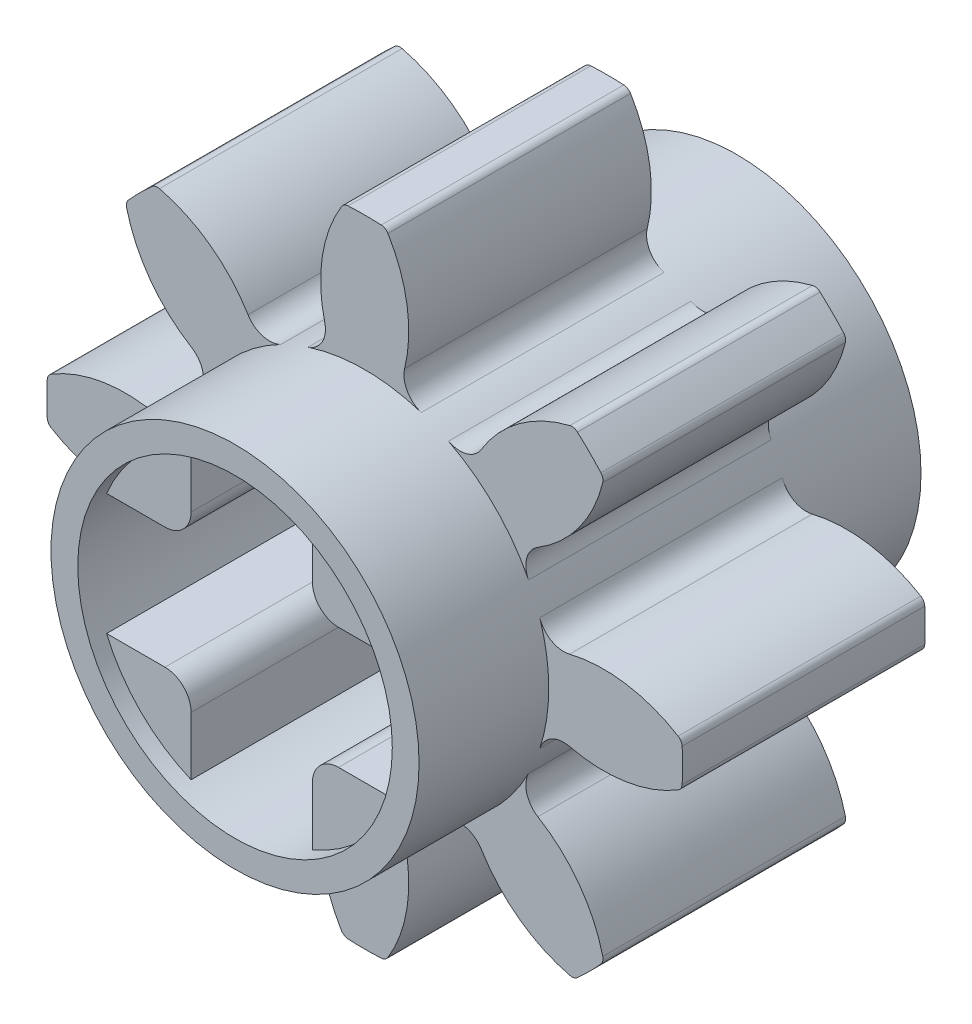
ISO-10303-21;
HEADER;
FILE_DESCRIPTION(('STEP AP214'),'2;1');
FILE_NAME('part.step','',(''),(''),'','','');
FILE_SCHEMA(('AUTOMOTIVE_DESIGN { 1 0 10303 214 1 1 1 1 }'));
ENDSEC;
DATA;
#1=APPLICATION_CONTEXT('core data for automotive mechanical design processes');
#2=APPLICATION_PROTOCOL_DEFINITION('international standard','automotive_design',2000,#1);
#3=PRODUCT_CONTEXT('',#1,'mechanical');
#4=PRODUCT('Part','Part','',(#3));
#5=PRODUCT_RELATED_PRODUCT_CATEGORY('part','',(#4));
#6=PRODUCT_DEFINITION_FORMATION('','',#4);
#7=PRODUCT_DEFINITION_CONTEXT('part definition',#1,'design');
#8=PRODUCT_DEFINITION('design','',#6,#7);
#9=PRODUCT_DEFINITION_SHAPE('','',#8);
#10=(LENGTH_UNIT() NAMED_UNIT(*) SI_UNIT(.MILLI.,.METRE.));
#11=(NAMED_UNIT(*) PLANE_ANGLE_UNIT() SI_UNIT($,.RADIAN.));
#12=(NAMED_UNIT(*) SI_UNIT($,.STERADIAN.) SOLID_ANGLE_UNIT());
#13=UNCERTAINTY_MEASURE_WITH_UNIT(LENGTH_MEASURE(1.E-05),#10,'distance_accuracy_value','');
#14=(GEOMETRIC_REPRESENTATION_CONTEXT(3) GLOBAL_UNCERTAINTY_ASSIGNED_CONTEXT((#13)) GLOBAL_UNIT_ASSIGNED_CONTEXT((#10,
#11,#12)) REPRESENTATION_CONTEXT('',''));
#15=CARTESIAN_POINT('',(0.,0.,0.));
#16=DIRECTION('',(0.,0.,1.));
#17=DIRECTION('',(1.,0.,0.));
#18=AXIS2_PLACEMENT_3D('',#15,#16,#17);
#19=CARTESIAN_POINT('',(0.92075,-0.92075,3.81));
#20=DIRECTION('',(0.,1.,0.));
#21=DIRECTION('',(0.,0.,1.));
#22=AXIS2_PLACEMENT_3D('',#19,#20,#21);
#23=PLANE('',#22);
#24=DIRECTION('',(0.,0.,-1.));
#25=VECTOR('',#24,1.);
#26=CARTESIAN_POINT('',(1.317625,-0.92075,3.81));
#27=LINE('',#26,#25);
#28=CARTESIAN_POINT('',(1.317625,-0.92075,-3.556));
#29=VERTEX_POINT('',#28);
#30=CARTESIAN_POINT('',(1.317625,-0.92075,3.556));
#31=VERTEX_POINT('',#30);
#32=EDGE_CURVE('E1077',#29,#31,#27,.F.);
#33=ORIENTED_EDGE('',*,*,#32,.T.);
#34=DIRECTION('',(1.,0.,0.));
#35=VECTOR('',#34,1.);
#36=CARTESIAN_POINT('',(0.92075,-0.92075,3.556));
#37=LINE('',#36,#35);
#38=CARTESIAN_POINT('',(2.20291924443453,-0.92075,3.556));
#39=VERTEX_POINT('',#38);
#40=EDGE_CURVE('E1124',#31,#39,#37,.T.);
#41=ORIENTED_EDGE('',*,*,#40,.T.);
#42=DIRECTION('',(0.,0.,-1.));
#43=VECTOR('',#42,1.);
#44=CARTESIAN_POINT('',(2.20291924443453,-0.92075,3.81));
#45=LINE('',#44,#43);
#46=CARTESIAN_POINT('',(2.20291924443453,-0.92075,-3.556));
#47=VERTEX_POINT('',#46);
#48=EDGE_CURVE('E581',#39,#47,#45,.T.);
#49=ORIENTED_EDGE('',*,*,#48,.T.);
#50=DIRECTION('',(-1.,0.,0.));
#51=VECTOR('',#50,1.);
#52=CARTESIAN_POINT('',(0.92075,-0.92075,-3.556));
#53=LINE('',#52,#51);
#54=EDGE_CURVE('E565',#47,#29,#53,.T.);
#55=ORIENTED_EDGE('',*,*,#54,.T.);
#56=EDGE_LOOP('',(#33,#41,#49,#55));
#57=FACE_BOUND('',#56,.T.);
#58=ADVANCED_FACE('F38',(#57),#23,.T.);
#59=CARTESIAN_POINT('',(0.92075,-2.20291924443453,3.81));
#60=DIRECTION('',(-1.,0.,0.));
#61=DIRECTION('',(0.,0.,1.));
#62=AXIS2_PLACEMENT_3D('',#59,#60,#61);
#63=PLANE('',#62);
#64=DIRECTION('',(0.,0.,-1.));
#65=VECTOR('',#64,1.);
#66=CARTESIAN_POINT('',(0.92075,-2.20291924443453,3.81));
#67=LINE('',#66,#65);
#68=CARTESIAN_POINT('',(0.92075,-2.20291924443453,3.556));
#69=VERTEX_POINT('',#68);
#70=CARTESIAN_POINT('',(0.92075,-2.20291924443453,-3.556));
#71=VERTEX_POINT('',#70);
#72=EDGE_CURVE('E579',#69,#71,#67,.T.);
#73=ORIENTED_EDGE('',*,*,#72,.F.);
#74=DIRECTION('',(0.,1.,0.));
#75=VECTOR('',#74,1.);
#76=CARTESIAN_POINT('',(0.92075,-2.20291924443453,3.556));
#77=LINE('',#76,#75);
#78=CARTESIAN_POINT('',(0.92075,-1.317625,3.556));
#79=VERTEX_POINT('',#78);
#80=EDGE_CURVE('E1122',#69,#79,#77,.T.);
#81=ORIENTED_EDGE('',*,*,#80,.T.);
#82=DIRECTION('',(0.,0.,-1.));
#83=VECTOR('',#82,1.);
#84=CARTESIAN_POINT('',(0.92075,-1.317625,3.81));
#85=LINE('',#84,#83);
#86=CARTESIAN_POINT('',(0.92075,-1.317625,-3.556));
#87=VERTEX_POINT('',#86);
#88=EDGE_CURVE('E53',#79,#87,#85,.T.);
#89=ORIENTED_EDGE('',*,*,#88,.T.);
#90=DIRECTION('',(0.,-1.,0.));
#91=VECTOR('',#90,1.);
#92=CARTESIAN_POINT('',(0.92075,-2.20291924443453,-3.556));
#93=LINE('',#92,#91);
#94=EDGE_CURVE('E570',#87,#71,#93,.T.);
#95=ORIENTED_EDGE('',*,*,#94,.T.);
#96=EDGE_LOOP('',(#73,#81,#89,#95));
#97=FACE_BOUND('',#96,.T.);
#98=ADVANCED_FACE('F1155',(#97),#63,.T.);
#99=CARTESIAN_POINT('',(1.317625,-1.317625,3.81));
#100=DIRECTION('',(0.,0.,-1.));
#101=DIRECTION('',(-1.,0.,0.));
#102=AXIS2_PLACEMENT_3D('',#99,#100,#101);
#103=CYLINDRICAL_SURFACE('',#102,0.396875);
#104=ORIENTED_EDGE('',*,*,#88,.F.);
#105=CARTESIAN_POINT('',(1.317625,-1.317625,3.556));
#106=DIRECTION('',(0.,0.,1.));
#107=DIRECTION('',(1.,0.,0.));
#108=AXIS2_PLACEMENT_3D('',#105,#106,#107);
#109=CIRCLE('',#108,0.396875);
#110=EDGE_CURVE('E1119',#79,#31,#109,.F.);
#111=ORIENTED_EDGE('',*,*,#110,.T.);
#112=ORIENTED_EDGE('',*,*,#32,.F.);
#113=CARTESIAN_POINT('',(1.317625,-1.317625,-3.556));
#114=DIRECTION('',(0.,0.,-1.));
#115=DIRECTION('',(-1.,0.,0.));
#116=AXIS2_PLACEMENT_3D('',#113,#114,#115);
#117=CIRCLE('',#116,0.396875);
#118=EDGE_CURVE('E1151',#29,#87,#117,.F.);
#119=ORIENTED_EDGE('',*,*,#118,.T.);
#120=EDGE_LOOP('',(#104,#111,#112,#119));
#121=FACE_BOUND('',#120,.T.);
#122=ADVANCED_FACE('F1164',(#121),#103,.T.);
#123=CARTESIAN_POINT('',(-0.920750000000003,-0.920749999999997,3.81));
#124=DIRECTION('',(1.,0.,0.));
#125=DIRECTION('',(0.,1.,0.));
#126=AXIS2_PLACEMENT_3D('',#123,#124,#125);
#127=PLANE('',#126);
#128=DIRECTION('',(0.,0.,-1.));
#129=VECTOR('',#128,1.);
#130=CARTESIAN_POINT('',(-0.920750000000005,-1.317625,3.81));
#131=LINE('',#130,#129);
#132=CARTESIAN_POINT('',(-0.920750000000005,-1.317625,-3.556));
#133=VERTEX_POINT('',#132);
#134=CARTESIAN_POINT('',(-0.920750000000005,-1.317625,3.556));
#135=VERTEX_POINT('',#134);
#136=EDGE_CURVE('E1081',#133,#135,#131,.F.);
#137=ORIENTED_EDGE('',*,*,#136,.T.);
#138=DIRECTION('',(0.,-1.,0.));
#139=VECTOR('',#138,1.);
#140=CARTESIAN_POINT('',(-0.920750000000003,-0.920749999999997,3.556));
#141=LINE('',#140,#139);
#142=CARTESIAN_POINT('',(-0.920750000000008,-2.20291924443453,3.556));
#143=VERTEX_POINT('',#142);
#144=EDGE_CURVE('E1116',#135,#143,#141,.T.);
#145=ORIENTED_EDGE('',*,*,#144,.T.);
#146=DIRECTION('',(0.,0.,-1.));
#147=VECTOR('',#146,1.);
#148=CARTESIAN_POINT('',(-0.920750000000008,-2.20291924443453,3.81));
#149=LINE('',#148,#147);
#150=CARTESIAN_POINT('',(-0.920750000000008,-2.20291924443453,-3.556));
#151=VERTEX_POINT('',#150);
#152=EDGE_CURVE('E577',#143,#151,#149,.T.);
#153=ORIENTED_EDGE('',*,*,#152,.T.);
#154=DIRECTION('',(0.,1.,0.));
#155=VECTOR('',#154,1.);
#156=CARTESIAN_POINT('',(-0.920750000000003,-0.920749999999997,-3.556));
#157=LINE('',#156,#155);
#158=EDGE_CURVE('E1148',#151,#133,#157,.T.);
#159=ORIENTED_EDGE('',*,*,#158,.T.);
#160=EDGE_LOOP('',(#137,#145,#153,#159));
#161=FACE_BOUND('',#160,.T.);
#162=ADVANCED_FACE('F1707',(#161),#127,.T.);
#163=CARTESIAN_POINT('',(-2.20291924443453,-0.920749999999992,3.81));
#164=DIRECTION('',(0.,1.,0.));
#165=DIRECTION('',(-1.,0.,0.));
#166=AXIS2_PLACEMENT_3D('',#163,#164,#165);
#167=PLANE('',#166);
#168=DIRECTION('',(0.,0.,-1.));
#169=VECTOR('',#168,1.);
#170=CARTESIAN_POINT('',(-2.20291924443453,-0.920749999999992,3.81));
#171=LINE('',#170,#169);
#172=CARTESIAN_POINT('',(-2.20291924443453,-0.920749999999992,3.556));
#173=VERTEX_POINT('',#172);
#174=CARTESIAN_POINT('',(-2.20291924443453,-0.920749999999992,-3.556));
#175=VERTEX_POINT('',#174);
#176=EDGE_CURVE('E575',#173,#175,#171,.T.);
#177=ORIENTED_EDGE('',*,*,#176,.F.);
#178=DIRECTION('',(1.,0.,0.));
#179=VECTOR('',#178,1.);
#180=CARTESIAN_POINT('',(-2.20291924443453,-0.920749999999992,3.556));
#181=LINE('',#180,#179);
#182=CARTESIAN_POINT('',(-1.317625,-0.920749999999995,3.556));
#183=VERTEX_POINT('',#182);
#184=EDGE_CURVE('E1114',#173,#183,#181,.T.);
#185=ORIENTED_EDGE('',*,*,#184,.T.);
#186=DIRECTION('',(0.,0.,-1.));
#187=VECTOR('',#186,1.);
#188=CARTESIAN_POINT('',(-1.317625,-0.920749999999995,3.81));
#189=LINE('',#188,#187);
#190=CARTESIAN_POINT('',(-1.317625,-0.920749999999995,-3.556));
#191=VERTEX_POINT('',#190);
#192=EDGE_CURVE('E61',#183,#191,#189,.T.);
#193=ORIENTED_EDGE('',*,*,#192,.T.);
#194=DIRECTION('',(-1.,0.,0.));
#195=VECTOR('',#194,1.);
#196=CARTESIAN_POINT('',(-2.20291924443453,-0.920749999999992,-3.556));
#197=LINE('',#196,#195);
#198=EDGE_CURVE('E1146',#191,#175,#197,.T.);
#199=ORIENTED_EDGE('',*,*,#198,.T.);
#200=EDGE_LOOP('',(#177,#185,#193,#199));
#201=FACE_BOUND('',#200,.T.);
#202=ADVANCED_FACE('F1177',(#201),#167,.T.);
#203=CARTESIAN_POINT('',(-0.920749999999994,0.920750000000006,3.81));
#204=DIRECTION('',(0.,-1.,0.));
#205=DIRECTION('',(1.,0.,0.));
#206=AXIS2_PLACEMENT_3D('',#203,#204,#205);
#207=PLANE('',#206);
#208=DIRECTION('',(0.,0.,-1.));
#209=VECTOR('',#208,1.);
#210=CARTESIAN_POINT('',(-1.31762499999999,0.920750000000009,3.81));
#211=LINE('',#210,#209);
#212=CARTESIAN_POINT('',(-1.31762499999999,0.920750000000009,-3.556));
#213=VERTEX_POINT('',#212);
#214=CARTESIAN_POINT('',(-1.31762499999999,0.920750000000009,3.556));
#215=VERTEX_POINT('',#214);
#216=EDGE_CURVE('E1086',#213,#215,#211,.F.);
#217=ORIENTED_EDGE('',*,*,#216,.T.);
#218=DIRECTION('',(-1.,0.,0.));
#219=VECTOR('',#218,1.);
#220=CARTESIAN_POINT('',(-0.920749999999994,0.920750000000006,3.556));
#221=LINE('',#220,#219);
#222=CARTESIAN_POINT('',(-2.20291924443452,0.920750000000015,3.556));
#223=VERTEX_POINT('',#222);
#224=EDGE_CURVE('E1108',#215,#223,#221,.T.);
#225=ORIENTED_EDGE('',*,*,#224,.T.);
#226=DIRECTION('',(0.,0.,-1.));
#227=VECTOR('',#226,1.);
#228=CARTESIAN_POINT('',(-2.20291924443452,0.920750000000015,3.81));
#229=LINE('',#228,#227);
#230=CARTESIAN_POINT('',(-2.20291924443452,0.920750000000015,-3.556));
#231=VERTEX_POINT('',#230);
#232=EDGE_CURVE('E573',#223,#231,#229,.T.);
#233=ORIENTED_EDGE('',*,*,#232,.T.);
#234=DIRECTION('',(1.,0.,0.));
#235=VECTOR('',#234,1.);
#236=CARTESIAN_POINT('',(-0.920749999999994,0.920750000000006,-3.556));
#237=LINE('',#236,#235);
#238=EDGE_CURVE('E1140',#231,#213,#237,.T.);
#239=ORIENTED_EDGE('',*,*,#238,.T.);
#240=EDGE_LOOP('',(#217,#225,#233,#239));
#241=FACE_BOUND('',#240,.T.);
#242=ADVANCED_FACE('F1700',(#241),#207,.T.);
#243=CARTESIAN_POINT('',(-0.920749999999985,2.20291924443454,3.81));
#244=DIRECTION('',(1.,0.,0.));
#245=DIRECTION('',(0.,1.,0.));
#246=AXIS2_PLACEMENT_3D('',#243,#244,#245);
#247=PLANE('',#246);
#248=DIRECTION('',(0.,0.,-1.));
#249=VECTOR('',#248,1.);
#250=CARTESIAN_POINT('',(-0.920749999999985,2.20291924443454,3.81));
#251=LINE('',#250,#249);
#252=CARTESIAN_POINT('',(-0.920749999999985,2.20291924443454,3.556));
#253=VERTEX_POINT('',#252);
#254=CARTESIAN_POINT('',(-0.920749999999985,2.20291924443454,-3.556));
#255=VERTEX_POINT('',#254);
#256=EDGE_CURVE('E567',#253,#255,#251,.T.);
#257=ORIENTED_EDGE('',*,*,#256,.F.);
#258=DIRECTION('',(0.,-1.,0.));
#259=VECTOR('',#258,1.);
#260=CARTESIAN_POINT('',(-0.920749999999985,2.20291924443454,3.556));
#261=LINE('',#260,#259);
#262=CARTESIAN_POINT('',(-0.920749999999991,1.31762500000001,3.556));
#263=VERTEX_POINT('',#262);
#264=EDGE_CURVE('E1105',#253,#263,#261,.T.);
#265=ORIENTED_EDGE('',*,*,#264,.T.);
#266=DIRECTION('',(0.,0.,-1.));
#267=VECTOR('',#266,1.);
#268=CARTESIAN_POINT('',(-0.920749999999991,1.31762500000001,3.81));
#269=LINE('',#268,#267);
#270=CARTESIAN_POINT('',(-0.920749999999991,1.31762500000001,-3.556));
#271=VERTEX_POINT('',#270);
#272=EDGE_CURVE('E1084',#263,#271,#269,.T.);
#273=ORIENTED_EDGE('',*,*,#272,.T.);
#274=DIRECTION('',(0.,1.,0.));
#275=VECTOR('',#274,1.);
#276=CARTESIAN_POINT('',(-0.920749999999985,2.20291924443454,-3.556));
#277=LINE('',#276,#275);
#278=EDGE_CURVE('E1137',#271,#255,#277,.T.);
#279=ORIENTED_EDGE('',*,*,#278,.T.);
#280=EDGE_LOOP('',(#257,#265,#273,#279));
#281=FACE_BOUND('',#280,.T.);
#282=ADVANCED_FACE('F1697',(#281),#247,.T.);
#283=CARTESIAN_POINT('',(0.92075000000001,0.92074999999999,3.81));
#284=DIRECTION('',(-1.,0.,0.));
#285=DIRECTION('',(0.,-1.,0.));
#286=AXIS2_PLACEMENT_3D('',#283,#284,#285);
#287=PLANE('',#286);
#288=DIRECTION('',(0.,0.,-1.));
#289=VECTOR('',#288,1.);
#290=CARTESIAN_POINT('',(0.920750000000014,1.31762499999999,3.81));
#291=LINE('',#290,#289);
#292=CARTESIAN_POINT('',(0.920750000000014,1.31762499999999,-3.556));
#293=VERTEX_POINT('',#292);
#294=CARTESIAN_POINT('',(0.920750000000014,1.31762499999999,3.556));
#295=VERTEX_POINT('',#294);
#296=EDGE_CURVE('E46',#293,#295,#291,.F.);
#297=ORIENTED_EDGE('',*,*,#296,.T.);
#298=DIRECTION('',(0.,1.,0.));
#299=VECTOR('',#298,1.);
#300=CARTESIAN_POINT('',(0.92075000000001,0.92074999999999,3.556));
#301=LINE('',#300,#299);
#302=CARTESIAN_POINT('',(0.920750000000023,2.20291924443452,3.556));
#303=VERTEX_POINT('',#302);
#304=EDGE_CURVE('E548',#295,#303,#301,.T.);
#305=ORIENTED_EDGE('',*,*,#304,.T.);
#306=DIRECTION('',(0.,0.,-1.));
#307=VECTOR('',#306,1.);
#308=CARTESIAN_POINT('',(0.920750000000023,2.20291924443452,3.81));
#309=LINE('',#308,#307);
#310=CARTESIAN_POINT('',(0.920750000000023,2.20291924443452,-3.556));
#311=VERTEX_POINT('',#310);
#312=EDGE_CURVE('E557',#303,#311,#309,.T.);
#313=ORIENTED_EDGE('',*,*,#312,.T.);
#314=DIRECTION('',(0.,-1.,0.));
#315=VECTOR('',#314,1.);
#316=CARTESIAN_POINT('',(0.92075000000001,0.92074999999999,-3.556));
#317=LINE('',#316,#315);
#318=EDGE_CURVE('E1096',#311,#293,#317,.T.);
#319=ORIENTED_EDGE('',*,*,#318,.T.);
#320=EDGE_LOOP('',(#297,#305,#313,#319));
#321=FACE_BOUND('',#320,.T.);
#322=ADVANCED_FACE('F1094',(#321),#287,.T.);
#323=CARTESIAN_POINT('',(2.20291924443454,0.920749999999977,3.81));
#324=DIRECTION('',(0.,-1.,0.));
#325=DIRECTION('',(1.,0.,0.));
#326=AXIS2_PLACEMENT_3D('',#323,#324,#325);
#327=PLANE('',#326);
#328=DIRECTION('',(0.,0.,-1.));
#329=VECTOR('',#328,1.);
#330=CARTESIAN_POINT('',(2.20291924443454,0.920749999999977,3.81));
#331=LINE('',#330,#329);
#332=CARTESIAN_POINT('',(2.20291924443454,0.920749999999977,3.556));
#333=VERTEX_POINT('',#332);
#334=CARTESIAN_POINT('',(2.20291924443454,0.920749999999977,-3.556));
#335=VERTEX_POINT('',#334);
#336=EDGE_CURVE('E555',#333,#335,#331,.T.);
#337=ORIENTED_EDGE('',*,*,#336,.F.);
#338=DIRECTION('',(-1.,0.,0.));
#339=VECTOR('',#338,1.);
#340=CARTESIAN_POINT('',(2.20291924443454,0.920749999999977,3.556));
#341=LINE('',#340,#339);
#342=CARTESIAN_POINT('',(1.31762500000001,0.920749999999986,3.556));
#343=VERTEX_POINT('',#342);
#344=EDGE_CURVE('E538',#333,#343,#341,.T.);
#345=ORIENTED_EDGE('',*,*,#344,.T.);
#346=DIRECTION('',(0.,0.,-1.));
#347=VECTOR('',#346,1.);
#348=CARTESIAN_POINT('',(1.31762500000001,0.920749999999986,3.81));
#349=LINE('',#348,#347);
#350=CARTESIAN_POINT('',(1.31762500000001,0.920749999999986,-3.556));
#351=VERTEX_POINT('',#350);
#352=EDGE_CURVE('E1089',#343,#351,#349,.T.);
#353=ORIENTED_EDGE('',*,*,#352,.T.);
#354=DIRECTION('',(1.,0.,0.));
#355=VECTOR('',#354,1.);
#356=CARTESIAN_POINT('',(2.20291924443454,0.920749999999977,-3.556));
#357=LINE('',#356,#355);
#358=EDGE_CURVE('E564',#351,#335,#357,.T.);
#359=ORIENTED_EDGE('',*,*,#358,.T.);
#360=EDGE_LOOP('',(#337,#345,#353,#359));
#361=FACE_BOUND('',#360,.T.);
#362=ADVANCED_FACE('F562',(#361),#327,.T.);
#363=CARTESIAN_POINT('',(-1.317625,-1.317625,3.81));
#364=DIRECTION('',(0.,0.,-1.));
#365=DIRECTION('',(-1.,0.,0.));
#366=AXIS2_PLACEMENT_3D('',#363,#364,#365);
#367=CYLINDRICAL_SURFACE('',#366,0.396875);
#368=ORIENTED_EDGE('',*,*,#192,.F.);
#369=CARTESIAN_POINT('',(-1.317625,-1.317625,3.556));
#370=DIRECTION('',(0.,0.,1.));
#371=DIRECTION('',(1.,0.,0.));
#372=AXIS2_PLACEMENT_3D('',#369,#370,#371);
#373=CIRCLE('',#372,0.396875);
#374=EDGE_CURVE('E1111',#183,#135,#373,.F.);
#375=ORIENTED_EDGE('',*,*,#374,.T.);
#376=ORIENTED_EDGE('',*,*,#136,.F.);
#377=CARTESIAN_POINT('',(-1.317625,-1.317625,-3.556));
#378=DIRECTION('',(0.,0.,-1.));
#379=DIRECTION('',(-1.,0.,0.));
#380=AXIS2_PLACEMENT_3D('',#377,#378,#379);
#381=CIRCLE('',#380,0.396875);
#382=EDGE_CURVE('E1143',#133,#191,#381,.F.);
#383=ORIENTED_EDGE('',*,*,#382,.T.);
#384=EDGE_LOOP('',(#368,#375,#376,#383));
#385=FACE_BOUND('',#384,.T.);
#386=ADVANCED_FACE('F1688',(#385),#367,.T.);
#387=CARTESIAN_POINT('',(-1.31762499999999,1.31762500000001,3.81));
#388=DIRECTION('',(0.,0.,-1.));
#389=DIRECTION('',(-1.,0.,0.));
#390=AXIS2_PLACEMENT_3D('',#387,#388,#389);
#391=CYLINDRICAL_SURFACE('',#390,0.396875);
#392=ORIENTED_EDGE('',*,*,#272,.F.);
#393=CARTESIAN_POINT('',(-1.31762499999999,1.31762500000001,3.556));
#394=DIRECTION('',(0.,0.,1.));
#395=DIRECTION('',(1.,0.,0.));
#396=AXIS2_PLACEMENT_3D('',#393,#394,#395);
#397=CIRCLE('',#396,0.396875);
#398=EDGE_CURVE('E1102',#263,#215,#397,.F.);
#399=ORIENTED_EDGE('',*,*,#398,.T.);
#400=ORIENTED_EDGE('',*,*,#216,.F.);
#401=CARTESIAN_POINT('',(-1.31762499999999,1.31762500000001,-3.556));
#402=DIRECTION('',(0.,0.,-1.));
#403=DIRECTION('',(-1.,0.,0.));
#404=AXIS2_PLACEMENT_3D('',#401,#402,#403);
#405=CIRCLE('',#404,0.396875);
#406=EDGE_CURVE('E1134',#213,#271,#405,.F.);
#407=ORIENTED_EDGE('',*,*,#406,.T.);
#408=EDGE_LOOP('',(#392,#399,#400,#407));
#409=FACE_BOUND('',#408,.T.);
#410=ADVANCED_FACE('F1516',(#409),#391,.T.);
#411=CARTESIAN_POINT('',(1.31762500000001,1.31762499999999,3.81));
#412=DIRECTION('',(0.,0.,-1.));
#413=DIRECTION('',(-1.,0.,0.));
#414=AXIS2_PLACEMENT_3D('',#411,#412,#413);
#415=CYLINDRICAL_SURFACE('',#414,0.396875);
#416=ORIENTED_EDGE('',*,*,#352,.F.);
#417=CARTESIAN_POINT('',(1.31762500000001,1.31762499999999,3.556));
#418=DIRECTION('',(0.,0.,1.));
#419=DIRECTION('',(1.,0.,0.));
#420=AXIS2_PLACEMENT_3D('',#417,#418,#419);
#421=CIRCLE('',#420,0.396875);
#422=EDGE_CURVE('E544',#343,#295,#421,.F.);
#423=ORIENTED_EDGE('',*,*,#422,.T.);
#424=ORIENTED_EDGE('',*,*,#296,.F.);
#425=CARTESIAN_POINT('',(1.31762500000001,1.31762499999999,-3.556));
#426=DIRECTION('',(0.,0.,-1.));
#427=DIRECTION('',(-1.,0.,0.));
#428=AXIS2_PLACEMENT_3D('',#425,#426,#427);
#429=CIRCLE('',#428,0.396875);
#430=EDGE_CURVE('E11',#293,#351,#429,.F.);
#431=ORIENTED_EDGE('',*,*,#430,.T.);
#432=EDGE_LOOP('',(#416,#423,#424,#431));
#433=FACE_BOUND('',#432,.T.);
#434=ADVANCED_FACE('F1098',(#433),#415,.T.);
#435=CARTESIAN_POINT('',(0.,0.,3.81));
#436=DIRECTION('',(0.,0.,-1.));
#437=DIRECTION('',(-1.,0.,0.));
#438=AXIS2_PLACEMENT_3D('',#435,#436,#437);
#439=CYLINDRICAL_SURFACE('',#438,2.794);
#440=DIRECTION('',(0.,0.,-1.));
#441=VECTOR('',#440,1.);
#442=CARTESIAN_POINT('',(-2.4877726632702,1.27177953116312,3.81));
#443=LINE('',#442,#441);
#444=CARTESIAN_POINT('',(-2.4877726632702,1.27177953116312,1.8415));
#445=VERTEX_POINT('',#444);
#446=CARTESIAN_POINT('',(-2.4877726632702,1.27177953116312,-1.8415));
#447=VERTEX_POINT('',#446);
#448=EDGE_CURVE('E1058',#445,#447,#443,.T.);
#449=ORIENTED_EDGE('',*,*,#448,.T.);
#450=CARTESIAN_POINT('',(0.,0.,-1.8415));
#451=DIRECTION('',(0.,0.,1.));
#452=DIRECTION('',(0.707106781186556,0.707106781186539,0.));
#453=AXIS2_PLACEMENT_3D('',#450,#451,#452);
#454=CIRCLE('',#453,2.794);
#455=CARTESIAN_POINT('',(-1.27177953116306,2.48777266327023,-1.8415));
#456=VERTEX_POINT('',#455);
#457=EDGE_CURVE('E590',#456,#447,#454,.T.);
#458=ORIENTED_EDGE('',*,*,#457,.F.);
#459=DIRECTION('',(0.,0.,-1.));
#460=VECTOR('',#459,1.);
#461=CARTESIAN_POINT('',(-1.27177953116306,2.48777266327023,3.81));
#462=LINE('',#461,#460);
#463=CARTESIAN_POINT('',(-1.27177953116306,2.48777266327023,1.8415));
#464=VERTEX_POINT('',#463);
#465=EDGE_CURVE('E1055',#456,#464,#462,.F.);
#466=ORIENTED_EDGE('',*,*,#465,.T.);
#467=CARTESIAN_POINT('',(0.,0.,1.8415));
#468=DIRECTION('',(0.,0.,1.));
#469=DIRECTION('',(0.707106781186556,0.707106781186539,0.));
#470=AXIS2_PLACEMENT_3D('',#467,#468,#469);
#471=CIRCLE('',#470,2.794);
#472=EDGE_CURVE('E599',#464,#445,#471,.T.);
#473=ORIENTED_EDGE('',*,*,#472,.T.);
#474=EDGE_LOOP('',(#449,#458,#466,#473));
#475=FACE_BOUND('',#474,.T.);
#476=DIRECTION('',(0.,0.,-1.));
#477=VECTOR('',#476,1.);
#478=CARTESIAN_POINT('',(-2.65840485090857,-0.859836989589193,3.81));
#479=LINE('',#478,#477);
#480=CARTESIAN_POINT('',(-2.65840485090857,-0.859836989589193,1.8415));
#481=VERTEX_POINT('',#480);
#482=CARTESIAN_POINT('',(-2.65840485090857,-0.859836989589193,-1.8415));
#483=VERTEX_POINT('',#482);
#484=EDGE_CURVE('E1037',#481,#483,#479,.T.);
#485=ORIENTED_EDGE('',*,*,#484,.T.);
#486=CARTESIAN_POINT('',(0.,0.,-1.8415));
#487=DIRECTION('',(0.,0.,1.));
#488=DIRECTION('',(0.,1.,0.));
#489=AXIS2_PLACEMENT_3D('',#486,#487,#488);
#490=CIRCLE('',#489,2.794);
#491=CARTESIAN_POINT('',(-2.65840485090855,0.859836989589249,-1.8415));
#492=VERTEX_POINT('',#491);
#493=EDGE_CURVE('E608',#492,#483,#490,.T.);
#494=ORIENTED_EDGE('',*,*,#493,.F.);
#495=DIRECTION('',(0.,0.,-1.));
#496=VECTOR('',#495,1.);
#497=CARTESIAN_POINT('',(-2.65840485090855,0.859836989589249,3.81));
#498=LINE('',#497,#496);
#499=CARTESIAN_POINT('',(-2.65840485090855,0.859836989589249,1.8415));
#500=VERTEX_POINT('',#499);
#501=EDGE_CURVE('E1034',#492,#500,#498,.F.);
#502=ORIENTED_EDGE('',*,*,#501,.T.);
#503=CARTESIAN_POINT('',(0.,0.,1.8415));
#504=DIRECTION('',(0.,0.,1.));
#505=DIRECTION('',(0.,1.,0.));
#506=AXIS2_PLACEMENT_3D('',#503,#504,#505);
#507=CIRCLE('',#506,2.794);
#508=EDGE_CURVE('E617',#500,#481,#507,.T.);
#509=ORIENTED_EDGE('',*,*,#508,.T.);
#510=EDGE_LOOP('',(#485,#494,#502,#509));
#511=FACE_BOUND('',#510,.T.);
#512=DIRECTION('',(0.,0.,-1.));
#513=VECTOR('',#512,1.);
#514=CARTESIAN_POINT('',(-1.27177953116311,-2.48777266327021,3.81));
#515=LINE('',#514,#513);
#516=CARTESIAN_POINT('',(-1.27177953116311,-2.48777266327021,1.8415));
#517=VERTEX_POINT('',#516);
#518=CARTESIAN_POINT('',(-1.27177953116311,-2.48777266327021,-1.8415));
#519=VERTEX_POINT('',#518);
#520=EDGE_CURVE('E1016',#517,#519,#515,.T.);
#521=ORIENTED_EDGE('',*,*,#520,.T.);
#522=CARTESIAN_POINT('',(0.,0.,-1.8415));
#523=DIRECTION('',(0.,0.,1.));
#524=DIRECTION('',(-0.707106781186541,0.707106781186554,0.));
#525=AXIS2_PLACEMENT_3D('',#522,#523,#524);
#526=CIRCLE('',#525,2.794);
#527=CARTESIAN_POINT('',(-2.48777266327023,-1.27177953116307,-1.8415));
#528=VERTEX_POINT('',#527);
#529=EDGE_CURVE('E626',#528,#519,#526,.T.);
#530=ORIENTED_EDGE('',*,*,#529,.F.);
#531=DIRECTION('',(0.,0.,-1.));
#532=VECTOR('',#531,1.);
#533=CARTESIAN_POINT('',(-2.48777266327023,-1.27177953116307,3.81));
#534=LINE('',#533,#532);
#535=CARTESIAN_POINT('',(-2.48777266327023,-1.27177953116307,1.8415));
#536=VERTEX_POINT('',#535);
#537=EDGE_CURVE('E1013',#528,#536,#534,.F.);
#538=ORIENTED_EDGE('',*,*,#537,.T.);
#539=CARTESIAN_POINT('',(0.,0.,1.8415));
#540=DIRECTION('',(0.,0.,1.));
#541=DIRECTION('',(-0.707106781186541,0.707106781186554,0.));
#542=AXIS2_PLACEMENT_3D('',#539,#540,#541);
#543=CIRCLE('',#542,2.794);
#544=EDGE_CURVE('E635',#536,#517,#543,.T.);
#545=ORIENTED_EDGE('',*,*,#544,.T.);
#546=EDGE_LOOP('',(#521,#530,#538,#545));
#547=FACE_BOUND('',#546,.T.);
#548=DIRECTION('',(0.,0.,-1.));
#549=VECTOR('',#548,1.);
#550=CARTESIAN_POINT('',(0.859836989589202,-2.65840485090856,3.81));
#551=LINE('',#550,#549);
#552=CARTESIAN_POINT('',(0.859836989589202,-2.65840485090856,1.8415));
#553=VERTEX_POINT('',#552);
#554=CARTESIAN_POINT('',(0.859836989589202,-2.65840485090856,-1.8415));
#555=VERTEX_POINT('',#554);
#556=EDGE_CURVE('E995',#553,#555,#551,.T.);
#557=ORIENTED_EDGE('',*,*,#556,.T.);
#558=CARTESIAN_POINT('',(0.,0.,-1.8415));
#559=DIRECTION('',(0.,0.,1.));
#560=DIRECTION('',(-1.,0.,0.));
#561=AXIS2_PLACEMENT_3D('',#558,#559,#560);
#562=CIRCLE('',#561,2.794);
#563=CARTESIAN_POINT('',(-0.859836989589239,-2.65840485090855,-1.8415));
#564=VERTEX_POINT('',#563);
#565=EDGE_CURVE('E644',#564,#555,#562,.T.);
#566=ORIENTED_EDGE('',*,*,#565,.F.);
#567=DIRECTION('',(0.,0.,-1.));
#568=VECTOR('',#567,1.);
#569=CARTESIAN_POINT('',(-0.859836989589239,-2.65840485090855,3.81));
#570=LINE('',#569,#568);
#571=CARTESIAN_POINT('',(-0.859836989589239,-2.65840485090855,1.8415));
#572=VERTEX_POINT('',#571);
#573=EDGE_CURVE('E992',#564,#572,#570,.F.);
#574=ORIENTED_EDGE('',*,*,#573,.T.);
#575=CARTESIAN_POINT('',(0.,0.,1.8415));
#576=DIRECTION('',(0.,0.,1.));
#577=DIRECTION('',(-1.,0.,0.));
#578=AXIS2_PLACEMENT_3D('',#575,#576,#577);
#579=CIRCLE('',#578,2.794);
#580=EDGE_CURVE('E653',#572,#553,#579,.T.);
#581=ORIENTED_EDGE('',*,*,#580,.T.);
#582=EDGE_LOOP('',(#557,#566,#574,#581));
#583=FACE_BOUND('',#582,.T.);
#584=DIRECTION('',(0.,0.,-1.));
#585=VECTOR('',#584,1.);
#586=CARTESIAN_POINT('',(2.48777266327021,-1.2717795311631,3.81));
#587=LINE('',#586,#585);
#588=CARTESIAN_POINT('',(2.48777266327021,-1.2717795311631,1.8415));
#589=VERTEX_POINT('',#588);
#590=CARTESIAN_POINT('',(2.48777266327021,-1.2717795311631,-1.8415));
#591=VERTEX_POINT('',#590);
#592=EDGE_CURVE('E974',#589,#591,#587,.T.);
#593=ORIENTED_EDGE('',*,*,#592,.T.);
#594=CARTESIAN_POINT('',(0.,0.,-1.8415));
#595=DIRECTION('',(0.,0.,1.));
#596=DIRECTION('',(-0.707106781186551,-0.707106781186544,0.));
#597=AXIS2_PLACEMENT_3D('',#594,#595,#596);
#598=CIRCLE('',#597,2.794);
#599=CARTESIAN_POINT('',(1.27177953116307,-2.48777266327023,-1.8415));
#600=VERTEX_POINT('',#599);
#601=EDGE_CURVE('E662',#600,#591,#598,.T.);
#602=ORIENTED_EDGE('',*,*,#601,.F.);
#603=DIRECTION('',(0.,0.,-1.));
#604=VECTOR('',#603,1.);
#605=CARTESIAN_POINT('',(1.27177953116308,-2.48777266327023,3.81));
#606=LINE('',#605,#604);
#607=CARTESIAN_POINT('',(1.27177953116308,-2.48777266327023,1.8415));
#608=VERTEX_POINT('',#607);
#609=EDGE_CURVE('E971',#600,#608,#606,.F.);
#610=ORIENTED_EDGE('',*,*,#609,.T.);
#611=CARTESIAN_POINT('',(0.,0.,1.8415));
#612=DIRECTION('',(0.,0.,1.));
#613=DIRECTION('',(-0.707106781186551,-0.707106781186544,0.));
#614=AXIS2_PLACEMENT_3D('',#611,#612,#613);
#615=CIRCLE('',#614,2.794);
#616=EDGE_CURVE('E671',#608,#589,#615,.T.);
#617=ORIENTED_EDGE('',*,*,#616,.T.);
#618=EDGE_LOOP('',(#593,#602,#610,#617));
#619=FACE_BOUND('',#618,.T.);
#620=DIRECTION('',(0.,0.,-1.));
#621=VECTOR('',#620,1.);
#622=CARTESIAN_POINT('',(2.65840485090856,0.859836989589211,3.81));
#623=LINE('',#622,#621);
#624=CARTESIAN_POINT('',(2.65840485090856,0.859836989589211,1.8415));
#625=VERTEX_POINT('',#624);
#626=CARTESIAN_POINT('',(2.65840485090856,0.859836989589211,-1.8415));
#627=VERTEX_POINT('',#626);
#628=EDGE_CURVE('E953',#625,#627,#623,.T.);
#629=ORIENTED_EDGE('',*,*,#628,.T.);
#630=CARTESIAN_POINT('',(0.,0.,-1.8415));
#631=DIRECTION('',(0.,0.,1.));
#632=DIRECTION('',(0.,-1.,0.));
#633=AXIS2_PLACEMENT_3D('',#630,#631,#632);
#634=CIRCLE('',#633,2.794);
#635=CARTESIAN_POINT('',(2.65840485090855,-0.85983698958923,-1.8415));
#636=VERTEX_POINT('',#635);
#637=EDGE_CURVE('E680',#636,#627,#634,.T.);
#638=ORIENTED_EDGE('',*,*,#637,.F.);
#639=DIRECTION('',(0.,0.,-1.));
#640=VECTOR('',#639,1.);
#641=CARTESIAN_POINT('',(2.65840485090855,-0.85983698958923,3.81));
#642=LINE('',#641,#640);
#643=CARTESIAN_POINT('',(2.65840485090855,-0.85983698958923,1.8415));
#644=VERTEX_POINT('',#643);
#645=EDGE_CURVE('E950',#636,#644,#642,.F.);
#646=ORIENTED_EDGE('',*,*,#645,.T.);
#647=CARTESIAN_POINT('',(0.,0.,1.8415));
#648=DIRECTION('',(0.,0.,1.));
#649=DIRECTION('',(0.,-1.,0.));
#650=AXIS2_PLACEMENT_3D('',#647,#648,#649);
#651=CIRCLE('',#650,2.794);
#652=EDGE_CURVE('E689',#644,#625,#651,.T.);
#653=ORIENTED_EDGE('',*,*,#652,.T.);
#654=EDGE_LOOP('',(#629,#638,#646,#653));
#655=FACE_BOUND('',#654,.T.);
#656=DIRECTION('',(0.,0.,-1.));
#657=VECTOR('',#656,1.);
#658=CARTESIAN_POINT('',(1.27177953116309,2.48777266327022,3.81));
#659=LINE('',#658,#657);
#660=CARTESIAN_POINT('',(1.27177953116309,2.48777266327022,1.8415));
#661=VERTEX_POINT('',#660);
#662=CARTESIAN_POINT('',(1.27177953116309,2.48777266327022,-1.8415));
#663=VERTEX_POINT('',#662);
#664=EDGE_CURVE('E932',#661,#663,#659,.T.);
#665=ORIENTED_EDGE('',*,*,#664,.T.);
#666=CARTESIAN_POINT('',(0.,0.,-1.8415));
#667=DIRECTION('',(0.,0.,1.));
#668=DIRECTION('',(0.707106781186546,-0.707106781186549,0.));
#669=AXIS2_PLACEMENT_3D('',#666,#667,#668);
#670=CIRCLE('',#669,2.794);
#671=CARTESIAN_POINT('',(2.48777266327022,1.27177953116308,-1.8415));
#672=VERTEX_POINT('',#671);
#673=EDGE_CURVE('E698',#672,#663,#670,.T.);
#674=ORIENTED_EDGE('',*,*,#673,.F.);
#675=DIRECTION('',(0.,0.,-1.));
#676=VECTOR('',#675,1.);
#677=CARTESIAN_POINT('',(2.48777266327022,1.27177953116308,3.81));
#678=LINE('',#677,#676);
#679=CARTESIAN_POINT('',(2.48777266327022,1.27177953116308,1.8415));
#680=VERTEX_POINT('',#679);
#681=EDGE_CURVE('E929',#672,#680,#678,.F.);
#682=ORIENTED_EDGE('',*,*,#681,.T.);
#683=CARTESIAN_POINT('',(0.,0.,1.8415));
#684=DIRECTION('',(0.,0.,1.));
#685=DIRECTION('',(0.707106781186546,-0.707106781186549,0.));
#686=AXIS2_PLACEMENT_3D('',#683,#684,#685);
#687=CIRCLE('',#686,2.794);
#688=EDGE_CURVE('E707',#680,#661,#687,.T.);
#689=ORIENTED_EDGE('',*,*,#688,.T.);
#690=EDGE_LOOP('',(#665,#674,#682,#689));
#691=FACE_BOUND('',#690,.T.);
#692=DIRECTION('',(0.,0.,-1.));
#693=VECTOR('',#692,1.);
#694=CARTESIAN_POINT('',(-0.85983698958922,2.65840485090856,3.81));
#695=LINE('',#694,#693);
#696=CARTESIAN_POINT('',(-0.85983698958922,2.65840485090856,1.8415));
#697=VERTEX_POINT('',#696);
#698=CARTESIAN_POINT('',(-0.85983698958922,2.65840485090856,-1.8415));
#699=VERTEX_POINT('',#698);
#700=EDGE_CURVE('E764',#697,#699,#695,.T.);
#701=ORIENTED_EDGE('',*,*,#700,.T.);
#702=CARTESIAN_POINT('',(0.,0.,-1.8415));
#703=DIRECTION('',(0.,0.,1.));
#704=DIRECTION('',(1.,0.,0.));
#705=AXIS2_PLACEMENT_3D('',#702,#703,#704);
#706=CIRCLE('',#705,2.794);
#707=CARTESIAN_POINT('',(0.859836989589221,2.65840485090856,-1.8415));
#708=VERTEX_POINT('',#707);
#709=EDGE_CURVE('E716',#708,#699,#706,.T.);
#710=ORIENTED_EDGE('',*,*,#709,.F.);
#711=DIRECTION('',(0.,0.,-1.));
#712=VECTOR('',#711,1.);
#713=CARTESIAN_POINT('',(0.859836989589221,2.65840485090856,3.81));
#714=LINE('',#713,#712);
#715=CARTESIAN_POINT('',(0.859836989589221,2.65840485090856,1.8415));
#716=VERTEX_POINT('',#715);
#717=EDGE_CURVE('E761',#708,#716,#714,.F.);
#718=ORIENTED_EDGE('',*,*,#717,.T.);
#719=CARTESIAN_POINT('',(0.,0.,1.8415));
#720=DIRECTION('',(0.,0.,1.));
#721=DIRECTION('',(1.,0.,0.));
#722=AXIS2_PLACEMENT_3D('',#719,#720,#721);
#723=CIRCLE('',#722,2.794);
#724=EDGE_CURVE('E725',#716,#697,#723,.T.);
#725=ORIENTED_EDGE('',*,*,#724,.T.);
#726=EDGE_LOOP('',(#701,#710,#718,#725));
#727=FACE_BOUND('',#726,.T.);
#728=CARTESIAN_POINT('',(0.,0.,3.81));
#729=DIRECTION('',(0.,0.,1.));
#730=DIRECTION('',(1.,0.,0.));
#731=AXIS2_PLACEMENT_3D('',#728,#729,#730);
#732=CIRCLE('',#731,2.794);
#733=CARTESIAN_POINT('',(2.794,0.,3.81));
#734=VERTEX_POINT('',#733);
#735=EDGE_CURVE('E737',#734,#734,#732,.T.);
#736=ORIENTED_EDGE('',*,*,#735,.F.);
#737=EDGE_LOOP('',(#736));
#738=FACE_BOUND('',#737,.T.);
#739=CARTESIAN_POINT('',(0.,0.,-3.81));
#740=DIRECTION('',(0.,0.,1.));
#741=DIRECTION('',(1.,0.,0.));
#742=AXIS2_PLACEMENT_3D('',#739,#740,#741);
#743=CIRCLE('',#742,2.794);
#744=CARTESIAN_POINT('',(2.794,0.,-3.81));
#745=VERTEX_POINT('',#744);
#746=EDGE_CURVE('E734',#745,#745,#743,.T.);
#747=ORIENTED_EDGE('',*,*,#746,.T.);
#748=EDGE_LOOP('',(#747));
#749=FACE_BOUND('',#748,.T.);
#750=ADVANCED_FACE('F40',(#475,#511,#547,#583,#619,#655,#691,#727,#738,#749),#439,.T.);
#751=CARTESIAN_POINT('',(0.,0.,3.81));
#752=DIRECTION('',(0.,0.,1.));
#753=DIRECTION('',(1.,0.,0.));
#754=AXIS2_PLACEMENT_3D('',#751,#752,#753);
#755=PLANE('',#754);
#756=CARTESIAN_POINT('',(0.,0.,3.81));
#757=DIRECTION('',(0.,0.,1.));
#758=DIRECTION('',(1.,0.,0.));
#759=AXIS2_PLACEMENT_3D('',#756,#757,#758);
#760=CIRCLE('',#759,2.3876);
#761=CARTESIAN_POINT('',(2.3876,0.,3.81));
#762=VERTEX_POINT('',#761);
#763=EDGE_CURVE('E583',#762,#762,#760,.T.);
#764=ORIENTED_EDGE('',*,*,#763,.F.);
#765=EDGE_LOOP('',(#764));
#766=FACE_BOUND('',#765,.T.);
#767=ORIENTED_EDGE('',*,*,#735,.T.);
#768=EDGE_LOOP('',(#767));
#769=FACE_BOUND('',#768,.T.);
#770=ADVANCED_FACE('F1496',(#766,#769),#755,.T.);
#771=CARTESIAN_POINT('',(0.,0.,-3.81));
#772=DIRECTION('',(0.,0.,1.));
#773=DIRECTION('',(1.,0.,0.));
#774=AXIS2_PLACEMENT_3D('',#771,#772,#773);
#775=PLANE('',#774);
#776=CARTESIAN_POINT('',(0.,0.,-3.81));
#777=DIRECTION('',(0.,0.,1.));
#778=DIRECTION('',(1.,0.,0.));
#779=AXIS2_PLACEMENT_3D('',#776,#777,#778);
#780=CIRCLE('',#779,2.3876);
#781=CARTESIAN_POINT('',(2.3876,0.,-3.81));
#782=VERTEX_POINT('',#781);
#783=EDGE_CURVE('E587',#782,#782,#780,.T.);
#784=ORIENTED_EDGE('',*,*,#783,.T.);
#785=EDGE_LOOP('',(#784));
#786=FACE_BOUND('',#785,.T.);
#787=ORIENTED_EDGE('',*,*,#746,.F.);
#788=EDGE_LOOP('',(#787));
#789=FACE_BOUND('',#788,.T.);
#790=ADVANCED_FACE('F1487',(#786,#789),#775,.F.);
#791=CARTESIAN_POINT('',(-1.51185175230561,3.62812657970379,1.8415));
#792=DIRECTION('',(0.,0.,-1.));
#793=DIRECTION('',(-1.,0.,0.));
#794=AXIS2_PLACEMENT_3D('',#791,#792,#793);
#795=CYLINDRICAL_SURFACE('',#794,2.18093772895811);
#796=CARTESIAN_POINT('',(-1.51185175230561,3.62812657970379,1.8415));
#797=DIRECTION('',(0.,0.,1.));
#798=DIRECTION('',(1.,0.,0.));
#799=AXIS2_PLACEMENT_3D('',#796,#797,#798);
#800=CIRCLE('',#799,2.18093772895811);
#801=CARTESIAN_POINT('',(0.606943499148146,3.11121647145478,1.8415));
#802=VERTEX_POINT('',#801);
#803=CARTESIAN_POINT('',(0.353321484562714,4.75844431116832,1.8415));
#804=VERTEX_POINT('',#803);
#805=EDGE_CURVE('E732',#802,#804,#800,.T.);
#806=ORIENTED_EDGE('',*,*,#805,.F.);
#807=DIRECTION('',(0.,0.,-1.));
#808=VECTOR('',#807,1.);
#809=CARTESIAN_POINT('',(0.606943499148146,3.11121647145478,1.8415));
#810=LINE('',#809,#808);
#811=CARTESIAN_POINT('',(0.606943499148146,3.11121647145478,-1.8415));
#812=VERTEX_POINT('',#811);
#813=EDGE_CURVE('E769',#802,#812,#810,.T.);
#814=ORIENTED_EDGE('',*,*,#813,.T.);
#815=CARTESIAN_POINT('',(-1.51185175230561,3.62812657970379,-1.8415));
#816=DIRECTION('',(0.,0.,1.));
#817=DIRECTION('',(1.,0.,0.));
#818=AXIS2_PLACEMENT_3D('',#815,#816,#817);
#819=CIRCLE('',#818,2.18093772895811);
#820=CARTESIAN_POINT('',(0.353321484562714,4.75844431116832,-1.8415));
#821=VERTEX_POINT('',#820);
#822=EDGE_CURVE('E723',#812,#821,#819,.T.);
#823=ORIENTED_EDGE('',*,*,#822,.T.);
#824=DIRECTION('',(0.,0.,-1.));
#825=VECTOR('',#824,1.);
#826=CARTESIAN_POINT('',(0.353321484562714,4.75844431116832,1.8415));
#827=LINE('',#826,#825);
#828=EDGE_CURVE('E750',#821,#804,#827,.F.);
#829=ORIENTED_EDGE('',*,*,#828,.T.);
#830=EDGE_LOOP('',(#806,#814,#823,#829));
#831=FACE_BOUND('',#830,.T.);
#832=ADVANCED_FACE('F1483',(#831),#795,.T.);
#833=CARTESIAN_POINT('',(0.,0.,1.8415));
#834=DIRECTION('',(0.,0.,-1.));
#835=DIRECTION('',(-1.,0.,0.));
#836=AXIS2_PLACEMENT_3D('',#833,#834,#835);
#837=CYLINDRICAL_SURFACE('',#836,4.826);
#838=CARTESIAN_POINT('',(0.,0.,1.8415));
#839=DIRECTION('',(0.,0.,1.));
#840=DIRECTION('',(1.,0.,0.));
#841=AXIS2_PLACEMENT_3D('',#838,#839,#840);
#842=CIRCLE('',#841,4.826);
#843=CARTESIAN_POINT('',(0.251322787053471,4.81945150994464,1.8415));
#844=VERTEX_POINT('',#843);
#845=CARTESIAN_POINT('',(-0.251322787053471,4.81945150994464,1.8415));
#846=VERTEX_POINT('',#845);
#847=EDGE_CURVE('E729',#844,#846,#842,.T.);
#848=ORIENTED_EDGE('',*,*,#847,.F.);
#849=DIRECTION('',(0.,0.,-1.));
#850=VECTOR('',#849,1.);
#851=CARTESIAN_POINT('',(0.251322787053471,4.81945150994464,1.8415));
#852=LINE('',#851,#850);
#853=CARTESIAN_POINT('',(0.251322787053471,4.81945150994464,-1.8415));
#854=VERTEX_POINT('',#853);
#855=EDGE_CURVE('E742',#844,#854,#852,.T.);
#856=ORIENTED_EDGE('',*,*,#855,.T.);
#857=CARTESIAN_POINT('',(0.,0.,-1.8415));
#858=DIRECTION('',(0.,0.,1.));
#859=DIRECTION('',(1.,0.,0.));
#860=AXIS2_PLACEMENT_3D('',#857,#858,#859);
#861=CIRCLE('',#860,4.826);
#862=CARTESIAN_POINT('',(-0.251322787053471,4.81945150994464,-1.8415));
#863=VERTEX_POINT('',#862);
#864=EDGE_CURVE('E720',#854,#863,#861,.T.);
#865=ORIENTED_EDGE('',*,*,#864,.T.);
#866=DIRECTION('',(0.,0.,-1.));
#867=VECTOR('',#866,1.);
#868=CARTESIAN_POINT('',(-0.251322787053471,4.81945150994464,1.8415));
#869=LINE('',#868,#867);
#870=EDGE_CURVE('E740',#863,#846,#869,.F.);
#871=ORIENTED_EDGE('',*,*,#870,.T.);
#872=EDGE_LOOP('',(#848,#856,#865,#871));
#873=FACE_BOUND('',#872,.T.);
#874=ADVANCED_FACE('F1486',(#873),#837,.T.);
#875=CARTESIAN_POINT('',(1.51185175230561,3.62812657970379,1.8415));
#876=DIRECTION('',(0.,0.,-1.));
#877=DIRECTION('',(-1.,0.,0.));
#878=AXIS2_PLACEMENT_3D('',#875,#876,#877);
#879=CYLINDRICAL_SURFACE('',#878,2.18093772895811);
#880=CARTESIAN_POINT('',(1.51185175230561,3.62812657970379,-1.8415));
#881=DIRECTION('',(0.,0.,-1.));
#882=DIRECTION('',(-1.,0.,0.));
#883=AXIS2_PLACEMENT_3D('',#880,#881,#882);
#884=CIRCLE('',#883,2.18093772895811);
#885=CARTESIAN_POINT('',(-0.606943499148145,3.11121647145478,-1.8415));
#886=VERTEX_POINT('',#885);
#887=CARTESIAN_POINT('',(-0.353321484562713,4.75844431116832,-1.8415));
#888=VERTEX_POINT('',#887);
#889=EDGE_CURVE('E718',#886,#888,#884,.T.);
#890=ORIENTED_EDGE('',*,*,#889,.F.);
#891=DIRECTION('',(0.,0.,-1.));
#892=VECTOR('',#891,1.);
#893=CARTESIAN_POINT('',(-0.606943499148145,3.11121647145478,1.8415));
#894=LINE('',#893,#892);
#895=CARTESIAN_POINT('',(-0.606943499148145,3.11121647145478,1.8415));
#896=VERTEX_POINT('',#895);
#897=EDGE_CURVE('E767',#886,#896,#894,.F.);
#898=ORIENTED_EDGE('',*,*,#897,.T.);
#899=CARTESIAN_POINT('',(1.51185175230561,3.62812657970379,1.8415));
#900=DIRECTION('',(0.,0.,-1.));
#901=DIRECTION('',(-1.,0.,0.));
#902=AXIS2_PLACEMENT_3D('',#899,#900,#901);
#903=CIRCLE('',#902,2.18093772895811);
#904=CARTESIAN_POINT('',(-0.353321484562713,4.75844431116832,1.8415));
#905=VERTEX_POINT('',#904);
#906=EDGE_CURVE('E727',#896,#905,#903,.T.);
#907=ORIENTED_EDGE('',*,*,#906,.T.);
#908=DIRECTION('',(0.,0.,-1.));
#909=VECTOR('',#908,1.);
#910=CARTESIAN_POINT('',(-0.353321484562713,4.75844431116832,1.8415));
#911=LINE('',#910,#909);
#912=EDGE_CURVE('E758',#905,#888,#911,.T.);
#913=ORIENTED_EDGE('',*,*,#912,.T.);
#914=EDGE_LOOP('',(#890,#898,#907,#913));
#915=FACE_BOUND('',#914,.T.);
#916=ADVANCED_FACE('F1481',(#915),#879,.T.);
#917=CARTESIAN_POINT('',(0.755925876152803,1.81406328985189,1.8415));
#918=DIRECTION('',(0.,0.,1.));
#919=DIRECTION('',(1.,0.,0.));
#920=AXIS2_PLACEMENT_3D('',#917,#918,#919);
#921=PLANE('',#920);
#922=ORIENTED_EDGE('',*,*,#724,.F.);
#923=CARTESIAN_POINT('',(0.977087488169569,3.02091460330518,1.8415));
#924=DIRECTION('',(0.,0.,1.));
#925=DIRECTION('',(1.,0.,0.));
#926=AXIS2_PLACEMENT_3D('',#923,#924,#925);
#927=CIRCLE('',#926,0.381);
#928=EDGE_CURVE('E780',#716,#802,#927,.F.);
#929=ORIENTED_EDGE('',*,*,#928,.T.);
#930=ORIENTED_EDGE('',*,*,#805,.T.);
#931=CARTESIAN_POINT('',(0.244709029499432,4.69262383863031,1.8415));
#932=DIRECTION('',(0.,0.,1.));
#933=DIRECTION('',(1.,0.,0.));
#934=AXIS2_PLACEMENT_3D('',#931,#932,#933);
#935=CIRCLE('',#934,0.127);
#936=EDGE_CURVE('E756',#804,#844,#935,.T.);
#937=ORIENTED_EDGE('',*,*,#936,.T.);
#938=ORIENTED_EDGE('',*,*,#847,.T.);
#939=CARTESIAN_POINT('',(-0.244709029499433,4.69262383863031,1.8415));
#940=DIRECTION('',(0.,0.,1.));
#941=DIRECTION('',(1.,0.,0.));
#942=AXIS2_PLACEMENT_3D('',#939,#940,#941);
#943=CIRCLE('',#942,0.127);
#944=EDGE_CURVE('E753',#846,#905,#943,.T.);
#945=ORIENTED_EDGE('',*,*,#944,.T.);
#946=ORIENTED_EDGE('',*,*,#906,.F.);
#947=CARTESIAN_POINT('',(-0.977087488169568,3.02091460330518,1.8415));
#948=DIRECTION('',(0.,0.,1.));
#949=DIRECTION('',(1.,0.,0.));
#950=AXIS2_PLACEMENT_3D('',#947,#948,#949);
#951=CIRCLE('',#950,0.381);
#952=EDGE_CURVE('E774',#896,#697,#951,.F.);
#953=ORIENTED_EDGE('',*,*,#952,.T.);
#954=EDGE_LOOP('',(#922,#929,#930,#937,#938,#945,#946,#953));
#955=FACE_BOUND('',#954,.T.);
#956=ADVANCED_FACE('F1477',(#955),#921,.T.);
#957=CARTESIAN_POINT('',(0.755925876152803,1.81406328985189,-1.8415));
#958=DIRECTION('',(0.,0.,1.));
#959=DIRECTION('',(1.,0.,0.));
#960=AXIS2_PLACEMENT_3D('',#957,#958,#959);
#961=PLANE('',#960);
#962=ORIENTED_EDGE('',*,*,#864,.F.);
#963=CARTESIAN_POINT('',(0.244709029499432,4.69262383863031,-1.8415));
#964=DIRECTION('',(0.,0.,1.));
#965=DIRECTION('',(1.,0.,0.));
#966=AXIS2_PLACEMENT_3D('',#963,#964,#965);
#967=CIRCLE('',#966,0.127);
#968=EDGE_CURVE('E747',#854,#821,#967,.F.);
#969=ORIENTED_EDGE('',*,*,#968,.T.);
#970=ORIENTED_EDGE('',*,*,#822,.F.);
#971=CARTESIAN_POINT('',(0.977087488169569,3.02091460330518,-1.8415));
#972=DIRECTION('',(0.,0.,1.));
#973=DIRECTION('',(1.,0.,0.));
#974=AXIS2_PLACEMENT_3D('',#971,#972,#973);
#975=CIRCLE('',#974,0.381);
#976=EDGE_CURVE('E777',#812,#708,#975,.T.);
#977=ORIENTED_EDGE('',*,*,#976,.T.);
#978=ORIENTED_EDGE('',*,*,#709,.T.);
#979=CARTESIAN_POINT('',(-0.977087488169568,3.02091460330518,-1.8415));
#980=DIRECTION('',(0.,0.,1.));
#981=DIRECTION('',(1.,0.,0.));
#982=AXIS2_PLACEMENT_3D('',#979,#980,#981);
#983=CIRCLE('',#982,0.381);
#984=EDGE_CURVE('E772',#699,#886,#983,.T.);
#985=ORIENTED_EDGE('',*,*,#984,.T.);
#986=ORIENTED_EDGE('',*,*,#889,.T.);
#987=CARTESIAN_POINT('',(-0.244709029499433,4.69262383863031,-1.8415));
#988=DIRECTION('',(0.,0.,1.));
#989=DIRECTION('',(1.,0.,0.));
#990=AXIS2_PLACEMENT_3D('',#987,#988,#989);
#991=CIRCLE('',#990,0.127);
#992=EDGE_CURVE('E745',#888,#863,#991,.F.);
#993=ORIENTED_EDGE('',*,*,#992,.T.);
#994=EDGE_LOOP('',(#962,#969,#970,#977,#978,#985,#986,#993));
#995=FACE_BOUND('',#994,.T.);
#996=ADVANCED_FACE('F1473',(#995),#961,.F.);
#997=CARTESIAN_POINT('',(0.244709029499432,4.69262383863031,1.8415));
#998=DIRECTION('',(0.,0.,-1.));
#999=DIRECTION('',(-1.,0.,0.));
#1000=AXIS2_PLACEMENT_3D('',#997,#998,#999);
#1001=CYLINDRICAL_SURFACE('',#1000,0.127);
#1002=ORIENTED_EDGE('',*,*,#936,.F.);
#1003=ORIENTED_EDGE('',*,*,#828,.F.);
#1004=ORIENTED_EDGE('',*,*,#968,.F.);
#1005=ORIENTED_EDGE('',*,*,#855,.F.);
#1006=EDGE_LOOP('',(#1002,#1003,#1004,#1005));
#1007=FACE_BOUND('',#1006,.T.);
#1008=ADVANCED_FACE('F1469',(#1007),#1001,.T.);
#1009=CARTESIAN_POINT('',(-0.244709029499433,4.69262383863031,1.8415));
#1010=DIRECTION('',(0.,0.,-1.));
#1011=DIRECTION('',(-1.,0.,0.));
#1012=AXIS2_PLACEMENT_3D('',#1009,#1010,#1011);
#1013=CYLINDRICAL_SURFACE('',#1012,0.127);
#1014=ORIENTED_EDGE('',*,*,#944,.F.);
#1015=ORIENTED_EDGE('',*,*,#870,.F.);
#1016=ORIENTED_EDGE('',*,*,#992,.F.);
#1017=ORIENTED_EDGE('',*,*,#912,.F.);
#1018=EDGE_LOOP('',(#1014,#1015,#1016,#1017));
#1019=FACE_BOUND('',#1018,.T.);
#1020=ADVANCED_FACE('F1465',(#1019),#1013,.T.);
#1021=CARTESIAN_POINT('',(-0.977087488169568,3.02091460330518,1.8415));
#1022=DIRECTION('',(0.,0.,1.));
#1023=DIRECTION('',(1.,0.,0.));
#1024=AXIS2_PLACEMENT_3D('',#1021,#1022,#1023);
#1025=CYLINDRICAL_SURFACE('',#1024,0.381);
#1026=ORIENTED_EDGE('',*,*,#952,.F.);
#1027=ORIENTED_EDGE('',*,*,#897,.F.);
#1028=ORIENTED_EDGE('',*,*,#984,.F.);
#1029=ORIENTED_EDGE('',*,*,#700,.F.);
#1030=EDGE_LOOP('',(#1026,#1027,#1028,#1029));
#1031=FACE_BOUND('',#1030,.T.);
#1032=ADVANCED_FACE('F1461',(#1031),#1025,.F.);
#1033=CARTESIAN_POINT('',(0.977087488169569,3.02091460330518,3.81));
#1034=DIRECTION('',(0.,0.,1.));
#1035=DIRECTION('',(1.,0.,0.));
#1036=AXIS2_PLACEMENT_3D('',#1033,#1034,#1035);
#1037=CYLINDRICAL_SURFACE('',#1036,0.381);
#1038=ORIENTED_EDGE('',*,*,#928,.F.);
#1039=ORIENTED_EDGE('',*,*,#717,.F.);
#1040=ORIENTED_EDGE('',*,*,#976,.F.);
#1041=ORIENTED_EDGE('',*,*,#813,.F.);
#1042=EDGE_LOOP('',(#1038,#1039,#1040,#1041));
#1043=FACE_BOUND('',#1042,.T.);
#1044=ADVANCED_FACE('F1451',(#1043),#1037,.F.);
#1045=CARTESIAN_POINT('',(1.49643228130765,3.63451353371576,1.8415));
#1046=DIRECTION('',(0.,0.,-1.));
#1047=DIRECTION('',(-1.,0.,0.));
#1048=AXIS2_PLACEMENT_3D('',#1045,#1046,#1047);
#1049=CYLINDRICAL_SURFACE('',#1048,2.18093772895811);
#1050=CARTESIAN_POINT('',(1.49643228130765,3.63451353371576,1.8415));
#1051=DIRECTION('',(0.,0.,1.));
#1052=DIRECTION('',(0.707106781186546,-0.707106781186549,0.));
#1053=AXIS2_PLACEMENT_3D('',#1050,#1051,#1052);
#1054=CIRCLE('',#1053,2.18093772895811);
#1055=CARTESIAN_POINT('',(2.62913612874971,1.77078840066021,1.8415));
#1056=VERTEX_POINT('',#1055);
#1057=CARTESIAN_POINT('',(3.61456425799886,3.11489222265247,1.8415));
#1058=VERTEX_POINT('',#1057);
#1059=EDGE_CURVE('E714',#1056,#1058,#1054,.T.);
#1060=ORIENTED_EDGE('',*,*,#1059,.F.);
#1061=DIRECTION('',(0.,0.,-1.));
#1062=VECTOR('',#1061,1.);
#1063=CARTESIAN_POINT('',(2.62913612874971,1.77078840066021,1.8415));
#1064=LINE('',#1063,#1062);
#1065=CARTESIAN_POINT('',(2.62913612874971,1.77078840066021,-1.8415));
#1066=VERTEX_POINT('',#1065);
#1067=EDGE_CURVE('E937',#1056,#1066,#1064,.T.);
#1068=ORIENTED_EDGE('',*,*,#1067,.T.);
#1069=CARTESIAN_POINT('',(1.49643228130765,3.63451353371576,-1.8415));
#1070=DIRECTION('',(0.,0.,1.));
#1071=DIRECTION('',(0.707106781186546,-0.707106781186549,0.));
#1072=AXIS2_PLACEMENT_3D('',#1069,#1070,#1071);
#1073=CIRCLE('',#1072,2.18093772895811);
#1074=CARTESIAN_POINT('',(3.61456425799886,3.11489222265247,-1.8415));
#1075=VERTEX_POINT('',#1074);
#1076=EDGE_CURVE('E705',#1066,#1075,#1073,.T.);
#1077=ORIENTED_EDGE('',*,*,#1076,.T.);
#1078=DIRECTION('',(0.,0.,-1.));
#1079=VECTOR('',#1078,1.);
#1080=CARTESIAN_POINT('',(3.61456425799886,3.11489222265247,1.8415));
#1081=LINE('',#1080,#1079);
#1082=EDGE_CURVE('E792',#1075,#1058,#1081,.F.);
#1083=ORIENTED_EDGE('',*,*,#1082,.T.);
#1084=EDGE_LOOP('',(#1060,#1068,#1077,#1083));
#1085=FACE_BOUND('',#1084,.T.);
#1086=ADVANCED_FACE('F1447',(#1085),#1049,.T.);
#1087=CARTESIAN_POINT('',(0.,0.,1.8415));
#1088=DIRECTION('',(0.,0.,-1.));
#1089=DIRECTION('',(-1.,0.,0.));
#1090=AXIS2_PLACEMENT_3D('',#1087,#1088,#1089);
#1091=CYLINDRICAL_SURFACE('',#1090,4.826);
#1092=CARTESIAN_POINT('',(0.,0.,1.8415));
#1093=DIRECTION('',(0.,0.,1.));
#1094=DIRECTION('',(0.707106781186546,-0.707106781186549,0.));
#1095=AXIS2_PLACEMENT_3D('',#1092,#1093,#1094);
#1096=CIRCLE('',#1095,4.826);
#1097=CARTESIAN_POINT('',(3.58557889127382,3.23015479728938,1.8415));
#1098=VERTEX_POINT('',#1097);
#1099=CARTESIAN_POINT('',(3.2301547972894,3.58557889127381,1.8415));
#1100=VERTEX_POINT('',#1099);
#1101=EDGE_CURVE('E711',#1098,#1100,#1096,.T.);
#1102=ORIENTED_EDGE('',*,*,#1101,.F.);
#1103=DIRECTION('',(0.,0.,-1.));
#1104=VECTOR('',#1103,1.);
#1105=CARTESIAN_POINT('',(3.58557889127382,3.23015479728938,1.8415));
#1106=LINE('',#1105,#1104);
#1107=CARTESIAN_POINT('',(3.58557889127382,3.23015479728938,-1.8415));
#1108=VERTEX_POINT('',#1107);
#1109=EDGE_CURVE('E784',#1098,#1108,#1106,.T.);
#1110=ORIENTED_EDGE('',*,*,#1109,.T.);
#1111=CARTESIAN_POINT('',(0.,0.,-1.8415));
#1112=DIRECTION('',(0.,0.,1.));
#1113=DIRECTION('',(0.707106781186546,-0.707106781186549,0.));
#1114=AXIS2_PLACEMENT_3D('',#1111,#1112,#1113);
#1115=CIRCLE('',#1114,4.826);
#1116=CARTESIAN_POINT('',(3.2301547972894,3.58557889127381,-1.8415));
#1117=VERTEX_POINT('',#1116);
#1118=EDGE_CURVE('E702',#1108,#1117,#1115,.T.);
#1119=ORIENTED_EDGE('',*,*,#1118,.T.);
#1120=DIRECTION('',(0.,0.,-1.));
#1121=VECTOR('',#1120,1.);
#1122=CARTESIAN_POINT('',(3.2301547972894,3.58557889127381,1.8415));
#1123=LINE('',#1122,#1121);
#1124=EDGE_CURVE('E782',#1117,#1100,#1123,.F.);
#1125=ORIENTED_EDGE('',*,*,#1124,.T.);
#1126=EDGE_LOOP('',(#1102,#1110,#1119,#1125));
#1127=FACE_BOUND('',#1126,.T.);
#1128=ADVANCED_FACE('F1450',(#1127),#1091,.T.);
#1129=CARTESIAN_POINT('',(3.63451353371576,1.49643228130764,1.8415));
#1130=DIRECTION('',(0.,0.,-1.));
#1131=DIRECTION('',(-1.,0.,0.));
#1132=AXIS2_PLACEMENT_3D('',#1129,#1130,#1131);
#1133=CYLINDRICAL_SURFACE('',#1132,2.18093772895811);
#1134=CARTESIAN_POINT('',(3.63451353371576,1.49643228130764,-1.8415));
#1135=DIRECTION('',(0.,0.,-1.));
#1136=DIRECTION('',(-0.707106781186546,0.707106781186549,0.));
#1137=AXIS2_PLACEMENT_3D('',#1134,#1135,#1136);
#1138=CIRCLE('',#1137,2.18093772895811);
#1139=CARTESIAN_POINT('',(1.77078840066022,2.6291361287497,-1.8415));
#1140=VERTEX_POINT('',#1139);
#1141=CARTESIAN_POINT('',(3.11489222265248,3.61456425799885,-1.8415));
#1142=VERTEX_POINT('',#1141);
#1143=EDGE_CURVE('E700',#1140,#1142,#1138,.T.);
#1144=ORIENTED_EDGE('',*,*,#1143,.F.);
#1145=DIRECTION('',(0.,0.,-1.));
#1146=VECTOR('',#1145,1.);
#1147=CARTESIAN_POINT('',(1.77078840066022,2.6291361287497,1.8415));
#1148=LINE('',#1147,#1146);
#1149=CARTESIAN_POINT('',(1.77078840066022,2.6291361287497,1.8415));
#1150=VERTEX_POINT('',#1149);
#1151=EDGE_CURVE('E935',#1140,#1150,#1148,.F.);
#1152=ORIENTED_EDGE('',*,*,#1151,.T.);
#1153=CARTESIAN_POINT('',(3.63451353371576,1.49643228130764,1.8415));
#1154=DIRECTION('',(0.,0.,-1.));
#1155=DIRECTION('',(-0.707106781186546,0.707106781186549,0.));
#1156=AXIS2_PLACEMENT_3D('',#1153,#1154,#1155);
#1157=CIRCLE('',#1156,2.18093772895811);
#1158=CARTESIAN_POINT('',(3.11489222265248,3.61456425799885,1.8415));
#1159=VERTEX_POINT('',#1158);
#1160=EDGE_CURVE('E709',#1150,#1159,#1157,.T.);
#1161=ORIENTED_EDGE('',*,*,#1160,.T.);
#1162=DIRECTION('',(0.,0.,-1.));
#1163=VECTOR('',#1162,1.);
#1164=CARTESIAN_POINT('',(3.11489222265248,3.61456425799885,1.8415));
#1165=LINE('',#1164,#1163);
#1166=EDGE_CURVE('E800',#1159,#1142,#1165,.T.);
#1167=ORIENTED_EDGE('',*,*,#1166,.T.);
#1168=EDGE_LOOP('',(#1144,#1152,#1161,#1167));
#1169=FACE_BOUND('',#1168,.T.);
#1170=ADVANCED_FACE('F1445',(#1169),#1133,.T.);
#1171=CARTESIAN_POINT('',(1.81725676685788,0.748216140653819,1.8415));
#1172=DIRECTION('',(0.,0.,1.));
#1173=DIRECTION('',(0.707106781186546,-0.707106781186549,0.));
#1174=AXIS2_PLACEMENT_3D('',#1171,#1172,#1173);
#1175=PLANE('',#1174);
#1176=ORIENTED_EDGE('',*,*,#688,.F.);
#1177=CARTESIAN_POINT('',(2.8270143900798,1.44520401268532,1.8415));
#1178=DIRECTION('',(0.,0.,1.));
#1179=DIRECTION('',(1.,0.,0.));
#1180=AXIS2_PLACEMENT_3D('',#1177,#1178,#1179);
#1181=CIRCLE('',#1180,0.381);
#1182=EDGE_CURVE('E948',#680,#1056,#1181,.F.);
#1183=ORIENTED_EDGE('',*,*,#1182,.T.);
#1184=ORIENTED_EDGE('',*,*,#1059,.T.);
#1185=CARTESIAN_POINT('',(3.49122155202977,3.1451507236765,1.8415));
#1186=DIRECTION('',(0.,0.,1.));
#1187=DIRECTION('',(1.,0.,0.));
#1188=AXIS2_PLACEMENT_3D('',#1185,#1186,#1187);
#1189=CIRCLE('',#1188,0.127);
#1190=EDGE_CURVE('E798',#1058,#1098,#1189,.T.);
#1191=ORIENTED_EDGE('',*,*,#1190,.T.);
#1192=ORIENTED_EDGE('',*,*,#1101,.T.);
#1193=CARTESIAN_POINT('',(3.14515072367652,3.49122155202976,1.8415));
#1194=DIRECTION('',(0.,0.,1.));
#1195=DIRECTION('',(1.,0.,0.));
#1196=AXIS2_PLACEMENT_3D('',#1193,#1194,#1195);
#1197=CIRCLE('',#1196,0.127);
#1198=EDGE_CURVE('E795',#1100,#1159,#1197,.T.);
#1199=ORIENTED_EDGE('',*,*,#1198,.T.);
#1200=ORIENTED_EDGE('',*,*,#1160,.F.);
#1201=CARTESIAN_POINT('',(1.44520401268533,2.82701439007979,1.8415));
#1202=DIRECTION('',(0.,0.,1.));
#1203=DIRECTION('',(1.,0.,0.));
#1204=AXIS2_PLACEMENT_3D('',#1201,#1202,#1203);
#1205=CIRCLE('',#1204,0.381);
#1206=EDGE_CURVE('E942',#1150,#661,#1205,.F.);
#1207=ORIENTED_EDGE('',*,*,#1206,.T.);
#1208=EDGE_LOOP('',(#1176,#1183,#1184,#1191,#1192,#1199,#1200,#1207));
#1209=FACE_BOUND('',#1208,.T.);
#1210=ADVANCED_FACE('F1441',(#1209),#1175,.T.);
#1211=CARTESIAN_POINT('',(1.81725676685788,0.748216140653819,-1.8415));
#1212=DIRECTION('',(0.,0.,1.));
#1213=DIRECTION('',(0.707106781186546,-0.707106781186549,0.));
#1214=AXIS2_PLACEMENT_3D('',#1211,#1212,#1213);
#1215=PLANE('',#1214);
#1216=ORIENTED_EDGE('',*,*,#1118,.F.);
#1217=CARTESIAN_POINT('',(3.49122155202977,3.1451507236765,-1.8415));
#1218=DIRECTION('',(0.,0.,1.));
#1219=DIRECTION('',(1.,0.,0.));
#1220=AXIS2_PLACEMENT_3D('',#1217,#1218,#1219);
#1221=CIRCLE('',#1220,0.127);
#1222=EDGE_CURVE('E789',#1108,#1075,#1221,.F.);
#1223=ORIENTED_EDGE('',*,*,#1222,.T.);
#1224=ORIENTED_EDGE('',*,*,#1076,.F.);
#1225=CARTESIAN_POINT('',(2.8270143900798,1.44520401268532,-1.8415));
#1226=DIRECTION('',(0.,0.,1.));
#1227=DIRECTION('',(1.,0.,0.));
#1228=AXIS2_PLACEMENT_3D('',#1225,#1226,#1227);
#1229=CIRCLE('',#1228,0.381);
#1230=EDGE_CURVE('E945',#1066,#672,#1229,.T.);
#1231=ORIENTED_EDGE('',*,*,#1230,.T.);
#1232=ORIENTED_EDGE('',*,*,#673,.T.);
#1233=CARTESIAN_POINT('',(1.44520401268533,2.82701439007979,-1.8415));
#1234=DIRECTION('',(0.,0.,1.));
#1235=DIRECTION('',(1.,0.,0.));
#1236=AXIS2_PLACEMENT_3D('',#1233,#1234,#1235);
#1237=CIRCLE('',#1236,0.381);
#1238=EDGE_CURVE('E940',#663,#1140,#1237,.T.);
#1239=ORIENTED_EDGE('',*,*,#1238,.T.);
#1240=ORIENTED_EDGE('',*,*,#1143,.T.);
#1241=CARTESIAN_POINT('',(3.14515072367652,3.49122155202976,-1.8415));
#1242=DIRECTION('',(0.,0.,1.));
#1243=DIRECTION('',(1.,0.,0.));
#1244=AXIS2_PLACEMENT_3D('',#1241,#1242,#1243);
#1245=CIRCLE('',#1244,0.127);
#1246=EDGE_CURVE('E787',#1142,#1117,#1245,.F.);
#1247=ORIENTED_EDGE('',*,*,#1246,.T.);
#1248=EDGE_LOOP('',(#1216,#1223,#1224,#1231,#1232,#1239,#1240,#1247));
#1249=FACE_BOUND('',#1248,.T.);
#1250=ADVANCED_FACE('F1431',(#1249),#1215,.F.);
#1251=CARTESIAN_POINT('',(3.62812657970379,1.51185175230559,1.8415));
#1252=DIRECTION('',(0.,0.,-1.));
#1253=DIRECTION('',(-1.,0.,0.));
#1254=AXIS2_PLACEMENT_3D('',#1251,#1252,#1253);
#1255=CYLINDRICAL_SURFACE('',#1254,2.18093772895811);
#1256=CARTESIAN_POINT('',(3.62812657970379,1.51185175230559,1.8415));
#1257=DIRECTION('',(0.,0.,1.));
#1258=DIRECTION('',(0.,-1.,0.));
#1259=AXIS2_PLACEMENT_3D('',#1256,#1257,#1258);
#1260=CIRCLE('',#1259,2.18093772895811);
#1261=CARTESIAN_POINT('',(3.11121647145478,-0.606943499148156,1.8415));
#1262=VERTEX_POINT('',#1261);
#1263=CARTESIAN_POINT('',(4.75844431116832,-0.35332148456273,1.8415));
#1264=VERTEX_POINT('',#1263);
#1265=EDGE_CURVE('E696',#1262,#1264,#1260,.T.);
#1266=ORIENTED_EDGE('',*,*,#1265,.F.);
#1267=DIRECTION('',(0.,0.,-1.));
#1268=VECTOR('',#1267,1.);
#1269=CARTESIAN_POINT('',(3.11121647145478,-0.606943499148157,1.8415));
#1270=LINE('',#1269,#1268);
#1271=CARTESIAN_POINT('',(3.11121647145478,-0.606943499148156,-1.8415));
#1272=VERTEX_POINT('',#1271);
#1273=EDGE_CURVE('E958',#1262,#1272,#1270,.T.);
#1274=ORIENTED_EDGE('',*,*,#1273,.T.);
#1275=CARTESIAN_POINT('',(3.62812657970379,1.51185175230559,-1.8415));
#1276=DIRECTION('',(0.,0.,1.));
#1277=DIRECTION('',(0.,-1.,0.));
#1278=AXIS2_PLACEMENT_3D('',#1275,#1276,#1277);
#1279=CIRCLE('',#1278,2.18093772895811);
#1280=CARTESIAN_POINT('',(4.75844431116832,-0.35332148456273,-1.8415));
#1281=VERTEX_POINT('',#1280);
#1282=EDGE_CURVE('E687',#1272,#1281,#1279,.T.);
#1283=ORIENTED_EDGE('',*,*,#1282,.T.);
#1284=DIRECTION('',(0.,0.,-1.));
#1285=VECTOR('',#1284,1.);
#1286=CARTESIAN_POINT('',(4.75844431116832,-0.35332148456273,1.8415));
#1287=LINE('',#1286,#1285);
#1288=EDGE_CURVE('E813',#1281,#1264,#1287,.F.);
#1289=ORIENTED_EDGE('',*,*,#1288,.T.);
#1290=EDGE_LOOP('',(#1266,#1274,#1283,#1289));
#1291=FACE_BOUND('',#1290,.T.);
#1292=ADVANCED_FACE('F1427',(#1291),#1255,.T.);
#1293=CARTESIAN_POINT('',(0.,0.,1.8415));
#1294=DIRECTION('',(0.,0.,-1.));
#1295=DIRECTION('',(-1.,0.,0.));
#1296=AXIS2_PLACEMENT_3D('',#1293,#1294,#1295);
#1297=CYLINDRICAL_SURFACE('',#1296,4.826);
#1298=CARTESIAN_POINT('',(0.,0.,1.8415));
#1299=DIRECTION('',(0.,0.,1.));
#1300=DIRECTION('',(0.,-1.,0.));
#1301=AXIS2_PLACEMENT_3D('',#1298,#1299,#1300);
#1302=CIRCLE('',#1301,4.826);
#1303=CARTESIAN_POINT('',(4.81945150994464,-0.251322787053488,1.8415));
#1304=VERTEX_POINT('',#1303);
#1305=CARTESIAN_POINT('',(4.81945150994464,0.251322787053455,1.8415));
#1306=VERTEX_POINT('',#1305);
#1307=EDGE_CURVE('E693',#1304,#1306,#1302,.T.);
#1308=ORIENTED_EDGE('',*,*,#1307,.F.);
#1309=DIRECTION('',(0.,0.,-1.));
#1310=VECTOR('',#1309,1.);
#1311=CARTESIAN_POINT('',(4.81945150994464,-0.251322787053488,1.8415));
#1312=LINE('',#1311,#1310);
#1313=CARTESIAN_POINT('',(4.81945150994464,-0.251322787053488,-1.8415));
#1314=VERTEX_POINT('',#1313);
#1315=EDGE_CURVE('E805',#1304,#1314,#1312,.T.);
#1316=ORIENTED_EDGE('',*,*,#1315,.T.);
#1317=CARTESIAN_POINT('',(0.,0.,-1.8415));
#1318=DIRECTION('',(0.,0.,1.));
#1319=DIRECTION('',(0.,-1.,0.));
#1320=AXIS2_PLACEMENT_3D('',#1317,#1318,#1319);
#1321=CIRCLE('',#1320,4.826);
#1322=CARTESIAN_POINT('',(4.81945150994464,0.251322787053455,-1.8415));
#1323=VERTEX_POINT('',#1322);
#1324=EDGE_CURVE('E684',#1314,#1323,#1321,.T.);
#1325=ORIENTED_EDGE('',*,*,#1324,.T.);
#1326=DIRECTION('',(0.,0.,-1.));
#1327=VECTOR('',#1326,1.);
#1328=CARTESIAN_POINT('',(4.81945150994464,0.251322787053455,1.8415));
#1329=LINE('',#1328,#1327);
#1330=EDGE_CURVE('E803',#1323,#1306,#1329,.F.);
#1331=ORIENTED_EDGE('',*,*,#1330,.T.);
#1332=EDGE_LOOP('',(#1308,#1316,#1325,#1331));
#1333=FACE_BOUND('',#1332,.T.);
#1334=ADVANCED_FACE('F1430',(#1333),#1297,.T.);
#1335=CARTESIAN_POINT('',(3.62812657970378,-1.51185175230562,1.8415));
#1336=DIRECTION('',(0.,0.,-1.));
#1337=DIRECTION('',(-1.,0.,0.));
#1338=AXIS2_PLACEMENT_3D('',#1335,#1336,#1337);
#1339=CYLINDRICAL_SURFACE('',#1338,2.18093772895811);
#1340=CARTESIAN_POINT('',(3.62812657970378,-1.51185175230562,-1.8415));
#1341=DIRECTION('',(0.,0.,-1.));
#1342=DIRECTION('',(0.,1.,0.));
#1343=AXIS2_PLACEMENT_3D('',#1340,#1341,#1342);
#1344=CIRCLE('',#1343,2.18093772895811);
#1345=CARTESIAN_POINT('',(3.11121647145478,0.606943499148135,-1.8415));
#1346=VERTEX_POINT('',#1345);
#1347=CARTESIAN_POINT('',(4.75844431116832,0.353321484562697,-1.8415));
#1348=VERTEX_POINT('',#1347);
#1349=EDGE_CURVE('E682',#1346,#1348,#1344,.T.);
#1350=ORIENTED_EDGE('',*,*,#1349,.F.);
#1351=DIRECTION('',(0.,0.,-1.));
#1352=VECTOR('',#1351,1.);
#1353=CARTESIAN_POINT('',(3.11121647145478,0.606943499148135,1.8415));
#1354=LINE('',#1353,#1352);
#1355=CARTESIAN_POINT('',(3.11121647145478,0.606943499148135,1.8415));
#1356=VERTEX_POINT('',#1355);
#1357=EDGE_CURVE('E956',#1346,#1356,#1354,.F.);
#1358=ORIENTED_EDGE('',*,*,#1357,.T.);
#1359=CARTESIAN_POINT('',(3.62812657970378,-1.51185175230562,1.8415));
#1360=DIRECTION('',(0.,0.,-1.));
#1361=DIRECTION('',(0.,1.,0.));
#1362=AXIS2_PLACEMENT_3D('',#1359,#1360,#1361);
#1363=CIRCLE('',#1362,2.18093772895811);
#1364=CARTESIAN_POINT('',(4.75844431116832,0.353321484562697,1.8415));
#1365=VERTEX_POINT('',#1364);
#1366=EDGE_CURVE('E691',#1356,#1365,#1363,.T.);
#1367=ORIENTED_EDGE('',*,*,#1366,.T.);
#1368=DIRECTION('',(0.,0.,-1.));
#1369=VECTOR('',#1368,1.);
#1370=CARTESIAN_POINT('',(4.75844431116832,0.353321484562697,1.8415));
#1371=LINE('',#1370,#1369);
#1372=EDGE_CURVE('E821',#1365,#1348,#1371,.T.);
#1373=ORIENTED_EDGE('',*,*,#1372,.T.);
#1374=EDGE_LOOP('',(#1350,#1358,#1367,#1373));
#1375=FACE_BOUND('',#1374,.T.);
#1376=ADVANCED_FACE('F1425',(#1375),#1339,.T.);
#1377=CARTESIAN_POINT('',(1.81406328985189,-0.755925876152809,1.8415));
#1378=DIRECTION('',(0.,0.,1.));
#1379=DIRECTION('',(0.,-1.,0.));
#1380=AXIS2_PLACEMENT_3D('',#1377,#1378,#1379);
#1381=PLANE('',#1380);
#1382=ORIENTED_EDGE('',*,*,#652,.F.);
#1383=CARTESIAN_POINT('',(3.02091460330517,-0.977087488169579,1.8415));
#1384=DIRECTION('',(0.,0.,1.));
#1385=DIRECTION('',(1.,0.,0.));
#1386=AXIS2_PLACEMENT_3D('',#1383,#1384,#1385);
#1387=CIRCLE('',#1386,0.381);
#1388=EDGE_CURVE('E969',#644,#1262,#1387,.F.);
#1389=ORIENTED_EDGE('',*,*,#1388,.T.);
#1390=ORIENTED_EDGE('',*,*,#1265,.T.);
#1391=CARTESIAN_POINT('',(4.69262383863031,-0.244709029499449,1.8415));
#1392=DIRECTION('',(0.,0.,1.));
#1393=DIRECTION('',(1.,0.,0.));
#1394=AXIS2_PLACEMENT_3D('',#1391,#1392,#1393);
#1395=CIRCLE('',#1394,0.127);
#1396=EDGE_CURVE('E819',#1264,#1304,#1395,.T.);
#1397=ORIENTED_EDGE('',*,*,#1396,.T.);
#1398=ORIENTED_EDGE('',*,*,#1307,.T.);
#1399=CARTESIAN_POINT('',(4.69262383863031,0.244709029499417,1.8415));
#1400=DIRECTION('',(0.,0.,1.));
#1401=DIRECTION('',(1.,0.,0.));
#1402=AXIS2_PLACEMENT_3D('',#1399,#1400,#1401);
#1403=CIRCLE('',#1402,0.127);
#1404=EDGE_CURVE('E816',#1306,#1365,#1403,.T.);
#1405=ORIENTED_EDGE('',*,*,#1404,.T.);
#1406=ORIENTED_EDGE('',*,*,#1366,.F.);
#1407=CARTESIAN_POINT('',(3.02091460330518,0.977087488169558,1.8415));
#1408=DIRECTION('',(0.,0.,1.));
#1409=DIRECTION('',(1.,0.,0.));
#1410=AXIS2_PLACEMENT_3D('',#1407,#1408,#1409);
#1411=CIRCLE('',#1410,0.381);
#1412=EDGE_CURVE('E963',#1356,#625,#1411,.F.);
#1413=ORIENTED_EDGE('',*,*,#1412,.T.);
#1414=EDGE_LOOP('',(#1382,#1389,#1390,#1397,#1398,#1405,#1406,#1413));
#1415=FACE_BOUND('',#1414,.T.);
#1416=ADVANCED_FACE('F1421',(#1415),#1381,.T.);
#1417=CARTESIAN_POINT('',(1.81406328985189,-0.755925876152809,-1.8415));
#1418=DIRECTION('',(0.,0.,1.));
#1419=DIRECTION('',(0.,-1.,0.));
#1420=AXIS2_PLACEMENT_3D('',#1417,#1418,#1419);
#1421=PLANE('',#1420);
#1422=ORIENTED_EDGE('',*,*,#1324,.F.);
#1423=CARTESIAN_POINT('',(4.69262383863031,-0.244709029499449,-1.8415));
#1424=DIRECTION('',(0.,0.,1.));
#1425=DIRECTION('',(1.,0.,0.));
#1426=AXIS2_PLACEMENT_3D('',#1423,#1424,#1425);
#1427=CIRCLE('',#1426,0.127);
#1428=EDGE_CURVE('E810',#1314,#1281,#1427,.F.);
#1429=ORIENTED_EDGE('',*,*,#1428,.T.);
#1430=ORIENTED_EDGE('',*,*,#1282,.F.);
#1431=CARTESIAN_POINT('',(3.02091460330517,-0.977087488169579,-1.8415));
#1432=DIRECTION('',(0.,0.,1.));
#1433=DIRECTION('',(1.,0.,0.));
#1434=AXIS2_PLACEMENT_3D('',#1431,#1432,#1433);
#1435=CIRCLE('',#1434,0.381);
#1436=EDGE_CURVE('E966',#1272,#636,#1435,.T.);
#1437=ORIENTED_EDGE('',*,*,#1436,.T.);
#1438=ORIENTED_EDGE('',*,*,#637,.T.);
#1439=CARTESIAN_POINT('',(3.02091460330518,0.977087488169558,-1.8415));
#1440=DIRECTION('',(0.,0.,1.));
#1441=DIRECTION('',(1.,0.,0.));
#1442=AXIS2_PLACEMENT_3D('',#1439,#1440,#1441);
#1443=CIRCLE('',#1442,0.381);
#1444=EDGE_CURVE('E961',#627,#1346,#1443,.T.);
#1445=ORIENTED_EDGE('',*,*,#1444,.T.);
#1446=ORIENTED_EDGE('',*,*,#1349,.T.);
#1447=CARTESIAN_POINT('',(4.69262383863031,0.244709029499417,-1.8415));
#1448=DIRECTION('',(0.,0.,1.));
#1449=DIRECTION('',(1.,0.,0.));
#1450=AXIS2_PLACEMENT_3D('',#1447,#1448,#1449);
#1451=CIRCLE('',#1450,0.127);
#1452=EDGE_CURVE('E808',#1348,#1323,#1451,.F.);
#1453=ORIENTED_EDGE('',*,*,#1452,.T.);
#1454=EDGE_LOOP('',(#1422,#1429,#1430,#1437,#1438,#1445,#1446,#1453));
#1455=FACE_BOUND('',#1454,.T.);
#1456=ADVANCED_FACE('F1411',(#1455),#1421,.F.);
#1457=CARTESIAN_POINT('',(3.63451353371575,-1.49643228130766,1.8415));
#1458=DIRECTION('',(0.,0.,-1.));
#1459=DIRECTION('',(-1.,0.,0.));
#1460=AXIS2_PLACEMENT_3D('',#1457,#1458,#1459);
#1461=CYLINDRICAL_SURFACE('',#1460,2.18093772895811);
#1462=CARTESIAN_POINT('',(3.63451353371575,-1.49643228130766,1.8415));
#1463=DIRECTION('',(0.,0.,1.));
#1464=DIRECTION('',(-0.707106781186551,-0.707106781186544,0.));
#1465=AXIS2_PLACEMENT_3D('',#1462,#1463,#1464);
#1466=CIRCLE('',#1465,2.18093772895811);
#1467=CARTESIAN_POINT('',(1.7707884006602,-2.62913612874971,1.8415));
#1468=VERTEX_POINT('',#1467);
#1469=CARTESIAN_POINT('',(3.11489222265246,-3.61456425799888,1.8415));
#1470=VERTEX_POINT('',#1469);
#1471=EDGE_CURVE('E678',#1468,#1470,#1466,.T.);
#1472=ORIENTED_EDGE('',*,*,#1471,.F.);
#1473=DIRECTION('',(0.,0.,-1.));
#1474=VECTOR('',#1473,1.);
#1475=CARTESIAN_POINT('',(1.7707884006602,-2.62913612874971,1.8415));
#1476=LINE('',#1475,#1474);
#1477=CARTESIAN_POINT('',(1.7707884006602,-2.62913612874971,-1.8415));
#1478=VERTEX_POINT('',#1477);
#1479=EDGE_CURVE('E979',#1468,#1478,#1476,.T.);
#1480=ORIENTED_EDGE('',*,*,#1479,.T.);
#1481=CARTESIAN_POINT('',(3.63451353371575,-1.49643228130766,-1.8415));
#1482=DIRECTION('',(0.,0.,1.));
#1483=DIRECTION('',(-0.707106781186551,-0.707106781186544,0.));
#1484=AXIS2_PLACEMENT_3D('',#1481,#1482,#1483);
#1485=CIRCLE('',#1484,2.18093772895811);
#1486=CARTESIAN_POINT('',(3.11489222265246,-3.61456425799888,-1.8415));
#1487=VERTEX_POINT('',#1486);
#1488=EDGE_CURVE('E669',#1478,#1487,#1485,.T.);
#1489=ORIENTED_EDGE('',*,*,#1488,.T.);
#1490=DIRECTION('',(0.,0.,-1.));
#1491=VECTOR('',#1490,1.);
#1492=CARTESIAN_POINT('',(3.11489222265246,-3.61456425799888,1.8415));
#1493=LINE('',#1492,#1491);
#1494=EDGE_CURVE('E834',#1487,#1470,#1493,.F.);
#1495=ORIENTED_EDGE('',*,*,#1494,.T.);
#1496=EDGE_LOOP('',(#1472,#1480,#1489,#1495));
#1497=FACE_BOUND('',#1496,.T.);
#1498=ADVANCED_FACE('F1407',(#1497),#1461,.T.);
#1499=CARTESIAN_POINT('',(0.,0.,1.8415));
#1500=DIRECTION('',(0.,0.,-1.));
#1501=DIRECTION('',(-1.,0.,0.));
#1502=AXIS2_PLACEMENT_3D('',#1499,#1500,#1501);
#1503=CYLINDRICAL_SURFACE('',#1502,4.826);
#1504=CARTESIAN_POINT('',(0.,0.,1.8415));
#1505=DIRECTION('',(0.,0.,1.));
#1506=DIRECTION('',(-0.707106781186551,-0.707106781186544,0.));
#1507=AXIS2_PLACEMENT_3D('',#1504,#1505,#1506);
#1508=CIRCLE('',#1507,4.826);
#1509=CARTESIAN_POINT('',(3.23015479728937,-3.58557889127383,1.8415));
#1510=VERTEX_POINT('',#1509);
#1511=CARTESIAN_POINT('',(3.5855788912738,-3.23015479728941,1.8415));
#1512=VERTEX_POINT('',#1511);
#1513=EDGE_CURVE('E675',#1510,#1512,#1508,.T.);
#1514=ORIENTED_EDGE('',*,*,#1513,.F.);
#1515=DIRECTION('',(0.,0.,-1.));
#1516=VECTOR('',#1515,1.);
#1517=CARTESIAN_POINT('',(3.23015479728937,-3.58557889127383,1.8415));
#1518=LINE('',#1517,#1516);
#1519=CARTESIAN_POINT('',(3.23015479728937,-3.58557889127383,-1.8415));
#1520=VERTEX_POINT('',#1519);
#1521=EDGE_CURVE('E826',#1510,#1520,#1518,.T.);
#1522=ORIENTED_EDGE('',*,*,#1521,.T.);
#1523=CARTESIAN_POINT('',(0.,0.,-1.8415));
#1524=DIRECTION('',(0.,0.,1.));
#1525=DIRECTION('',(-0.707106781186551,-0.707106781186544,0.));
#1526=AXIS2_PLACEMENT_3D('',#1523,#1524,#1525);
#1527=CIRCLE('',#1526,4.826);
#1528=CARTESIAN_POINT('',(3.5855788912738,-3.23015479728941,-1.8415));
#1529=VERTEX_POINT('',#1528);
#1530=EDGE_CURVE('E666',#1520,#1529,#1527,.T.);
#1531=ORIENTED_EDGE('',*,*,#1530,.T.);
#1532=DIRECTION('',(0.,0.,-1.));
#1533=VECTOR('',#1532,1.);
#1534=CARTESIAN_POINT('',(3.5855788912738,-3.23015479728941,1.8415));
#1535=LINE('',#1534,#1533);
#1536=EDGE_CURVE('E824',#1529,#1512,#1535,.F.);
#1537=ORIENTED_EDGE('',*,*,#1536,.T.);
#1538=EDGE_LOOP('',(#1514,#1522,#1531,#1537));
#1539=FACE_BOUND('',#1538,.T.);
#1540=ADVANCED_FACE('F1410',(#1539),#1503,.T.);
#1541=CARTESIAN_POINT('',(1.49643228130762,-3.63451353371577,1.8415));
#1542=DIRECTION('',(0.,0.,-1.));
#1543=DIRECTION('',(-1.,0.,0.));
#1544=AXIS2_PLACEMENT_3D('',#1541,#1542,#1543);
#1545=CYLINDRICAL_SURFACE('',#1544,2.18093772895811);
#1546=CARTESIAN_POINT('',(1.49643228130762,-3.63451353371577,-1.8415));
#1547=DIRECTION('',(0.,0.,-1.));
#1548=DIRECTION('',(0.707106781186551,0.707106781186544,0.));
#1549=AXIS2_PLACEMENT_3D('',#1546,#1547,#1548);
#1550=CIRCLE('',#1549,2.18093772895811);
#1551=CARTESIAN_POINT('',(2.62913612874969,-1.77078840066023,-1.8415));
#1552=VERTEX_POINT('',#1551);
#1553=CARTESIAN_POINT('',(3.61456425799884,-3.11489222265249,-1.8415));
#1554=VERTEX_POINT('',#1553);
#1555=EDGE_CURVE('E664',#1552,#1554,#1550,.T.);
#1556=ORIENTED_EDGE('',*,*,#1555,.F.);
#1557=DIRECTION('',(0.,0.,-1.));
#1558=VECTOR('',#1557,1.);
#1559=CARTESIAN_POINT('',(2.62913612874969,-1.77078840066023,1.8415));
#1560=LINE('',#1559,#1558);
#1561=CARTESIAN_POINT('',(2.62913612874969,-1.77078840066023,1.8415));
#1562=VERTEX_POINT('',#1561);
#1563=EDGE_CURVE('E977',#1552,#1562,#1560,.F.);
#1564=ORIENTED_EDGE('',*,*,#1563,.T.);
#1565=CARTESIAN_POINT('',(1.49643228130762,-3.63451353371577,1.8415));
#1566=DIRECTION('',(0.,0.,-1.));
#1567=DIRECTION('',(0.707106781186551,0.707106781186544,0.));
#1568=AXIS2_PLACEMENT_3D('',#1565,#1566,#1567);
#1569=CIRCLE('',#1568,2.18093772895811);
#1570=CARTESIAN_POINT('',(3.61456425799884,-3.11489222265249,1.8415));
#1571=VERTEX_POINT('',#1570);
#1572=EDGE_CURVE('E673',#1562,#1571,#1569,.T.);
#1573=ORIENTED_EDGE('',*,*,#1572,.T.);
#1574=DIRECTION('',(0.,0.,-1.));
#1575=VECTOR('',#1574,1.);
#1576=CARTESIAN_POINT('',(3.61456425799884,-3.11489222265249,1.8415));
#1577=LINE('',#1576,#1575);
#1578=EDGE_CURVE('E842',#1571,#1554,#1577,.T.);
#1579=ORIENTED_EDGE('',*,*,#1578,.T.);
#1580=EDGE_LOOP('',(#1556,#1564,#1573,#1579));
#1581=FACE_BOUND('',#1580,.T.);
#1582=ADVANCED_FACE('F1405',(#1581),#1545,.T.);
#1583=CARTESIAN_POINT('',(0.748216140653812,-1.81725676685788,1.8415));
#1584=DIRECTION('',(0.,0.,1.));
#1585=DIRECTION('',(-0.707106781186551,-0.707106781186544,0.));
#1586=AXIS2_PLACEMENT_3D('',#1583,#1584,#1585);
#1587=PLANE('',#1586);
#1588=ORIENTED_EDGE('',*,*,#616,.F.);
#1589=CARTESIAN_POINT('',(1.44520401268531,-2.8270143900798,1.8415));
#1590=DIRECTION('',(0.,0.,1.));
#1591=DIRECTION('',(1.,0.,0.));
#1592=AXIS2_PLACEMENT_3D('',#1589,#1590,#1591);
#1593=CIRCLE('',#1592,0.381);
#1594=EDGE_CURVE('E990',#608,#1468,#1593,.F.);
#1595=ORIENTED_EDGE('',*,*,#1594,.T.);
#1596=ORIENTED_EDGE('',*,*,#1471,.T.);
#1597=CARTESIAN_POINT('',(3.14515072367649,-3.49122155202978,1.8415));
#1598=DIRECTION('',(0.,0.,1.));
#1599=DIRECTION('',(1.,0.,0.));
#1600=AXIS2_PLACEMENT_3D('',#1597,#1598,#1599);
#1601=CIRCLE('',#1600,0.127);
#1602=EDGE_CURVE('E840',#1470,#1510,#1601,.T.);
#1603=ORIENTED_EDGE('',*,*,#1602,.T.);
#1604=ORIENTED_EDGE('',*,*,#1513,.T.);
#1605=CARTESIAN_POINT('',(3.49122155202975,-3.14515072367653,1.8415));
#1606=DIRECTION('',(0.,0.,1.));
#1607=DIRECTION('',(1.,0.,0.));
#1608=AXIS2_PLACEMENT_3D('',#1605,#1606,#1607);
#1609=CIRCLE('',#1608,0.127);
#1610=EDGE_CURVE('E837',#1512,#1571,#1609,.T.);
#1611=ORIENTED_EDGE('',*,*,#1610,.T.);
#1612=ORIENTED_EDGE('',*,*,#1572,.F.);
#1613=CARTESIAN_POINT('',(2.82701439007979,-1.44520401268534,1.8415));
#1614=DIRECTION('',(0.,0.,1.));
#1615=DIRECTION('',(1.,0.,0.));
#1616=AXIS2_PLACEMENT_3D('',#1613,#1614,#1615);
#1617=CIRCLE('',#1616,0.381);
#1618=EDGE_CURVE('E984',#1562,#589,#1617,.F.);
#1619=ORIENTED_EDGE('',*,*,#1618,.T.);
#1620=EDGE_LOOP('',(#1588,#1595,#1596,#1603,#1604,#1611,#1612,#1619));
#1621=FACE_BOUND('',#1620,.T.);
#1622=ADVANCED_FACE('F1401',(#1621),#1587,.T.);
#1623=CARTESIAN_POINT('',(0.748216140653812,-1.81725676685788,-1.8415));
#1624=DIRECTION('',(0.,0.,1.));
#1625=DIRECTION('',(-0.707106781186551,-0.707106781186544,0.));
#1626=AXIS2_PLACEMENT_3D('',#1623,#1624,#1625);
#1627=PLANE('',#1626);
#1628=ORIENTED_EDGE('',*,*,#1530,.F.);
#1629=CARTESIAN_POINT('',(3.14515072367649,-3.49122155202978,-1.8415));
#1630=DIRECTION('',(0.,0.,1.));
#1631=DIRECTION('',(1.,0.,0.));
#1632=AXIS2_PLACEMENT_3D('',#1629,#1630,#1631);
#1633=CIRCLE('',#1632,0.127);
#1634=EDGE_CURVE('E831',#1520,#1487,#1633,.F.);
#1635=ORIENTED_EDGE('',*,*,#1634,.T.);
#1636=ORIENTED_EDGE('',*,*,#1488,.F.);
#1637=CARTESIAN_POINT('',(1.44520401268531,-2.8270143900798,-1.8415));
#1638=DIRECTION('',(0.,0.,1.));
#1639=DIRECTION('',(1.,0.,0.));
#1640=AXIS2_PLACEMENT_3D('',#1637,#1638,#1639);
#1641=CIRCLE('',#1640,0.381);
#1642=EDGE_CURVE('E987',#1478,#600,#1641,.T.);
#1643=ORIENTED_EDGE('',*,*,#1642,.T.);
#1644=ORIENTED_EDGE('',*,*,#601,.T.);
#1645=CARTESIAN_POINT('',(2.82701439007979,-1.44520401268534,-1.8415));
#1646=DIRECTION('',(0.,0.,1.));
#1647=DIRECTION('',(1.,0.,0.));
#1648=AXIS2_PLACEMENT_3D('',#1645,#1646,#1647);
#1649=CIRCLE('',#1648,0.381);
#1650=EDGE_CURVE('E982',#591,#1552,#1649,.T.);
#1651=ORIENTED_EDGE('',*,*,#1650,.T.);
#1652=ORIENTED_EDGE('',*,*,#1555,.T.);
#1653=CARTESIAN_POINT('',(3.49122155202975,-3.14515072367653,-1.8415));
#1654=DIRECTION('',(0.,0.,1.));
#1655=DIRECTION('',(1.,0.,0.));
#1656=AXIS2_PLACEMENT_3D('',#1653,#1654,#1655);
#1657=CIRCLE('',#1656,0.127);
#1658=EDGE_CURVE('E829',#1554,#1529,#1657,.F.);
#1659=ORIENTED_EDGE('',*,*,#1658,.T.);
#1660=EDGE_LOOP('',(#1628,#1635,#1636,#1643,#1644,#1651,#1652,#1659));
#1661=FACE_BOUND('',#1660,.T.);
#1662=ADVANCED_FACE('F1391',(#1661),#1627,.F.);
#1663=CARTESIAN_POINT('',(1.51185175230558,-3.6281265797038,1.8415));
#1664=DIRECTION('',(0.,0.,-1.));
#1665=DIRECTION('',(-1.,0.,0.));
#1666=AXIS2_PLACEMENT_3D('',#1663,#1664,#1665);
#1667=CYLINDRICAL_SURFACE('',#1666,2.18093772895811);
#1668=CARTESIAN_POINT('',(1.51185175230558,-3.6281265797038,1.8415));
#1669=DIRECTION('',(0.,0.,1.));
#1670=DIRECTION('',(-1.,0.,0.));
#1671=AXIS2_PLACEMENT_3D('',#1668,#1669,#1670);
#1672=CIRCLE('',#1671,2.18093772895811);
#1673=CARTESIAN_POINT('',(-0.606943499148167,-3.11121647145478,1.8415));
#1674=VERTEX_POINT('',#1673);
#1675=CARTESIAN_POINT('',(-0.353321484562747,-4.75844431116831,1.8415));
#1676=VERTEX_POINT('',#1675);
#1677=EDGE_CURVE('E660',#1674,#1676,#1672,.T.);
#1678=ORIENTED_EDGE('',*,*,#1677,.F.);
#1679=DIRECTION('',(0.,0.,-1.));
#1680=VECTOR('',#1679,1.);
#1681=CARTESIAN_POINT('',(-0.606943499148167,-3.11121647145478,1.8415));
#1682=LINE('',#1681,#1680);
#1683=CARTESIAN_POINT('',(-0.606943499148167,-3.11121647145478,-1.8415));
#1684=VERTEX_POINT('',#1683);
#1685=EDGE_CURVE('E1000',#1674,#1684,#1682,.T.);
#1686=ORIENTED_EDGE('',*,*,#1685,.T.);
#1687=CARTESIAN_POINT('',(1.51185175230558,-3.6281265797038,-1.8415));
#1688=DIRECTION('',(0.,0.,1.));
#1689=DIRECTION('',(-1.,0.,0.));
#1690=AXIS2_PLACEMENT_3D('',#1687,#1688,#1689);
#1691=CIRCLE('',#1690,2.18093772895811);
#1692=CARTESIAN_POINT('',(-0.353321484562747,-4.75844431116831,-1.8415));
#1693=VERTEX_POINT('',#1692);
#1694=EDGE_CURVE('E651',#1684,#1693,#1691,.T.);
#1695=ORIENTED_EDGE('',*,*,#1694,.T.);
#1696=DIRECTION('',(0.,0.,-1.));
#1697=VECTOR('',#1696,1.);
#1698=CARTESIAN_POINT('',(-0.353321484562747,-4.75844431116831,1.8415));
#1699=LINE('',#1698,#1697);
#1700=EDGE_CURVE('E855',#1693,#1676,#1699,.F.);
#1701=ORIENTED_EDGE('',*,*,#1700,.T.);
#1702=EDGE_LOOP('',(#1678,#1686,#1695,#1701));
#1703=FACE_BOUND('',#1702,.T.);
#1704=ADVANCED_FACE('F1387',(#1703),#1667,.T.);
#1705=CARTESIAN_POINT('',(0.,0.,1.8415));
#1706=DIRECTION('',(0.,0.,-1.));
#1707=DIRECTION('',(-1.,0.,0.));
#1708=AXIS2_PLACEMENT_3D('',#1705,#1706,#1707);
#1709=CYLINDRICAL_SURFACE('',#1708,4.826);
#1710=CARTESIAN_POINT('',(0.,0.,1.8415));
#1711=DIRECTION('',(0.,0.,1.));
#1712=DIRECTION('',(-1.,0.,0.));
#1713=AXIS2_PLACEMENT_3D('',#1710,#1711,#1712);
#1714=CIRCLE('',#1713,4.826);
#1715=CARTESIAN_POINT('',(-0.251322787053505,-4.81945150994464,1.8415));
#1716=VERTEX_POINT('',#1715);
#1717=CARTESIAN_POINT('',(0.251322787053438,-4.81945150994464,1.8415));
#1718=VERTEX_POINT('',#1717);
#1719=EDGE_CURVE('E657',#1716,#1718,#1714,.T.);
#1720=ORIENTED_EDGE('',*,*,#1719,.F.);
#1721=DIRECTION('',(0.,0.,-1.));
#1722=VECTOR('',#1721,1.);
#1723=CARTESIAN_POINT('',(-0.251322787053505,-4.81945150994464,1.8415));
#1724=LINE('',#1723,#1722);
#1725=CARTESIAN_POINT('',(-0.251322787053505,-4.81945150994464,-1.8415));
#1726=VERTEX_POINT('',#1725);
#1727=EDGE_CURVE('E847',#1716,#1726,#1724,.T.);
#1728=ORIENTED_EDGE('',*,*,#1727,.T.);
#1729=CARTESIAN_POINT('',(0.,0.,-1.8415));
#1730=DIRECTION('',(0.,0.,1.));
#1731=DIRECTION('',(-1.,0.,0.));
#1732=AXIS2_PLACEMENT_3D('',#1729,#1730,#1731);
#1733=CIRCLE('',#1732,4.826);
#1734=CARTESIAN_POINT('',(0.251322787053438,-4.81945150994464,-1.8415));
#1735=VERTEX_POINT('',#1734);
#1736=EDGE_CURVE('E648',#1726,#1735,#1733,.T.);
#1737=ORIENTED_EDGE('',*,*,#1736,.T.);
#1738=DIRECTION('',(0.,0.,-1.));
#1739=VECTOR('',#1738,1.);
#1740=CARTESIAN_POINT('',(0.251322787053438,-4.81945150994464,1.8415));
#1741=LINE('',#1740,#1739);
#1742=EDGE_CURVE('E845',#1735,#1718,#1741,.F.);
#1743=ORIENTED_EDGE('',*,*,#1742,.T.);
#1744=EDGE_LOOP('',(#1720,#1728,#1737,#1743));
#1745=FACE_BOUND('',#1744,.T.);
#1746=ADVANCED_FACE('F1390',(#1745),#1709,.T.);
#1747=CARTESIAN_POINT('',(-1.51185175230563,-3.62812657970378,1.8415));
#1748=DIRECTION('',(0.,0.,-1.));
#1749=DIRECTION('',(-1.,0.,0.));
#1750=AXIS2_PLACEMENT_3D('',#1747,#1748,#1749);
#1751=CYLINDRICAL_SURFACE('',#1750,2.18093772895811);
#1752=CARTESIAN_POINT('',(-1.51185175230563,-3.62812657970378,-1.8415));
#1753=DIRECTION('',(0.,0.,-1.));
#1754=DIRECTION('',(1.,0.,0.));
#1755=AXIS2_PLACEMENT_3D('',#1752,#1753,#1754);
#1756=CIRCLE('',#1755,2.18093772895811);
#1757=CARTESIAN_POINT('',(0.606943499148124,-3.11121647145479,-1.8415));
#1758=VERTEX_POINT('',#1757);
#1759=CARTESIAN_POINT('',(0.35332148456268,-4.75844431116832,-1.8415));
#1760=VERTEX_POINT('',#1759);
#1761=EDGE_CURVE('E646',#1758,#1760,#1756,.T.);
#1762=ORIENTED_EDGE('',*,*,#1761,.F.);
#1763=DIRECTION('',(0.,0.,-1.));
#1764=VECTOR('',#1763,1.);
#1765=CARTESIAN_POINT('',(0.606943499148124,-3.11121647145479,1.8415));
#1766=LINE('',#1765,#1764);
#1767=CARTESIAN_POINT('',(0.606943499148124,-3.11121647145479,1.8415));
#1768=VERTEX_POINT('',#1767);
#1769=EDGE_CURVE('E998',#1758,#1768,#1766,.F.);
#1770=ORIENTED_EDGE('',*,*,#1769,.T.);
#1771=CARTESIAN_POINT('',(-1.51185175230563,-3.62812657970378,1.8415));
#1772=DIRECTION('',(0.,0.,-1.));
#1773=DIRECTION('',(1.,0.,0.));
#1774=AXIS2_PLACEMENT_3D('',#1771,#1772,#1773);
#1775=CIRCLE('',#1774,2.18093772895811);
#1776=CARTESIAN_POINT('',(0.35332148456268,-4.75844431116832,1.8415));
#1777=VERTEX_POINT('',#1776);
#1778=EDGE_CURVE('E655',#1768,#1777,#1775,.T.);
#1779=ORIENTED_EDGE('',*,*,#1778,.T.);
#1780=DIRECTION('',(0.,0.,-1.));
#1781=VECTOR('',#1780,1.);
#1782=CARTESIAN_POINT('',(0.35332148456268,-4.75844431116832,1.8415));
#1783=LINE('',#1782,#1781);
#1784=EDGE_CURVE('E863',#1777,#1760,#1783,.T.);
#1785=ORIENTED_EDGE('',*,*,#1784,.T.);
#1786=EDGE_LOOP('',(#1762,#1770,#1779,#1785));
#1787=FACE_BOUND('',#1786,.T.);
#1788=ADVANCED_FACE('F1385',(#1787),#1751,.T.);
#1789=CARTESIAN_POINT('',(-0.755925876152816,-1.81406328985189,1.8415));
#1790=DIRECTION('',(0.,0.,1.));
#1791=DIRECTION('',(-1.,0.,0.));
#1792=AXIS2_PLACEMENT_3D('',#1789,#1790,#1791);
#1793=PLANE('',#1792);
#1794=ORIENTED_EDGE('',*,*,#580,.F.);
#1795=CARTESIAN_POINT('',(-0.97708748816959,-3.02091460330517,1.8415));
#1796=DIRECTION('',(0.,0.,1.));
#1797=DIRECTION('',(1.,0.,0.));
#1798=AXIS2_PLACEMENT_3D('',#1795,#1796,#1797);
#1799=CIRCLE('',#1798,0.381);
#1800=EDGE_CURVE('E1011',#572,#1674,#1799,.F.);
#1801=ORIENTED_EDGE('',*,*,#1800,.T.);
#1802=ORIENTED_EDGE('',*,*,#1677,.T.);
#1803=CARTESIAN_POINT('',(-0.244709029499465,-4.6926238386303,1.8415));
#1804=DIRECTION('',(0.,0.,1.));
#1805=DIRECTION('',(1.,0.,0.));
#1806=AXIS2_PLACEMENT_3D('',#1803,#1804,#1805);
#1807=CIRCLE('',#1806,0.127);
#1808=EDGE_CURVE('E861',#1676,#1716,#1807,.T.);
#1809=ORIENTED_EDGE('',*,*,#1808,.T.);
#1810=ORIENTED_EDGE('',*,*,#1719,.T.);
#1811=CARTESIAN_POINT('',(0.2447090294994,-4.69262383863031,1.8415));
#1812=DIRECTION('',(0.,0.,1.));
#1813=DIRECTION('',(1.,0.,0.));
#1814=AXIS2_PLACEMENT_3D('',#1811,#1812,#1813);
#1815=CIRCLE('',#1814,0.127);
#1816=EDGE_CURVE('E858',#1718,#1777,#1815,.T.);
#1817=ORIENTED_EDGE('',*,*,#1816,.T.);
#1818=ORIENTED_EDGE('',*,*,#1778,.F.);
#1819=CARTESIAN_POINT('',(0.977087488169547,-3.02091460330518,1.8415));
#1820=DIRECTION('',(0.,0.,1.));
#1821=DIRECTION('',(1.,0.,0.));
#1822=AXIS2_PLACEMENT_3D('',#1819,#1820,#1821);
#1823=CIRCLE('',#1822,0.381);
#1824=EDGE_CURVE('E1005',#1768,#553,#1823,.F.);
#1825=ORIENTED_EDGE('',*,*,#1824,.T.);
#1826=EDGE_LOOP('',(#1794,#1801,#1802,#1809,#1810,#1817,#1818,#1825));
#1827=FACE_BOUND('',#1826,.T.);
#1828=ADVANCED_FACE('F1381',(#1827),#1793,.T.);
#1829=CARTESIAN_POINT('',(-0.755925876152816,-1.81406328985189,-1.8415));
#1830=DIRECTION('',(0.,0.,1.));
#1831=DIRECTION('',(-1.,0.,0.));
#1832=AXIS2_PLACEMENT_3D('',#1829,#1830,#1831);
#1833=PLANE('',#1832);
#1834=ORIENTED_EDGE('',*,*,#1736,.F.);
#1835=CARTESIAN_POINT('',(-0.244709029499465,-4.6926238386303,-1.8415));
#1836=DIRECTION('',(0.,0.,1.));
#1837=DIRECTION('',(1.,0.,0.));
#1838=AXIS2_PLACEMENT_3D('',#1835,#1836,#1837);
#1839=CIRCLE('',#1838,0.127);
#1840=EDGE_CURVE('E852',#1726,#1693,#1839,.F.);
#1841=ORIENTED_EDGE('',*,*,#1840,.T.);
#1842=ORIENTED_EDGE('',*,*,#1694,.F.);
#1843=CARTESIAN_POINT('',(-0.97708748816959,-3.02091460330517,-1.8415));
#1844=DIRECTION('',(0.,0.,1.));
#1845=DIRECTION('',(1.,0.,0.));
#1846=AXIS2_PLACEMENT_3D('',#1843,#1844,#1845);
#1847=CIRCLE('',#1846,0.381);
#1848=EDGE_CURVE('E1008',#1684,#564,#1847,.T.);
#1849=ORIENTED_EDGE('',*,*,#1848,.T.);
#1850=ORIENTED_EDGE('',*,*,#565,.T.);
#1851=CARTESIAN_POINT('',(0.977087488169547,-3.02091460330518,-1.8415));
#1852=DIRECTION('',(0.,0.,1.));
#1853=DIRECTION('',(1.,0.,0.));
#1854=AXIS2_PLACEMENT_3D('',#1851,#1852,#1853);
#1855=CIRCLE('',#1854,0.381);
#1856=EDGE_CURVE('E1003',#555,#1758,#1855,.T.);
#1857=ORIENTED_EDGE('',*,*,#1856,.T.);
#1858=ORIENTED_EDGE('',*,*,#1761,.T.);
#1859=CARTESIAN_POINT('',(0.2447090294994,-4.69262383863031,-1.8415));
#1860=DIRECTION('',(0.,0.,1.));
#1861=DIRECTION('',(1.,0.,0.));
#1862=AXIS2_PLACEMENT_3D('',#1859,#1860,#1861);
#1863=CIRCLE('',#1862,0.127);
#1864=EDGE_CURVE('E850',#1760,#1735,#1863,.F.);
#1865=ORIENTED_EDGE('',*,*,#1864,.T.);
#1866=EDGE_LOOP('',(#1834,#1841,#1842,#1849,#1850,#1857,#1858,#1865));
#1867=FACE_BOUND('',#1866,.T.);
#1868=ADVANCED_FACE('F1371',(#1867),#1833,.F.);
#1869=CARTESIAN_POINT('',(-1.49643228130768,-3.63451353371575,1.8415));
#1870=DIRECTION('',(0.,0.,-1.));
#1871=DIRECTION('',(-1.,0.,0.));
#1872=AXIS2_PLACEMENT_3D('',#1869,#1870,#1871);
#1873=CYLINDRICAL_SURFACE('',#1872,2.18093772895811);
#1874=CARTESIAN_POINT('',(-1.49643228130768,-3.63451353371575,1.8415));
#1875=DIRECTION('',(0.,0.,1.));
#1876=DIRECTION('',(-0.707106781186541,0.707106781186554,0.));
#1877=AXIS2_PLACEMENT_3D('',#1874,#1875,#1876);
#1878=CIRCLE('',#1877,2.18093772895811);
#1879=CARTESIAN_POINT('',(-2.62913612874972,-1.77078840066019,1.8415));
#1880=VERTEX_POINT('',#1879);
#1881=CARTESIAN_POINT('',(-3.61456425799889,-3.11489222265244,1.8415));
#1882=VERTEX_POINT('',#1881);
#1883=EDGE_CURVE('E642',#1880,#1882,#1878,.T.);
#1884=ORIENTED_EDGE('',*,*,#1883,.F.);
#1885=DIRECTION('',(0.,0.,-1.));
#1886=VECTOR('',#1885,1.);
#1887=CARTESIAN_POINT('',(-2.62913612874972,-1.77078840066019,1.8415));
#1888=LINE('',#1887,#1886);
#1889=CARTESIAN_POINT('',(-2.62913612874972,-1.77078840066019,-1.8415));
#1890=VERTEX_POINT('',#1889);
#1891=EDGE_CURVE('E1021',#1880,#1890,#1888,.T.);
#1892=ORIENTED_EDGE('',*,*,#1891,.T.);
#1893=CARTESIAN_POINT('',(-1.49643228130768,-3.63451353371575,-1.8415));
#1894=DIRECTION('',(0.,0.,1.));
#1895=DIRECTION('',(-0.707106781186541,0.707106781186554,0.));
#1896=AXIS2_PLACEMENT_3D('',#1893,#1894,#1895);
#1897=CIRCLE('',#1896,2.18093772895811);
#1898=CARTESIAN_POINT('',(-3.61456425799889,-3.11489222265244,-1.8415));
#1899=VERTEX_POINT('',#1898);
#1900=EDGE_CURVE('E633',#1890,#1899,#1897,.T.);
#1901=ORIENTED_EDGE('',*,*,#1900,.T.);
#1902=DIRECTION('',(0.,0.,-1.));
#1903=VECTOR('',#1902,1.);
#1904=CARTESIAN_POINT('',(-3.61456425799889,-3.11489222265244,1.8415));
#1905=LINE('',#1904,#1903);
#1906=EDGE_CURVE('E876',#1899,#1882,#1905,.F.);
#1907=ORIENTED_EDGE('',*,*,#1906,.T.);
#1908=EDGE_LOOP('',(#1884,#1892,#1901,#1907));
#1909=FACE_BOUND('',#1908,.T.);
#1910=ADVANCED_FACE('F1367',(#1909),#1873,.T.);
#1911=CARTESIAN_POINT('',(0.,0.,1.8415));
#1912=DIRECTION('',(0.,0.,-1.));
#1913=DIRECTION('',(-1.,0.,0.));
#1914=AXIS2_PLACEMENT_3D('',#1911,#1912,#1913);
#1915=CYLINDRICAL_SURFACE('',#1914,4.826);
#1916=CARTESIAN_POINT('',(0.,0.,1.8415));
#1917=DIRECTION('',(0.,0.,1.));
#1918=DIRECTION('',(-0.707106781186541,0.707106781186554,0.));
#1919=AXIS2_PLACEMENT_3D('',#1916,#1917,#1918);
#1920=CIRCLE('',#1919,4.826);
#1921=CARTESIAN_POINT('',(-3.58557889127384,-3.23015479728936,1.8415));
#1922=VERTEX_POINT('',#1921);
#1923=CARTESIAN_POINT('',(-3.23015479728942,-3.58557889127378,1.8415));
#1924=VERTEX_POINT('',#1923);
#1925=EDGE_CURVE('E639',#1922,#1924,#1920,.T.);
#1926=ORIENTED_EDGE('',*,*,#1925,.F.);
#1927=DIRECTION('',(0.,0.,-1.));
#1928=VECTOR('',#1927,1.);
#1929=CARTESIAN_POINT('',(-3.58557889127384,-3.23015479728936,1.8415));
#1930=LINE('',#1929,#1928);
#1931=CARTESIAN_POINT('',(-3.58557889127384,-3.23015479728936,-1.8415));
#1932=VERTEX_POINT('',#1931);
#1933=EDGE_CURVE('E868',#1922,#1932,#1930,.T.);
#1934=ORIENTED_EDGE('',*,*,#1933,.T.);
#1935=CARTESIAN_POINT('',(0.,0.,-1.8415));
#1936=DIRECTION('',(0.,0.,1.));
#1937=DIRECTION('',(-0.707106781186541,0.707106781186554,0.));
#1938=AXIS2_PLACEMENT_3D('',#1935,#1936,#1937);
#1939=CIRCLE('',#1938,4.826);
#1940=CARTESIAN_POINT('',(-3.23015479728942,-3.58557889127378,-1.8415));
#1941=VERTEX_POINT('',#1940);
#1942=EDGE_CURVE('E630',#1932,#1941,#1939,.T.);
#1943=ORIENTED_EDGE('',*,*,#1942,.T.);
#1944=DIRECTION('',(0.,0.,-1.));
#1945=VECTOR('',#1944,1.);
#1946=CARTESIAN_POINT('',(-3.23015479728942,-3.58557889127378,1.8415));
#1947=LINE('',#1946,#1945);
#1948=EDGE_CURVE('E866',#1941,#1924,#1947,.F.);
#1949=ORIENTED_EDGE('',*,*,#1948,.T.);
#1950=EDGE_LOOP('',(#1926,#1934,#1943,#1949));
#1951=FACE_BOUND('',#1950,.T.);
#1952=ADVANCED_FACE('F1370',(#1951),#1915,.T.);
#1953=CARTESIAN_POINT('',(-3.63451353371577,-1.49643228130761,1.8415));
#1954=DIRECTION('',(0.,0.,-1.));
#1955=DIRECTION('',(-1.,0.,0.));
#1956=AXIS2_PLACEMENT_3D('',#1953,#1954,#1955);
#1957=CYLINDRICAL_SURFACE('',#1956,2.18093772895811);
#1958=CARTESIAN_POINT('',(-3.63451353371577,-1.49643228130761,-1.8415));
#1959=DIRECTION('',(0.,0.,-1.));
#1960=DIRECTION('',(0.707106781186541,-0.707106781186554,0.));
#1961=AXIS2_PLACEMENT_3D('',#1958,#1959,#1960);
#1962=CIRCLE('',#1961,2.18093772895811);
#1963=CARTESIAN_POINT('',(-1.77078840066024,-2.62913612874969,-1.8415));
#1964=VERTEX_POINT('',#1963);
#1965=CARTESIAN_POINT('',(-3.11489222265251,-3.61456425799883,-1.8415));
#1966=VERTEX_POINT('',#1965);
#1967=EDGE_CURVE('E628',#1964,#1966,#1962,.T.);
#1968=ORIENTED_EDGE('',*,*,#1967,.F.);
#1969=DIRECTION('',(0.,0.,-1.));
#1970=VECTOR('',#1969,1.);
#1971=CARTESIAN_POINT('',(-1.77078840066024,-2.62913612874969,1.8415));
#1972=LINE('',#1971,#1970);
#1973=CARTESIAN_POINT('',(-1.77078840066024,-2.62913612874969,1.8415));
#1974=VERTEX_POINT('',#1973);
#1975=EDGE_CURVE('E1019',#1964,#1974,#1972,.F.);
#1976=ORIENTED_EDGE('',*,*,#1975,.T.);
#1977=CARTESIAN_POINT('',(-3.63451353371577,-1.49643228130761,1.8415));
#1978=DIRECTION('',(0.,0.,-1.));
#1979=DIRECTION('',(0.707106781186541,-0.707106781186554,0.));
#1980=AXIS2_PLACEMENT_3D('',#1977,#1978,#1979);
#1981=CIRCLE('',#1980,2.18093772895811);
#1982=CARTESIAN_POINT('',(-3.11489222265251,-3.61456425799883,1.8415));
#1983=VERTEX_POINT('',#1982);
#1984=EDGE_CURVE('E637',#1974,#1983,#1981,.T.);
#1985=ORIENTED_EDGE('',*,*,#1984,.T.);
#1986=DIRECTION('',(0.,0.,-1.));
#1987=VECTOR('',#1986,1.);
#1988=CARTESIAN_POINT('',(-3.11489222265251,-3.61456425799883,1.8415));
#1989=LINE('',#1988,#1987);
#1990=EDGE_CURVE('E884',#1983,#1966,#1989,.T.);
#1991=ORIENTED_EDGE('',*,*,#1990,.T.);
#1992=EDGE_LOOP('',(#1968,#1976,#1985,#1991));
#1993=FACE_BOUND('',#1992,.T.);
#1994=ADVANCED_FACE('F1365',(#1993),#1957,.T.);
#1995=CARTESIAN_POINT('',(-1.81725676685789,-0.748216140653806,1.8415));
#1996=DIRECTION('',(0.,0.,1.));
#1997=DIRECTION('',(-0.707106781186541,0.707106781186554,0.));
#1998=AXIS2_PLACEMENT_3D('',#1995,#1996,#1997);
#1999=PLANE('',#1998);
#2000=ORIENTED_EDGE('',*,*,#544,.F.);
#2001=CARTESIAN_POINT('',(-2.82701439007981,-1.4452040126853,1.8415));
#2002=DIRECTION('',(0.,0.,1.));
#2003=DIRECTION('',(1.,0.,0.));
#2004=AXIS2_PLACEMENT_3D('',#2001,#2002,#2003);
#2005=CIRCLE('',#2004,0.381);
#2006=EDGE_CURVE('E1032',#536,#1880,#2005,.F.);
#2007=ORIENTED_EDGE('',*,*,#2006,.T.);
#2008=ORIENTED_EDGE('',*,*,#1883,.T.);
#2009=CARTESIAN_POINT('',(-3.49122155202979,-3.14515072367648,1.8415));
#2010=DIRECTION('',(0.,0.,1.));
#2011=DIRECTION('',(1.,0.,0.));
#2012=AXIS2_PLACEMENT_3D('',#2009,#2010,#2011);
#2013=CIRCLE('',#2012,0.127);
#2014=EDGE_CURVE('E882',#1882,#1922,#2013,.T.);
#2015=ORIENTED_EDGE('',*,*,#2014,.T.);
#2016=ORIENTED_EDGE('',*,*,#1925,.T.);
#2017=CARTESIAN_POINT('',(-3.14515072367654,-3.49122155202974,1.8415));
#2018=DIRECTION('',(0.,0.,1.));
#2019=DIRECTION('',(1.,0.,0.));
#2020=AXIS2_PLACEMENT_3D('',#2017,#2018,#2019);
#2021=CIRCLE('',#2020,0.127);
#2022=EDGE_CURVE('E879',#1924,#1983,#2021,.T.);
#2023=ORIENTED_EDGE('',*,*,#2022,.T.);
#2024=ORIENTED_EDGE('',*,*,#1984,.F.);
#2025=CARTESIAN_POINT('',(-1.44520401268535,-2.82701439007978,1.8415));
#2026=DIRECTION('',(0.,0.,1.));
#2027=DIRECTION('',(1.,0.,0.));
#2028=AXIS2_PLACEMENT_3D('',#2025,#2026,#2027);
#2029=CIRCLE('',#2028,0.381);
#2030=EDGE_CURVE('E1026',#1974,#517,#2029,.F.);
#2031=ORIENTED_EDGE('',*,*,#2030,.T.);
#2032=EDGE_LOOP('',(#2000,#2007,#2008,#2015,#2016,#2023,#2024,#2031));
#2033=FACE_BOUND('',#2032,.T.);
#2034=ADVANCED_FACE('F1361',(#2033),#1999,.T.);
#2035=CARTESIAN_POINT('',(-1.81725676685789,-0.748216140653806,-1.8415));
#2036=DIRECTION('',(0.,0.,1.));
#2037=DIRECTION('',(-0.707106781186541,0.707106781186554,0.));
#2038=AXIS2_PLACEMENT_3D('',#2035,#2036,#2037);
#2039=PLANE('',#2038);
#2040=ORIENTED_EDGE('',*,*,#1942,.F.);
#2041=CARTESIAN_POINT('',(-3.49122155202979,-3.14515072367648,-1.8415));
#2042=DIRECTION('',(0.,0.,1.));
#2043=DIRECTION('',(1.,0.,0.));
#2044=AXIS2_PLACEMENT_3D('',#2041,#2042,#2043);
#2045=CIRCLE('',#2044,0.127);
#2046=EDGE_CURVE('E873',#1932,#1899,#2045,.F.);
#2047=ORIENTED_EDGE('',*,*,#2046,.T.);
#2048=ORIENTED_EDGE('',*,*,#1900,.F.);
#2049=CARTESIAN_POINT('',(-2.82701439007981,-1.4452040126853,-1.8415));
#2050=DIRECTION('',(0.,0.,1.));
#2051=DIRECTION('',(1.,0.,0.));
#2052=AXIS2_PLACEMENT_3D('',#2049,#2050,#2051);
#2053=CIRCLE('',#2052,0.381);
#2054=EDGE_CURVE('E1029',#1890,#528,#2053,.T.);
#2055=ORIENTED_EDGE('',*,*,#2054,.T.);
#2056=ORIENTED_EDGE('',*,*,#529,.T.);
#2057=CARTESIAN_POINT('',(-1.44520401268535,-2.82701439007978,-1.8415));
#2058=DIRECTION('',(0.,0.,1.));
#2059=DIRECTION('',(1.,0.,0.));
#2060=AXIS2_PLACEMENT_3D('',#2057,#2058,#2059);
#2061=CIRCLE('',#2060,0.381);
#2062=EDGE_CURVE('E1024',#519,#1964,#2061,.T.);
#2063=ORIENTED_EDGE('',*,*,#2062,.T.);
#2064=ORIENTED_EDGE('',*,*,#1967,.T.);
#2065=CARTESIAN_POINT('',(-3.14515072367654,-3.49122155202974,-1.8415));
#2066=DIRECTION('',(0.,0.,1.));
#2067=DIRECTION('',(1.,0.,0.));
#2068=AXIS2_PLACEMENT_3D('',#2065,#2066,#2067);
#2069=CIRCLE('',#2068,0.127);
#2070=EDGE_CURVE('E871',#1966,#1941,#2069,.F.);
#2071=ORIENTED_EDGE('',*,*,#2070,.T.);
#2072=EDGE_LOOP('',(#2040,#2047,#2048,#2055,#2056,#2063,#2064,#2071));
#2073=FACE_BOUND('',#2072,.T.);
#2074=ADVANCED_FACE('F1351',(#2073),#2039,.F.);
#2075=CARTESIAN_POINT('',(-3.6281265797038,-1.51185175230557,1.8415));
#2076=DIRECTION('',(0.,0.,-1.));
#2077=DIRECTION('',(-1.,0.,0.));
#2078=AXIS2_PLACEMENT_3D('',#2075,#2076,#2077);
#2079=CYLINDRICAL_SURFACE('',#2078,2.18093772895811);
#2080=CARTESIAN_POINT('',(-3.6281265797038,-1.51185175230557,1.8415));
#2081=DIRECTION('',(0.,0.,1.));
#2082=DIRECTION('',(0.,1.,0.));
#2083=AXIS2_PLACEMENT_3D('',#2080,#2081,#2082);
#2084=CIRCLE('',#2083,2.18093772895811);
#2085=CARTESIAN_POINT('',(-3.11121647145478,0.606943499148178,1.8415));
#2086=VERTEX_POINT('',#2085);
#2087=CARTESIAN_POINT('',(-4.75844431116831,0.353321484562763,1.8415));
#2088=VERTEX_POINT('',#2087);
#2089=EDGE_CURVE('E624',#2086,#2088,#2084,.T.);
#2090=ORIENTED_EDGE('',*,*,#2089,.F.);
#2091=DIRECTION('',(0.,0.,-1.));
#2092=VECTOR('',#2091,1.);
#2093=CARTESIAN_POINT('',(-3.11121647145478,0.606943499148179,1.8415));
#2094=LINE('',#2093,#2092);
#2095=CARTESIAN_POINT('',(-3.11121647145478,0.606943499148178,-1.8415));
#2096=VERTEX_POINT('',#2095);
#2097=EDGE_CURVE('E1042',#2086,#2096,#2094,.T.);
#2098=ORIENTED_EDGE('',*,*,#2097,.T.);
#2099=CARTESIAN_POINT('',(-3.6281265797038,-1.51185175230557,-1.8415));
#2100=DIRECTION('',(0.,0.,1.));
#2101=DIRECTION('',(0.,1.,0.));
#2102=AXIS2_PLACEMENT_3D('',#2099,#2100,#2101);
#2103=CIRCLE('',#2102,2.18093772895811);
#2104=CARTESIAN_POINT('',(-4.75844431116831,0.353321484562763,-1.8415));
#2105=VERTEX_POINT('',#2104);
#2106=EDGE_CURVE('E615',#2096,#2105,#2103,.T.);
#2107=ORIENTED_EDGE('',*,*,#2106,.T.);
#2108=DIRECTION('',(0.,0.,-1.));
#2109=VECTOR('',#2108,1.);
#2110=CARTESIAN_POINT('',(-4.75844431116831,0.353321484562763,1.8415));
#2111=LINE('',#2110,#2109);
#2112=EDGE_CURVE('E897',#2105,#2088,#2111,.F.);
#2113=ORIENTED_EDGE('',*,*,#2112,.T.);
#2114=EDGE_LOOP('',(#2090,#2098,#2107,#2113));
#2115=FACE_BOUND('',#2114,.T.);
#2116=ADVANCED_FACE('F1347',(#2115),#2079,.T.);
#2117=CARTESIAN_POINT('',(0.,0.,1.8415));
#2118=DIRECTION('',(0.,0.,-1.));
#2119=DIRECTION('',(-1.,0.,0.));
#2120=AXIS2_PLACEMENT_3D('',#2117,#2118,#2119);
#2121=CYLINDRICAL_SURFACE('',#2120,4.826);
#2122=CARTESIAN_POINT('',(0.,0.,1.8415));
#2123=DIRECTION('',(0.,0.,1.));
#2124=DIRECTION('',(0.,1.,0.));
#2125=AXIS2_PLACEMENT_3D('',#2122,#2123,#2124);
#2126=CIRCLE('',#2125,4.826);
#2127=CARTESIAN_POINT('',(-4.81945150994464,0.251322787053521,1.8415));
#2128=VERTEX_POINT('',#2127);
#2129=CARTESIAN_POINT('',(-4.81945150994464,-0.251322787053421,1.8415));
#2130=VERTEX_POINT('',#2129);
#2131=EDGE_CURVE('E621',#2128,#2130,#2126,.T.);
#2132=ORIENTED_EDGE('',*,*,#2131,.F.);
#2133=DIRECTION('',(0.,0.,-1.));
#2134=VECTOR('',#2133,1.);
#2135=CARTESIAN_POINT('',(-4.81945150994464,0.251322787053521,1.8415));
#2136=LINE('',#2135,#2134);
#2137=CARTESIAN_POINT('',(-4.81945150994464,0.251322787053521,-1.8415));
#2138=VERTEX_POINT('',#2137);
#2139=EDGE_CURVE('E889',#2128,#2138,#2136,.T.);
#2140=ORIENTED_EDGE('',*,*,#2139,.T.);
#2141=CARTESIAN_POINT('',(0.,0.,-1.8415));
#2142=DIRECTION('',(0.,0.,1.));
#2143=DIRECTION('',(0.,1.,0.));
#2144=AXIS2_PLACEMENT_3D('',#2141,#2142,#2143);
#2145=CIRCLE('',#2144,4.826);
#2146=CARTESIAN_POINT('',(-4.81945150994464,-0.251322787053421,-1.8415));
#2147=VERTEX_POINT('',#2146);
#2148=EDGE_CURVE('E612',#2138,#2147,#2145,.T.);
#2149=ORIENTED_EDGE('',*,*,#2148,.T.);
#2150=DIRECTION('',(0.,0.,-1.));
#2151=VECTOR('',#2150,1.);
#2152=CARTESIAN_POINT('',(-4.81945150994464,-0.251322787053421,1.8415));
#2153=LINE('',#2152,#2151);
#2154=EDGE_CURVE('E887',#2147,#2130,#2153,.F.);
#2155=ORIENTED_EDGE('',*,*,#2154,.T.);
#2156=EDGE_LOOP('',(#2132,#2140,#2149,#2155));
#2157=FACE_BOUND('',#2156,.T.);
#2158=ADVANCED_FACE('F1350',(#2157),#2121,.T.);
#2159=CARTESIAN_POINT('',(-3.62812657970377,1.51185175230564,1.8415));
#2160=DIRECTION('',(0.,0.,-1.));
#2161=DIRECTION('',(-1.,0.,0.));
#2162=AXIS2_PLACEMENT_3D('',#2159,#2160,#2161);
#2163=CYLINDRICAL_SURFACE('',#2162,2.18093772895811);
#2164=CARTESIAN_POINT('',(-3.62812657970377,1.51185175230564,-1.8415));
#2165=DIRECTION('',(0.,0.,-1.));
#2166=DIRECTION('',(0.,-1.,0.));
#2167=AXIS2_PLACEMENT_3D('',#2164,#2165,#2166);
#2168=CIRCLE('',#2167,2.18093772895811);
#2169=CARTESIAN_POINT('',(-3.11121647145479,-0.606943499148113,-1.8415));
#2170=VERTEX_POINT('',#2169);
#2171=CARTESIAN_POINT('',(-4.75844431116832,-0.353321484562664,-1.8415));
#2172=VERTEX_POINT('',#2171);
#2173=EDGE_CURVE('E610',#2170,#2172,#2168,.T.);
#2174=ORIENTED_EDGE('',*,*,#2173,.F.);
#2175=DIRECTION('',(0.,0.,-1.));
#2176=VECTOR('',#2175,1.);
#2177=CARTESIAN_POINT('',(-3.11121647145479,-0.606943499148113,1.8415));
#2178=LINE('',#2177,#2176);
#2179=CARTESIAN_POINT('',(-3.11121647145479,-0.606943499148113,1.8415));
#2180=VERTEX_POINT('',#2179);
#2181=EDGE_CURVE('E1040',#2170,#2180,#2178,.F.);
#2182=ORIENTED_EDGE('',*,*,#2181,.T.);
#2183=CARTESIAN_POINT('',(-3.62812657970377,1.51185175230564,1.8415));
#2184=DIRECTION('',(0.,0.,-1.));
#2185=DIRECTION('',(0.,-1.,0.));
#2186=AXIS2_PLACEMENT_3D('',#2183,#2184,#2185);
#2187=CIRCLE('',#2186,2.18093772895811);
#2188=CARTESIAN_POINT('',(-4.75844431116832,-0.353321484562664,1.8415));
#2189=VERTEX_POINT('',#2188);
#2190=EDGE_CURVE('E619',#2180,#2189,#2187,.T.);
#2191=ORIENTED_EDGE('',*,*,#2190,.T.);
#2192=DIRECTION('',(0.,0.,-1.));
#2193=VECTOR('',#2192,1.);
#2194=CARTESIAN_POINT('',(-4.75844431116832,-0.353321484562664,1.8415));
#2195=LINE('',#2194,#2193);
#2196=EDGE_CURVE('E905',#2189,#2172,#2195,.T.);
#2197=ORIENTED_EDGE('',*,*,#2196,.T.);
#2198=EDGE_LOOP('',(#2174,#2182,#2191,#2197));
#2199=FACE_BOUND('',#2198,.T.);
#2200=ADVANCED_FACE('F1345',(#2199),#2163,.T.);
#2201=CARTESIAN_POINT('',(-1.81406328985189,0.755925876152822,1.8415));
#2202=DIRECTION('',(0.,0.,1.));
#2203=DIRECTION('',(0.,1.,0.));
#2204=AXIS2_PLACEMENT_3D('',#2201,#2202,#2203);
#2205=PLANE('',#2204);
#2206=ORIENTED_EDGE('',*,*,#508,.F.);
#2207=CARTESIAN_POINT('',(-3.02091460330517,0.977087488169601,1.8415));
#2208=DIRECTION('',(0.,0.,1.));
#2209=DIRECTION('',(1.,0.,0.));
#2210=AXIS2_PLACEMENT_3D('',#2207,#2208,#2209);
#2211=CIRCLE('',#2210,0.381);
#2212=EDGE_CURVE('E1053',#500,#2086,#2211,.F.);
#2213=ORIENTED_EDGE('',*,*,#2212,.T.);
#2214=ORIENTED_EDGE('',*,*,#2089,.T.);
#2215=CARTESIAN_POINT('',(-4.6926238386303,0.244709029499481,1.8415));
#2216=DIRECTION('',(0.,0.,1.));
#2217=DIRECTION('',(1.,0.,0.));
#2218=AXIS2_PLACEMENT_3D('',#2215,#2216,#2217);
#2219=CIRCLE('',#2218,0.127);
#2220=EDGE_CURVE('E903',#2088,#2128,#2219,.T.);
#2221=ORIENTED_EDGE('',*,*,#2220,.T.);
#2222=ORIENTED_EDGE('',*,*,#2131,.T.);
#2223=CARTESIAN_POINT('',(-4.69262383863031,-0.244709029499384,1.8415));
#2224=DIRECTION('',(0.,0.,1.));
#2225=DIRECTION('',(1.,0.,0.));
#2226=AXIS2_PLACEMENT_3D('',#2223,#2224,#2225);
#2227=CIRCLE('',#2226,0.127);
#2228=EDGE_CURVE('E900',#2130,#2189,#2227,.T.);
#2229=ORIENTED_EDGE('',*,*,#2228,.T.);
#2230=ORIENTED_EDGE('',*,*,#2190,.F.);
#2231=CARTESIAN_POINT('',(-3.02091460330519,-0.977087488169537,1.8415));
#2232=DIRECTION('',(0.,0.,1.));
#2233=DIRECTION('',(1.,0.,0.));
#2234=AXIS2_PLACEMENT_3D('',#2231,#2232,#2233);
#2235=CIRCLE('',#2234,0.381);
#2236=EDGE_CURVE('E1047',#2180,#481,#2235,.F.);
#2237=ORIENTED_EDGE('',*,*,#2236,.T.);
#2238=EDGE_LOOP('',(#2206,#2213,#2214,#2221,#2222,#2229,#2230,#2237));
#2239=FACE_BOUND('',#2238,.T.);
#2240=ADVANCED_FACE('F1341',(#2239),#2205,.T.);
#2241=CARTESIAN_POINT('',(-1.81406328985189,0.755925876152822,-1.8415));
#2242=DIRECTION('',(0.,0.,1.));
#2243=DIRECTION('',(0.,1.,0.));
#2244=AXIS2_PLACEMENT_3D('',#2241,#2242,#2243);
#2245=PLANE('',#2244);
#2246=ORIENTED_EDGE('',*,*,#2148,.F.);
#2247=CARTESIAN_POINT('',(-4.6926238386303,0.244709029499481,-1.8415));
#2248=DIRECTION('',(0.,0.,1.));
#2249=DIRECTION('',(1.,0.,0.));
#2250=AXIS2_PLACEMENT_3D('',#2247,#2248,#2249);
#2251=CIRCLE('',#2250,0.127);
#2252=EDGE_CURVE('E894',#2138,#2105,#2251,.F.);
#2253=ORIENTED_EDGE('',*,*,#2252,.T.);
#2254=ORIENTED_EDGE('',*,*,#2106,.F.);
#2255=CARTESIAN_POINT('',(-3.02091460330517,0.977087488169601,-1.8415));
#2256=DIRECTION('',(0.,0.,1.));
#2257=DIRECTION('',(1.,0.,0.));
#2258=AXIS2_PLACEMENT_3D('',#2255,#2256,#2257);
#2259=CIRCLE('',#2258,0.381);
#2260=EDGE_CURVE('E1050',#2096,#492,#2259,.T.);
#2261=ORIENTED_EDGE('',*,*,#2260,.T.);
#2262=ORIENTED_EDGE('',*,*,#493,.T.);
#2263=CARTESIAN_POINT('',(-3.02091460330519,-0.977087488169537,-1.8415));
#2264=DIRECTION('',(0.,0.,1.));
#2265=DIRECTION('',(1.,0.,0.));
#2266=AXIS2_PLACEMENT_3D('',#2263,#2264,#2265);
#2267=CIRCLE('',#2266,0.381);
#2268=EDGE_CURVE('E1045',#483,#2170,#2267,.T.);
#2269=ORIENTED_EDGE('',*,*,#2268,.T.);
#2270=ORIENTED_EDGE('',*,*,#2173,.T.);
#2271=CARTESIAN_POINT('',(-4.69262383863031,-0.244709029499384,-1.8415));
#2272=DIRECTION('',(0.,0.,1.));
#2273=DIRECTION('',(1.,0.,0.));
#2274=AXIS2_PLACEMENT_3D('',#2271,#2272,#2273);
#2275=CIRCLE('',#2274,0.127);
#2276=EDGE_CURVE('E892',#2172,#2147,#2275,.F.);
#2277=ORIENTED_EDGE('',*,*,#2276,.T.);
#2278=EDGE_LOOP('',(#2246,#2253,#2254,#2261,#2262,#2269,#2270,#2277));
#2279=FACE_BOUND('',#2278,.T.);
#2280=ADVANCED_FACE('F1331',(#2279),#2245,.F.);
#2281=CARTESIAN_POINT('',(-3.63451353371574,1.49643228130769,1.8415));
#2282=DIRECTION('',(0.,0.,-1.));
#2283=DIRECTION('',(-1.,0.,0.));
#2284=AXIS2_PLACEMENT_3D('',#2281,#2282,#2283);
#2285=CYLINDRICAL_SURFACE('',#2284,2.18093772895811);
#2286=CARTESIAN_POINT('',(-3.63451353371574,1.49643228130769,1.8415));
#2287=DIRECTION('',(0.,0.,1.));
#2288=DIRECTION('',(0.707106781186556,0.707106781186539,0.));
#2289=AXIS2_PLACEMENT_3D('',#2286,#2287,#2288);
#2290=CIRCLE('',#2289,2.18093772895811);
#2291=CARTESIAN_POINT('',(-1.77078840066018,2.62913612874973,1.8415));
#2292=VERTEX_POINT('',#2291);
#2293=CARTESIAN_POINT('',(-3.11489222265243,3.6145642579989,1.8415));
#2294=VERTEX_POINT('',#2293);
#2295=EDGE_CURVE('E606',#2292,#2294,#2290,.T.);
#2296=ORIENTED_EDGE('',*,*,#2295,.F.);
#2297=DIRECTION('',(0.,0.,-1.));
#2298=VECTOR('',#2297,1.);
#2299=CARTESIAN_POINT('',(-1.77078840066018,2.62913612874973,1.8415));
#2300=LINE('',#2299,#2298);
#2301=CARTESIAN_POINT('',(-1.77078840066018,2.62913612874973,-1.8415));
#2302=VERTEX_POINT('',#2301);
#2303=EDGE_CURVE('E1063',#2292,#2302,#2300,.T.);
#2304=ORIENTED_EDGE('',*,*,#2303,.T.);
#2305=CARTESIAN_POINT('',(-3.63451353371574,1.49643228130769,-1.8415));
#2306=DIRECTION('',(0.,0.,1.));
#2307=DIRECTION('',(0.707106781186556,0.707106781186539,0.));
#2308=AXIS2_PLACEMENT_3D('',#2305,#2306,#2307);
#2309=CIRCLE('',#2308,2.18093772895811);
#2310=CARTESIAN_POINT('',(-3.11489222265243,3.6145642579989,-1.8415));
#2311=VERTEX_POINT('',#2310);
#2312=EDGE_CURVE('E597',#2302,#2311,#2309,.T.);
#2313=ORIENTED_EDGE('',*,*,#2312,.T.);
#2314=DIRECTION('',(0.,0.,-1.));
#2315=VECTOR('',#2314,1.);
#2316=CARTESIAN_POINT('',(-3.11489222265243,3.6145642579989,1.8415));
#2317=LINE('',#2316,#2315);
#2318=EDGE_CURVE('E918',#2311,#2294,#2317,.F.);
#2319=ORIENTED_EDGE('',*,*,#2318,.T.);
#2320=EDGE_LOOP('',(#2296,#2304,#2313,#2319));
#2321=FACE_BOUND('',#2320,.T.);
#2322=ADVANCED_FACE('F1327',(#2321),#2285,.T.);
#2323=CARTESIAN_POINT('',(0.,0.,1.8415));
#2324=DIRECTION('',(0.,0.,-1.));
#2325=DIRECTION('',(-1.,0.,0.));
#2326=AXIS2_PLACEMENT_3D('',#2323,#2324,#2325);
#2327=CYLINDRICAL_SURFACE('',#2326,4.826);
#2328=CARTESIAN_POINT('',(0.,0.,1.8415));
#2329=DIRECTION('',(0.,0.,1.));
#2330=DIRECTION('',(0.707106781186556,0.707106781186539,0.));
#2331=AXIS2_PLACEMENT_3D('',#2328,#2329,#2330);
#2332=CIRCLE('',#2331,4.826);
#2333=CARTESIAN_POINT('',(-3.23015479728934,3.58557889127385,1.8415));
#2334=VERTEX_POINT('',#2333);
#2335=CARTESIAN_POINT('',(-3.58557889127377,3.23015479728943,1.8415));
#2336=VERTEX_POINT('',#2335);
#2337=EDGE_CURVE('E603',#2334,#2336,#2332,.T.);
#2338=ORIENTED_EDGE('',*,*,#2337,.F.);
#2339=DIRECTION('',(0.,0.,-1.));
#2340=VECTOR('',#2339,1.);
#2341=CARTESIAN_POINT('',(-3.23015479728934,3.58557889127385,1.8415));
#2342=LINE('',#2341,#2340);
#2343=CARTESIAN_POINT('',(-3.23015479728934,3.58557889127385,-1.8415));
#2344=VERTEX_POINT('',#2343);
#2345=EDGE_CURVE('E910',#2334,#2344,#2342,.T.);
#2346=ORIENTED_EDGE('',*,*,#2345,.T.);
#2347=CARTESIAN_POINT('',(0.,0.,-1.8415));
#2348=DIRECTION('',(0.,0.,1.));
#2349=DIRECTION('',(0.707106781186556,0.707106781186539,0.));
#2350=AXIS2_PLACEMENT_3D('',#2347,#2348,#2349);
#2351=CIRCLE('',#2350,4.826);
#2352=CARTESIAN_POINT('',(-3.58557889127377,3.23015479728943,-1.8415));
#2353=VERTEX_POINT('',#2352);
#2354=EDGE_CURVE('E594',#2344,#2353,#2351,.T.);
#2355=ORIENTED_EDGE('',*,*,#2354,.T.);
#2356=DIRECTION('',(0.,0.,-1.));
#2357=VECTOR('',#2356,1.);
#2358=CARTESIAN_POINT('',(-3.58557889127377,3.23015479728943,1.8415));
#2359=LINE('',#2358,#2357);
#2360=EDGE_CURVE('E908',#2353,#2336,#2359,.F.);
#2361=ORIENTED_EDGE('',*,*,#2360,.T.);
#2362=EDGE_LOOP('',(#2338,#2346,#2355,#2361));
#2363=FACE_BOUND('',#2362,.T.);
#2364=ADVANCED_FACE('F1330',(#2363),#2327,.T.);
#2365=CARTESIAN_POINT('',(-1.4964322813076,3.63451353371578,1.8415));
#2366=DIRECTION('',(0.,0.,-1.));
#2367=DIRECTION('',(-1.,0.,0.));
#2368=AXIS2_PLACEMENT_3D('',#2365,#2366,#2367);
#2369=CYLINDRICAL_SURFACE('',#2368,2.18093772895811);
#2370=CARTESIAN_POINT('',(-1.4964322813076,3.63451353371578,-1.8415));
#2371=DIRECTION('',(0.,0.,-1.));
#2372=DIRECTION('',(-0.707106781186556,-0.707106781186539,0.));
#2373=AXIS2_PLACEMENT_3D('',#2370,#2371,#2372);
#2374=CIRCLE('',#2373,2.18093772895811);
#2375=CARTESIAN_POINT('',(-2.62913612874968,1.77078840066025,-1.8415));
#2376=VERTEX_POINT('',#2375);
#2377=CARTESIAN_POINT('',(-3.61456425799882,3.11489222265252,-1.8415));
#2378=VERTEX_POINT('',#2377);
#2379=EDGE_CURVE('E592',#2376,#2378,#2374,.T.);
#2380=ORIENTED_EDGE('',*,*,#2379,.F.);
#2381=DIRECTION('',(0.,0.,-1.));
#2382=VECTOR('',#2381,1.);
#2383=CARTESIAN_POINT('',(-2.62913612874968,1.77078840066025,1.8415));
#2384=LINE('',#2383,#2382);
#2385=CARTESIAN_POINT('',(-2.62913612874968,1.77078840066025,1.8415));
#2386=VERTEX_POINT('',#2385);
#2387=EDGE_CURVE('E1061',#2376,#2386,#2384,.F.);
#2388=ORIENTED_EDGE('',*,*,#2387,.T.);
#2389=CARTESIAN_POINT('',(-1.4964322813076,3.63451353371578,1.8415));
#2390=DIRECTION('',(0.,0.,-1.));
#2391=DIRECTION('',(-0.707106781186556,-0.707106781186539,0.));
#2392=AXIS2_PLACEMENT_3D('',#2389,#2390,#2391);
#2393=CIRCLE('',#2392,2.18093772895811);
#2394=CARTESIAN_POINT('',(-3.61456425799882,3.11489222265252,1.8415));
#2395=VERTEX_POINT('',#2394);
#2396=EDGE_CURVE('E601',#2386,#2395,#2393,.T.);
#2397=ORIENTED_EDGE('',*,*,#2396,.T.);
#2398=DIRECTION('',(0.,0.,-1.));
#2399=VECTOR('',#2398,1.);
#2400=CARTESIAN_POINT('',(-3.61456425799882,3.11489222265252,1.8415));
#2401=LINE('',#2400,#2399);
#2402=EDGE_CURVE('E926',#2395,#2378,#2401,.T.);
#2403=ORIENTED_EDGE('',*,*,#2402,.T.);
#2404=EDGE_LOOP('',(#2380,#2388,#2397,#2403));
#2405=FACE_BOUND('',#2404,.T.);
#2406=ADVANCED_FACE('F1325',(#2405),#2369,.T.);
#2407=CARTESIAN_POINT('',(-0.7482161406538,1.81725676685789,1.8415));
#2408=DIRECTION('',(0.,0.,1.));
#2409=DIRECTION('',(0.707106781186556,0.707106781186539,0.));
#2410=AXIS2_PLACEMENT_3D('',#2407,#2408,#2409);
#2411=PLANE('',#2410);
#2412=ORIENTED_EDGE('',*,*,#472,.F.);
#2413=CARTESIAN_POINT('',(-1.44520401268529,2.82701439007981,1.8415));
#2414=DIRECTION('',(0.,0.,1.));
#2415=DIRECTION('',(1.,0.,0.));
#2416=AXIS2_PLACEMENT_3D('',#2413,#2414,#2415);
#2417=CIRCLE('',#2416,0.381);
#2418=EDGE_CURVE('E1074',#464,#2292,#2417,.F.);
#2419=ORIENTED_EDGE('',*,*,#2418,.T.);
#2420=ORIENTED_EDGE('',*,*,#2295,.T.);
#2421=CARTESIAN_POINT('',(-3.14515072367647,3.4912215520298,1.8415));
#2422=DIRECTION('',(0.,0.,1.));
#2423=DIRECTION('',(1.,0.,0.));
#2424=AXIS2_PLACEMENT_3D('',#2421,#2422,#2423);
#2425=CIRCLE('',#2424,0.127);
#2426=EDGE_CURVE('E924',#2294,#2334,#2425,.T.);
#2427=ORIENTED_EDGE('',*,*,#2426,.T.);
#2428=ORIENTED_EDGE('',*,*,#2337,.T.);
#2429=CARTESIAN_POINT('',(-3.49122155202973,3.14515072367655,1.8415));
#2430=DIRECTION('',(0.,0.,1.));
#2431=DIRECTION('',(1.,0.,0.));
#2432=AXIS2_PLACEMENT_3D('',#2429,#2430,#2431);
#2433=CIRCLE('',#2432,0.127);
#2434=EDGE_CURVE('E921',#2336,#2395,#2433,.T.);
#2435=ORIENTED_EDGE('',*,*,#2434,.T.);
#2436=ORIENTED_EDGE('',*,*,#2396,.F.);
#2437=CARTESIAN_POINT('',(-2.82701439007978,1.44520401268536,1.8415));
#2438=DIRECTION('',(0.,0.,1.));
#2439=DIRECTION('',(1.,0.,0.));
#2440=AXIS2_PLACEMENT_3D('',#2437,#2438,#2439);
#2441=CIRCLE('',#2440,0.381);
#2442=EDGE_CURVE('E1068',#2386,#445,#2441,.F.);
#2443=ORIENTED_EDGE('',*,*,#2442,.T.);
#2444=EDGE_LOOP('',(#2412,#2419,#2420,#2427,#2428,#2435,#2436,#2443));
#2445=FACE_BOUND('',#2444,.T.);
#2446=ADVANCED_FACE('F1321',(#2445),#2411,.T.);
#2447=CARTESIAN_POINT('',(-0.7482161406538,1.81725676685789,-1.8415));
#2448=DIRECTION('',(0.,0.,1.));
#2449=DIRECTION('',(0.707106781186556,0.707106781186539,0.));
#2450=AXIS2_PLACEMENT_3D('',#2447,#2448,#2449);
#2451=PLANE('',#2450);
#2452=ORIENTED_EDGE('',*,*,#2354,.F.);
#2453=CARTESIAN_POINT('',(-3.14515072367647,3.4912215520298,-1.8415));
#2454=DIRECTION('',(0.,0.,1.));
#2455=DIRECTION('',(1.,0.,0.));
#2456=AXIS2_PLACEMENT_3D('',#2453,#2454,#2455);
#2457=CIRCLE('',#2456,0.127);
#2458=EDGE_CURVE('E915',#2344,#2311,#2457,.F.);
#2459=ORIENTED_EDGE('',*,*,#2458,.T.);
#2460=ORIENTED_EDGE('',*,*,#2312,.F.);
#2461=CARTESIAN_POINT('',(-1.44520401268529,2.82701439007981,-1.8415));
#2462=DIRECTION('',(0.,0.,1.));
#2463=DIRECTION('',(1.,0.,0.));
#2464=AXIS2_PLACEMENT_3D('',#2461,#2462,#2463);
#2465=CIRCLE('',#2464,0.381);
#2466=EDGE_CURVE('E1071',#2302,#456,#2465,.T.);
#2467=ORIENTED_EDGE('',*,*,#2466,.T.);
#2468=ORIENTED_EDGE('',*,*,#457,.T.);
#2469=CARTESIAN_POINT('',(-2.82701439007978,1.44520401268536,-1.8415));
#2470=DIRECTION('',(0.,0.,1.));
#2471=DIRECTION('',(1.,0.,0.));
#2472=AXIS2_PLACEMENT_3D('',#2469,#2470,#2471);
#2473=CIRCLE('',#2472,0.381);
#2474=EDGE_CURVE('E1066',#447,#2376,#2473,.T.);
#2475=ORIENTED_EDGE('',*,*,#2474,.T.);
#2476=ORIENTED_EDGE('',*,*,#2379,.T.);
#2477=CARTESIAN_POINT('',(-3.49122155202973,3.14515072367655,-1.8415));
#2478=DIRECTION('',(0.,0.,1.));
#2479=DIRECTION('',(1.,0.,0.));
#2480=AXIS2_PLACEMENT_3D('',#2477,#2478,#2479);
#2481=CIRCLE('',#2480,0.127);
#2482=EDGE_CURVE('E913',#2378,#2353,#2481,.F.);
#2483=ORIENTED_EDGE('',*,*,#2482,.T.);
#2484=EDGE_LOOP('',(#2452,#2459,#2460,#2467,#2468,#2475,#2476,#2483));
#2485=FACE_BOUND('',#2484,.T.);
#2486=ADVANCED_FACE('F1317',(#2485),#2451,.F.);
#2487=CARTESIAN_POINT('',(3.49122155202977,3.1451507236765,1.8415));
#2488=DIRECTION('',(0.,0.,-1.));
#2489=DIRECTION('',(-1.,0.,0.));
#2490=AXIS2_PLACEMENT_3D('',#2487,#2488,#2489);
#2491=CYLINDRICAL_SURFACE('',#2490,0.127);
#2492=ORIENTED_EDGE('',*,*,#1190,.F.);
#2493=ORIENTED_EDGE('',*,*,#1082,.F.);
#2494=ORIENTED_EDGE('',*,*,#1222,.F.);
#2495=ORIENTED_EDGE('',*,*,#1109,.F.);
#2496=EDGE_LOOP('',(#2492,#2493,#2494,#2495));
#2497=FACE_BOUND('',#2496,.T.);
#2498=ADVANCED_FACE('F1313',(#2497),#2491,.T.);
#2499=CARTESIAN_POINT('',(3.14515072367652,3.49122155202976,1.8415));
#2500=DIRECTION('',(0.,0.,-1.));
#2501=DIRECTION('',(-1.,0.,0.));
#2502=AXIS2_PLACEMENT_3D('',#2499,#2500,#2501);
#2503=CYLINDRICAL_SURFACE('',#2502,0.127);
#2504=ORIENTED_EDGE('',*,*,#1198,.F.);
#2505=ORIENTED_EDGE('',*,*,#1124,.F.);
#2506=ORIENTED_EDGE('',*,*,#1246,.F.);
#2507=ORIENTED_EDGE('',*,*,#1166,.F.);
#2508=EDGE_LOOP('',(#2504,#2505,#2506,#2507));
#2509=FACE_BOUND('',#2508,.T.);
#2510=ADVANCED_FACE('F1309',(#2509),#2503,.T.);
#2511=CARTESIAN_POINT('',(4.69262383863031,-0.244709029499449,1.8415));
#2512=DIRECTION('',(0.,0.,-1.));
#2513=DIRECTION('',(-1.,0.,0.));
#2514=AXIS2_PLACEMENT_3D('',#2511,#2512,#2513);
#2515=CYLINDRICAL_SURFACE('',#2514,0.127);
#2516=ORIENTED_EDGE('',*,*,#1396,.F.);
#2517=ORIENTED_EDGE('',*,*,#1288,.F.);
#2518=ORIENTED_EDGE('',*,*,#1428,.F.);
#2519=ORIENTED_EDGE('',*,*,#1315,.F.);
#2520=EDGE_LOOP('',(#2516,#2517,#2518,#2519));
#2521=FACE_BOUND('',#2520,.T.);
#2522=ADVANCED_FACE('F1305',(#2521),#2515,.T.);
#2523=CARTESIAN_POINT('',(4.69262383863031,0.244709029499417,1.8415));
#2524=DIRECTION('',(0.,0.,-1.));
#2525=DIRECTION('',(-1.,0.,0.));
#2526=AXIS2_PLACEMENT_3D('',#2523,#2524,#2525);
#2527=CYLINDRICAL_SURFACE('',#2526,0.127);
#2528=ORIENTED_EDGE('',*,*,#1404,.F.);
#2529=ORIENTED_EDGE('',*,*,#1330,.F.);
#2530=ORIENTED_EDGE('',*,*,#1452,.F.);
#2531=ORIENTED_EDGE('',*,*,#1372,.F.);
#2532=EDGE_LOOP('',(#2528,#2529,#2530,#2531));
#2533=FACE_BOUND('',#2532,.T.);
#2534=ADVANCED_FACE('F1301',(#2533),#2527,.T.);
#2535=CARTESIAN_POINT('',(3.14515072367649,-3.49122155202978,1.8415));
#2536=DIRECTION('',(0.,0.,-1.));
#2537=DIRECTION('',(-1.,0.,0.));
#2538=AXIS2_PLACEMENT_3D('',#2535,#2536,#2537);
#2539=CYLINDRICAL_SURFACE('',#2538,0.127);
#2540=ORIENTED_EDGE('',*,*,#1602,.F.);
#2541=ORIENTED_EDGE('',*,*,#1494,.F.);
#2542=ORIENTED_EDGE('',*,*,#1634,.F.);
#2543=ORIENTED_EDGE('',*,*,#1521,.F.);
#2544=EDGE_LOOP('',(#2540,#2541,#2542,#2543));
#2545=FACE_BOUND('',#2544,.T.);
#2546=ADVANCED_FACE('F1297',(#2545),#2539,.T.);
#2547=CARTESIAN_POINT('',(3.49122155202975,-3.14515072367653,1.8415));
#2548=DIRECTION('',(0.,0.,-1.));
#2549=DIRECTION('',(-1.,0.,0.));
#2550=AXIS2_PLACEMENT_3D('',#2547,#2548,#2549);
#2551=CYLINDRICAL_SURFACE('',#2550,0.127);
#2552=ORIENTED_EDGE('',*,*,#1610,.F.);
#2553=ORIENTED_EDGE('',*,*,#1536,.F.);
#2554=ORIENTED_EDGE('',*,*,#1658,.F.);
#2555=ORIENTED_EDGE('',*,*,#1578,.F.);
#2556=EDGE_LOOP('',(#2552,#2553,#2554,#2555));
#2557=FACE_BOUND('',#2556,.T.);
#2558=ADVANCED_FACE('F1293',(#2557),#2551,.T.);
#2559=CARTESIAN_POINT('',(-0.244709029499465,-4.6926238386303,1.8415));
#2560=DIRECTION('',(0.,0.,-1.));
#2561=DIRECTION('',(-1.,0.,0.));
#2562=AXIS2_PLACEMENT_3D('',#2559,#2560,#2561);
#2563=CYLINDRICAL_SURFACE('',#2562,0.127);
#2564=ORIENTED_EDGE('',*,*,#1808,.F.);
#2565=ORIENTED_EDGE('',*,*,#1700,.F.);
#2566=ORIENTED_EDGE('',*,*,#1840,.F.);
#2567=ORIENTED_EDGE('',*,*,#1727,.F.);
#2568=EDGE_LOOP('',(#2564,#2565,#2566,#2567));
#2569=FACE_BOUND('',#2568,.T.);
#2570=ADVANCED_FACE('F1289',(#2569),#2563,.T.);
#2571=CARTESIAN_POINT('',(0.2447090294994,-4.69262383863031,1.8415));
#2572=DIRECTION('',(0.,0.,-1.));
#2573=DIRECTION('',(-1.,0.,0.));
#2574=AXIS2_PLACEMENT_3D('',#2571,#2572,#2573);
#2575=CYLINDRICAL_SURFACE('',#2574,0.127);
#2576=ORIENTED_EDGE('',*,*,#1816,.F.);
#2577=ORIENTED_EDGE('',*,*,#1742,.F.);
#2578=ORIENTED_EDGE('',*,*,#1864,.F.);
#2579=ORIENTED_EDGE('',*,*,#1784,.F.);
#2580=EDGE_LOOP('',(#2576,#2577,#2578,#2579));
#2581=FACE_BOUND('',#2580,.T.);
#2582=ADVANCED_FACE('F1285',(#2581),#2575,.T.);
#2583=CARTESIAN_POINT('',(-3.49122155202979,-3.14515072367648,1.8415));
#2584=DIRECTION('',(0.,0.,-1.));
#2585=DIRECTION('',(-1.,0.,0.));
#2586=AXIS2_PLACEMENT_3D('',#2583,#2584,#2585);
#2587=CYLINDRICAL_SURFACE('',#2586,0.127);
#2588=ORIENTED_EDGE('',*,*,#2014,.F.);
#2589=ORIENTED_EDGE('',*,*,#1906,.F.);
#2590=ORIENTED_EDGE('',*,*,#2046,.F.);
#2591=ORIENTED_EDGE('',*,*,#1933,.F.);
#2592=EDGE_LOOP('',(#2588,#2589,#2590,#2591));
#2593=FACE_BOUND('',#2592,.T.);
#2594=ADVANCED_FACE('F1281',(#2593),#2587,.T.);
#2595=CARTESIAN_POINT('',(-3.14515072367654,-3.49122155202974,1.8415));
#2596=DIRECTION('',(0.,0.,-1.));
#2597=DIRECTION('',(-1.,0.,0.));
#2598=AXIS2_PLACEMENT_3D('',#2595,#2596,#2597);
#2599=CYLINDRICAL_SURFACE('',#2598,0.127);
#2600=ORIENTED_EDGE('',*,*,#2022,.F.);
#2601=ORIENTED_EDGE('',*,*,#1948,.F.);
#2602=ORIENTED_EDGE('',*,*,#2070,.F.);
#2603=ORIENTED_EDGE('',*,*,#1990,.F.);
#2604=EDGE_LOOP('',(#2600,#2601,#2602,#2603));
#2605=FACE_BOUND('',#2604,.T.);
#2606=ADVANCED_FACE('F1277',(#2605),#2599,.T.);
#2607=CARTESIAN_POINT('',(-4.6926238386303,0.244709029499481,1.8415));
#2608=DIRECTION('',(0.,0.,-1.));
#2609=DIRECTION('',(-1.,0.,0.));
#2610=AXIS2_PLACEMENT_3D('',#2607,#2608,#2609);
#2611=CYLINDRICAL_SURFACE('',#2610,0.127);
#2612=ORIENTED_EDGE('',*,*,#2220,.F.);
#2613=ORIENTED_EDGE('',*,*,#2112,.F.);
#2614=ORIENTED_EDGE('',*,*,#2252,.F.);
#2615=ORIENTED_EDGE('',*,*,#2139,.F.);
#2616=EDGE_LOOP('',(#2612,#2613,#2614,#2615));
#2617=FACE_BOUND('',#2616,.T.);
#2618=ADVANCED_FACE('F1273',(#2617),#2611,.T.);
#2619=CARTESIAN_POINT('',(-4.69262383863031,-0.244709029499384,1.8415));
#2620=DIRECTION('',(0.,0.,-1.));
#2621=DIRECTION('',(-1.,0.,0.));
#2622=AXIS2_PLACEMENT_3D('',#2619,#2620,#2621);
#2623=CYLINDRICAL_SURFACE('',#2622,0.127);
#2624=ORIENTED_EDGE('',*,*,#2228,.F.);
#2625=ORIENTED_EDGE('',*,*,#2154,.F.);
#2626=ORIENTED_EDGE('',*,*,#2276,.F.);
#2627=ORIENTED_EDGE('',*,*,#2196,.F.);
#2628=EDGE_LOOP('',(#2624,#2625,#2626,#2627));
#2629=FACE_BOUND('',#2628,.T.);
#2630=ADVANCED_FACE('F1269',(#2629),#2623,.T.);
#2631=CARTESIAN_POINT('',(-3.14515072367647,3.4912215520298,1.8415));
#2632=DIRECTION('',(0.,0.,-1.));
#2633=DIRECTION('',(-1.,0.,0.));
#2634=AXIS2_PLACEMENT_3D('',#2631,#2632,#2633);
#2635=CYLINDRICAL_SURFACE('',#2634,0.127);
#2636=ORIENTED_EDGE('',*,*,#2426,.F.);
#2637=ORIENTED_EDGE('',*,*,#2318,.F.);
#2638=ORIENTED_EDGE('',*,*,#2458,.F.);
#2639=ORIENTED_EDGE('',*,*,#2345,.F.);
#2640=EDGE_LOOP('',(#2636,#2637,#2638,#2639));
#2641=FACE_BOUND('',#2640,.T.);
#2642=ADVANCED_FACE('F1265',(#2641),#2635,.T.);
#2643=CARTESIAN_POINT('',(-3.49122155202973,3.14515072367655,1.8415));
#2644=DIRECTION('',(0.,0.,-1.));
#2645=DIRECTION('',(-1.,0.,0.));
#2646=AXIS2_PLACEMENT_3D('',#2643,#2644,#2645);
#2647=CYLINDRICAL_SURFACE('',#2646,0.127);
#2648=ORIENTED_EDGE('',*,*,#2434,.F.);
#2649=ORIENTED_EDGE('',*,*,#2360,.F.);
#2650=ORIENTED_EDGE('',*,*,#2482,.F.);
#2651=ORIENTED_EDGE('',*,*,#2402,.F.);
#2652=EDGE_LOOP('',(#2648,#2649,#2650,#2651));
#2653=FACE_BOUND('',#2652,.T.);
#2654=ADVANCED_FACE('F1261',(#2653),#2647,.T.);
#2655=CARTESIAN_POINT('',(1.44520401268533,2.82701439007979,1.8415));
#2656=DIRECTION('',(0.,0.,1.));
#2657=DIRECTION('',(1.,0.,0.));
#2658=AXIS2_PLACEMENT_3D('',#2655,#2656,#2657);
#2659=CYLINDRICAL_SURFACE('',#2658,0.381);
#2660=ORIENTED_EDGE('',*,*,#1206,.F.);
#2661=ORIENTED_EDGE('',*,*,#1151,.F.);
#2662=ORIENTED_EDGE('',*,*,#1238,.F.);
#2663=ORIENTED_EDGE('',*,*,#664,.F.);
#2664=EDGE_LOOP('',(#2660,#2661,#2662,#2663));
#2665=FACE_BOUND('',#2664,.T.);
#2666=ADVANCED_FACE('F1257',(#2665),#2659,.F.);
#2667=CARTESIAN_POINT('',(2.8270143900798,1.44520401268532,3.81));
#2668=DIRECTION('',(0.,0.,1.));
#2669=DIRECTION('',(1.,0.,0.));
#2670=AXIS2_PLACEMENT_3D('',#2667,#2668,#2669);
#2671=CYLINDRICAL_SURFACE('',#2670,0.381);
#2672=ORIENTED_EDGE('',*,*,#1182,.F.);
#2673=ORIENTED_EDGE('',*,*,#681,.F.);
#2674=ORIENTED_EDGE('',*,*,#1230,.F.);
#2675=ORIENTED_EDGE('',*,*,#1067,.F.);
#2676=EDGE_LOOP('',(#2672,#2673,#2674,#2675));
#2677=FACE_BOUND('',#2676,.T.);
#2678=ADVANCED_FACE('F1253',(#2677),#2671,.F.);
#2679=CARTESIAN_POINT('',(3.02091460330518,0.977087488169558,1.8415));
#2680=DIRECTION('',(0.,0.,1.));
#2681=DIRECTION('',(1.,0.,0.));
#2682=AXIS2_PLACEMENT_3D('',#2679,#2680,#2681);
#2683=CYLINDRICAL_SURFACE('',#2682,0.381);
#2684=ORIENTED_EDGE('',*,*,#1412,.F.);
#2685=ORIENTED_EDGE('',*,*,#1357,.F.);
#2686=ORIENTED_EDGE('',*,*,#1444,.F.);
#2687=ORIENTED_EDGE('',*,*,#628,.F.);
#2688=EDGE_LOOP('',(#2684,#2685,#2686,#2687));
#2689=FACE_BOUND('',#2688,.T.);
#2690=ADVANCED_FACE('F1249',(#2689),#2683,.F.);
#2691=CARTESIAN_POINT('',(3.02091460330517,-0.977087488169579,3.81));
#2692=DIRECTION('',(0.,0.,1.));
#2693=DIRECTION('',(1.,0.,0.));
#2694=AXIS2_PLACEMENT_3D('',#2691,#2692,#2693);
#2695=CYLINDRICAL_SURFACE('',#2694,0.381);
#2696=ORIENTED_EDGE('',*,*,#1388,.F.);
#2697=ORIENTED_EDGE('',*,*,#645,.F.);
#2698=ORIENTED_EDGE('',*,*,#1436,.F.);
#2699=ORIENTED_EDGE('',*,*,#1273,.F.);
#2700=EDGE_LOOP('',(#2696,#2697,#2698,#2699));
#2701=FACE_BOUND('',#2700,.T.);
#2702=ADVANCED_FACE('F1245',(#2701),#2695,.F.);
#2703=CARTESIAN_POINT('',(2.82701439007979,-1.44520401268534,1.8415));
#2704=DIRECTION('',(0.,0.,1.));
#2705=DIRECTION('',(1.,0.,0.));
#2706=AXIS2_PLACEMENT_3D('',#2703,#2704,#2705);
#2707=CYLINDRICAL_SURFACE('',#2706,0.381);
#2708=ORIENTED_EDGE('',*,*,#1618,.F.);
#2709=ORIENTED_EDGE('',*,*,#1563,.F.);
#2710=ORIENTED_EDGE('',*,*,#1650,.F.);
#2711=ORIENTED_EDGE('',*,*,#592,.F.);
#2712=EDGE_LOOP('',(#2708,#2709,#2710,#2711));
#2713=FACE_BOUND('',#2712,.T.);
#2714=ADVANCED_FACE('F1241',(#2713),#2707,.F.);
#2715=CARTESIAN_POINT('',(1.44520401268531,-2.8270143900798,3.81));
#2716=DIRECTION('',(0.,0.,1.));
#2717=DIRECTION('',(1.,0.,0.));
#2718=AXIS2_PLACEMENT_3D('',#2715,#2716,#2717);
#2719=CYLINDRICAL_SURFACE('',#2718,0.381);
#2720=ORIENTED_EDGE('',*,*,#1594,.F.);
#2721=ORIENTED_EDGE('',*,*,#609,.F.);
#2722=ORIENTED_EDGE('',*,*,#1642,.F.);
#2723=ORIENTED_EDGE('',*,*,#1479,.F.);
#2724=EDGE_LOOP('',(#2720,#2721,#2722,#2723));
#2725=FACE_BOUND('',#2724,.T.);
#2726=ADVANCED_FACE('F1237',(#2725),#2719,.F.);
#2727=CARTESIAN_POINT('',(0.977087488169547,-3.02091460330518,1.8415));
#2728=DIRECTION('',(0.,0.,1.));
#2729=DIRECTION('',(1.,0.,0.));
#2730=AXIS2_PLACEMENT_3D('',#2727,#2728,#2729);
#2731=CYLINDRICAL_SURFACE('',#2730,0.381);
#2732=ORIENTED_EDGE('',*,*,#1824,.F.);
#2733=ORIENTED_EDGE('',*,*,#1769,.F.);
#2734=ORIENTED_EDGE('',*,*,#1856,.F.);
#2735=ORIENTED_EDGE('',*,*,#556,.F.);
#2736=EDGE_LOOP('',(#2732,#2733,#2734,#2735));
#2737=FACE_BOUND('',#2736,.T.);
#2738=ADVANCED_FACE('F1233',(#2737),#2731,.F.);
#2739=CARTESIAN_POINT('',(-0.97708748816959,-3.02091460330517,3.81));
#2740=DIRECTION('',(0.,0.,1.));
#2741=DIRECTION('',(1.,0.,0.));
#2742=AXIS2_PLACEMENT_3D('',#2739,#2740,#2741);
#2743=CYLINDRICAL_SURFACE('',#2742,0.381);
#2744=ORIENTED_EDGE('',*,*,#1800,.F.);
#2745=ORIENTED_EDGE('',*,*,#573,.F.);
#2746=ORIENTED_EDGE('',*,*,#1848,.F.);
#2747=ORIENTED_EDGE('',*,*,#1685,.F.);
#2748=EDGE_LOOP('',(#2744,#2745,#2746,#2747));
#2749=FACE_BOUND('',#2748,.T.);
#2750=ADVANCED_FACE('F1229',(#2749),#2743,.F.);
#2751=CARTESIAN_POINT('',(-1.44520401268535,-2.82701439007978,1.8415));
#2752=DIRECTION('',(0.,0.,1.));
#2753=DIRECTION('',(1.,0.,0.));
#2754=AXIS2_PLACEMENT_3D('',#2751,#2752,#2753);
#2755=CYLINDRICAL_SURFACE('',#2754,0.381);
#2756=ORIENTED_EDGE('',*,*,#2030,.F.);
#2757=ORIENTED_EDGE('',*,*,#1975,.F.);
#2758=ORIENTED_EDGE('',*,*,#2062,.F.);
#2759=ORIENTED_EDGE('',*,*,#520,.F.);
#2760=EDGE_LOOP('',(#2756,#2757,#2758,#2759));
#2761=FACE_BOUND('',#2760,.T.);
#2762=ADVANCED_FACE('F1225',(#2761),#2755,.F.);
#2763=CARTESIAN_POINT('',(-2.82701439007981,-1.4452040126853,3.81));
#2764=DIRECTION('',(0.,0.,1.));
#2765=DIRECTION('',(1.,0.,0.));
#2766=AXIS2_PLACEMENT_3D('',#2763,#2764,#2765);
#2767=CYLINDRICAL_SURFACE('',#2766,0.381);
#2768=ORIENTED_EDGE('',*,*,#2006,.F.);
#2769=ORIENTED_EDGE('',*,*,#537,.F.);
#2770=ORIENTED_EDGE('',*,*,#2054,.F.);
#2771=ORIENTED_EDGE('',*,*,#1891,.F.);
#2772=EDGE_LOOP('',(#2768,#2769,#2770,#2771));
#2773=FACE_BOUND('',#2772,.T.);
#2774=ADVANCED_FACE('F1221',(#2773),#2767,.F.);
#2775=CARTESIAN_POINT('',(-3.02091460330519,-0.977087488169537,1.8415));
#2776=DIRECTION('',(0.,0.,1.));
#2777=DIRECTION('',(1.,0.,0.));
#2778=AXIS2_PLACEMENT_3D('',#2775,#2776,#2777);
#2779=CYLINDRICAL_SURFACE('',#2778,0.381);
#2780=ORIENTED_EDGE('',*,*,#2236,.F.);
#2781=ORIENTED_EDGE('',*,*,#2181,.F.);
#2782=ORIENTED_EDGE('',*,*,#2268,.F.);
#2783=ORIENTED_EDGE('',*,*,#484,.F.);
#2784=EDGE_LOOP('',(#2780,#2781,#2782,#2783));
#2785=FACE_BOUND('',#2784,.T.);
#2786=ADVANCED_FACE('F1217',(#2785),#2779,.F.);
#2787=CARTESIAN_POINT('',(-3.02091460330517,0.977087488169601,3.81));
#2788=DIRECTION('',(0.,0.,1.));
#2789=DIRECTION('',(1.,0.,0.));
#2790=AXIS2_PLACEMENT_3D('',#2787,#2788,#2789);
#2791=CYLINDRICAL_SURFACE('',#2790,0.381);
#2792=ORIENTED_EDGE('',*,*,#2212,.F.);
#2793=ORIENTED_EDGE('',*,*,#501,.F.);
#2794=ORIENTED_EDGE('',*,*,#2260,.F.);
#2795=ORIENTED_EDGE('',*,*,#2097,.F.);
#2796=EDGE_LOOP('',(#2792,#2793,#2794,#2795));
#2797=FACE_BOUND('',#2796,.T.);
#2798=ADVANCED_FACE('F1213',(#2797),#2791,.F.);
#2799=CARTESIAN_POINT('',(-2.82701439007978,1.44520401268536,1.8415));
#2800=DIRECTION('',(0.,0.,1.));
#2801=DIRECTION('',(1.,0.,0.));
#2802=AXIS2_PLACEMENT_3D('',#2799,#2800,#2801);
#2803=CYLINDRICAL_SURFACE('',#2802,0.381);
#2804=ORIENTED_EDGE('',*,*,#2442,.F.);
#2805=ORIENTED_EDGE('',*,*,#2387,.F.);
#2806=ORIENTED_EDGE('',*,*,#2474,.F.);
#2807=ORIENTED_EDGE('',*,*,#448,.F.);
#2808=EDGE_LOOP('',(#2804,#2805,#2806,#2807));
#2809=FACE_BOUND('',#2808,.T.);
#2810=ADVANCED_FACE('F1209',(#2809),#2803,.F.);
#2811=CARTESIAN_POINT('',(-1.44520401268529,2.82701439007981,3.81));
#2812=DIRECTION('',(0.,0.,1.));
#2813=DIRECTION('',(1.,0.,0.));
#2814=AXIS2_PLACEMENT_3D('',#2811,#2812,#2813);
#2815=CYLINDRICAL_SURFACE('',#2814,0.381);
#2816=ORIENTED_EDGE('',*,*,#2418,.F.);
#2817=ORIENTED_EDGE('',*,*,#465,.F.);
#2818=ORIENTED_EDGE('',*,*,#2466,.F.);
#2819=ORIENTED_EDGE('',*,*,#2303,.F.);
#2820=EDGE_LOOP('',(#2816,#2817,#2818,#2819));
#2821=FACE_BOUND('',#2820,.T.);
#2822=ADVANCED_FACE('F1206',(#2821),#2815,.F.);
#2823=CARTESIAN_POINT('',(0.,0.,-3.81));
#2824=DIRECTION('',(0.,0.,1.));
#2825=DIRECTION('',(1.,0.,0.));
#2826=AXIS2_PLACEMENT_3D('',#2823,#2824,#2825);
#2827=CYLINDRICAL_SURFACE('',#2826,2.3876);
#2828=ORIENTED_EDGE('',*,*,#48,.F.);
#2829=CARTESIAN_POINT('',(0.,0.,3.556));
#2830=DIRECTION('',(0.,0.,1.));
#2831=DIRECTION('',(1.,0.,0.));
#2832=AXIS2_PLACEMENT_3D('',#2829,#2830,#2831);
#2833=CIRCLE('',#2832,2.3876);
#2834=EDGE_CURVE('E560',#69,#39,#2833,.T.);
#2835=ORIENTED_EDGE('',*,*,#2834,.F.);
#2836=ORIENTED_EDGE('',*,*,#72,.T.);
#2837=CARTESIAN_POINT('',(0.,0.,-3.556));
#2838=DIRECTION('',(0.,0.,-1.));
#2839=DIRECTION('',(-1.,0.,0.));
#2840=AXIS2_PLACEMENT_3D('',#2837,#2838,#2839);
#2841=CIRCLE('',#2840,2.3876);
#2842=EDGE_CURVE('E1161',#47,#71,#2841,.T.);
#2843=ORIENTED_EDGE('',*,*,#2842,.F.);
#2844=EDGE_LOOP('',(#2828,#2835,#2836,#2843));
#2845=FACE_BOUND('',#2844,.T.);
#2846=ORIENTED_EDGE('',*,*,#152,.F.);
#2847=EDGE_CURVE('E1180',#173,#143,#2833,.T.);
#2848=ORIENTED_EDGE('',*,*,#2847,.F.);
#2849=ORIENTED_EDGE('',*,*,#176,.T.);
#2850=EDGE_CURVE('E1127',#151,#175,#2841,.T.);
#2851=ORIENTED_EDGE('',*,*,#2850,.F.);
#2852=EDGE_LOOP('',(#2846,#2848,#2849,#2851));
#2853=FACE_BOUND('',#2852,.T.);
#2854=ORIENTED_EDGE('',*,*,#232,.F.);
#2855=EDGE_CURVE('E558',#253,#223,#2833,.T.);
#2856=ORIENTED_EDGE('',*,*,#2855,.F.);
#2857=ORIENTED_EDGE('',*,*,#256,.T.);
#2858=EDGE_CURVE('E1128',#231,#255,#2841,.T.);
#2859=ORIENTED_EDGE('',*,*,#2858,.F.);
#2860=EDGE_LOOP('',(#2854,#2856,#2857,#2859));
#2861=FACE_BOUND('',#2860,.T.);
#2862=ORIENTED_EDGE('',*,*,#312,.F.);
#2863=EDGE_CURVE('E541',#333,#303,#2833,.T.);
#2864=ORIENTED_EDGE('',*,*,#2863,.F.);
#2865=ORIENTED_EDGE('',*,*,#336,.T.);
#2866=EDGE_CURVE('E1131',#311,#335,#2841,.T.);
#2867=ORIENTED_EDGE('',*,*,#2866,.F.);
#2868=EDGE_LOOP('',(#2862,#2864,#2865,#2867));
#2869=FACE_BOUND('',#2868,.T.);
#2870=ORIENTED_EDGE('',*,*,#763,.T.);
#2871=EDGE_LOOP('',(#2870));
#2872=FACE_BOUND('',#2871,.T.);
#2873=ORIENTED_EDGE('',*,*,#783,.F.);
#2874=EDGE_LOOP('',(#2873));
#2875=FACE_BOUND('',#2874,.T.);
#2876=ADVANCED_FACE('F552',(#2845,#2853,#2861,#2869,#2872,#2875),#2827,.F.);
#2877=CARTESIAN_POINT('',(0.,0.,-3.556));
#2878=DIRECTION('',(0.,0.,-1.));
#2879=DIRECTION('',(-1.,0.,0.));
#2880=AXIS2_PLACEMENT_3D('',#2877,#2878,#2879);
#2881=PLANE('',#2880);
#2882=ORIENTED_EDGE('',*,*,#2866,.T.);
#2883=ORIENTED_EDGE('',*,*,#358,.F.);
#2884=ORIENTED_EDGE('',*,*,#430,.F.);
#2885=ORIENTED_EDGE('',*,*,#318,.F.);
#2886=EDGE_LOOP('',(#2882,#2883,#2884,#2885));
#2887=FACE_BOUND('',#2886,.T.);
#2888=ADVANCED_FACE('F1193',(#2887),#2881,.T.);
#2889=ORIENTED_EDGE('',*,*,#2858,.T.);
#2890=ORIENTED_EDGE('',*,*,#278,.F.);
#2891=ORIENTED_EDGE('',*,*,#406,.F.);
#2892=ORIENTED_EDGE('',*,*,#238,.F.);
#2893=EDGE_LOOP('',(#2889,#2890,#2891,#2892));
#2894=FACE_BOUND('',#2893,.T.);
#2895=ADVANCED_FACE('F2131',(#2894),#2881,.T.);
#2896=ORIENTED_EDGE('',*,*,#2850,.T.);
#2897=ORIENTED_EDGE('',*,*,#198,.F.);
#2898=ORIENTED_EDGE('',*,*,#382,.F.);
#2899=ORIENTED_EDGE('',*,*,#158,.F.);
#2900=EDGE_LOOP('',(#2896,#2897,#2898,#2899));
#2901=FACE_BOUND('',#2900,.T.);
#2902=ADVANCED_FACE('F1174',(#2901),#2881,.T.);
#2903=ORIENTED_EDGE('',*,*,#2842,.T.);
#2904=ORIENTED_EDGE('',*,*,#94,.F.);
#2905=ORIENTED_EDGE('',*,*,#118,.F.);
#2906=ORIENTED_EDGE('',*,*,#54,.F.);
#2907=EDGE_LOOP('',(#2903,#2904,#2905,#2906));
#2908=FACE_BOUND('',#2907,.T.);
#2909=ADVANCED_FACE('F1158',(#2908),#2881,.T.);
#2910=CARTESIAN_POINT('',(0.,0.,3.556));
#2911=DIRECTION('',(0.,0.,1.));
#2912=DIRECTION('',(1.,0.,0.));
#2913=AXIS2_PLACEMENT_3D('',#2910,#2911,#2912);
#2914=PLANE('',#2913);
#2915=ORIENTED_EDGE('',*,*,#110,.F.);
#2916=ORIENTED_EDGE('',*,*,#80,.F.);
#2917=ORIENTED_EDGE('',*,*,#2834,.T.);
#2918=ORIENTED_EDGE('',*,*,#40,.F.);
#2919=EDGE_LOOP('',(#2915,#2916,#2917,#2918));
#2920=FACE_BOUND('',#2919,.T.);
#2921=ADVANCED_FACE('F1183',(#2920),#2914,.T.);
#2922=ORIENTED_EDGE('',*,*,#374,.F.);
#2923=ORIENTED_EDGE('',*,*,#184,.F.);
#2924=ORIENTED_EDGE('',*,*,#2847,.T.);
#2925=ORIENTED_EDGE('',*,*,#144,.F.);
#2926=EDGE_LOOP('',(#2922,#2923,#2924,#2925));
#2927=FACE_BOUND('',#2926,.T.);
#2928=ADVANCED_FACE('F1185',(#2927),#2914,.T.);
#2929=ORIENTED_EDGE('',*,*,#398,.F.);
#2930=ORIENTED_EDGE('',*,*,#264,.F.);
#2931=ORIENTED_EDGE('',*,*,#2855,.T.);
#2932=ORIENTED_EDGE('',*,*,#224,.F.);
#2933=EDGE_LOOP('',(#2929,#2930,#2931,#2932));
#2934=FACE_BOUND('',#2933,.T.);
#2935=ADVANCED_FACE('F1191',(#2934),#2914,.T.);
#2936=ORIENTED_EDGE('',*,*,#422,.F.);
#2937=ORIENTED_EDGE('',*,*,#344,.F.);
#2938=ORIENTED_EDGE('',*,*,#2863,.T.);
#2939=ORIENTED_EDGE('',*,*,#304,.F.);
#2940=EDGE_LOOP('',(#2936,#2937,#2938,#2939));
#2941=FACE_BOUND('',#2940,.T.);
#2942=ADVANCED_FACE('F540',(#2941),#2914,.T.);
#2943=CLOSED_SHELL('',(#58,#98,#122,#162,#202,#242,#282,#322,#362,#386,#410,#434,#750,#770,#790,
#832,#874,#916,#956,#996,#1008,#1020,#1032,#1044,#1086,#1128,#1170,#1210,#1250,#1292,#1334,
#1376,#1416,#1456,#1498,#1540,#1582,#1622,#1662,#1704,#1746,#1788,#1828,#1868,#1910,#1952,#1994,
#2034,#2074,#2116,#2158,#2200,#2240,#2280,#2322,#2364,#2406,#2446,#2486,#2498,#2510,#2522,#2534,
#2546,#2558,#2570,#2582,#2594,#2606,#2618,#2630,#2642,#2654,#2666,#2678,#2690,#2702,#2714,#2726,
#2738,#2750,#2762,#2774,#2786,#2798,#2810,#2822,#2876,#2888,#2895,#2902,#2909,#2921,#2928,#2935,#2942));
#2944=MANIFOLD_SOLID_BREP('B2',#2943);
#2945=ADVANCED_BREP_SHAPE_REPRESENTATION('',(#18,#2944),#14);
#2946=SHAPE_DEFINITION_REPRESENTATION(#9,#2945);
ENDSEC;
END-ISO-10303-21;
